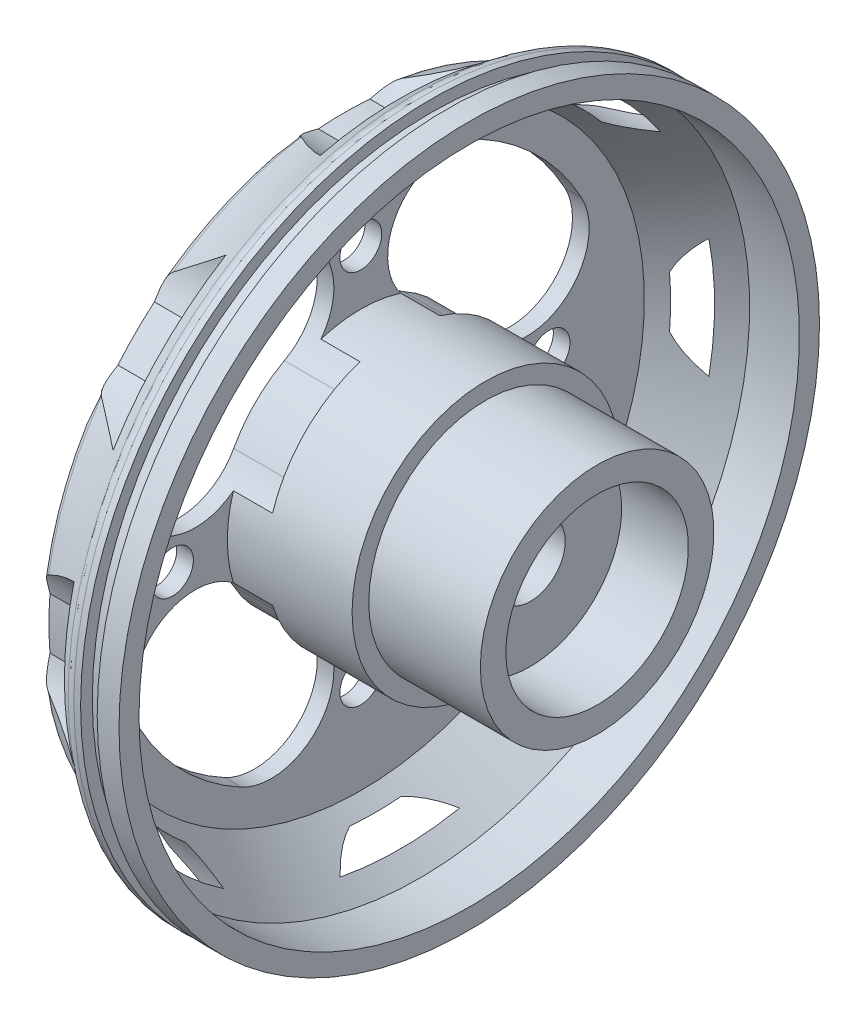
ISO-10303-21;
HEADER;
FILE_DESCRIPTION(('STEP AP214'),'2;1');
FILE_NAME('part.step','',(''),(''),'','','');
FILE_SCHEMA(('AUTOMOTIVE_DESIGN { 1 0 10303 214 1 1 1 1 }'));
ENDSEC;
DATA;
#1=APPLICATION_CONTEXT('core data for automotive mechanical design processes');
#2=APPLICATION_PROTOCOL_DEFINITION('international standard','automotive_design',2000,#1);
#3=PRODUCT_CONTEXT('',#1,'mechanical');
#4=PRODUCT('Part','Part','',(#3));
#5=PRODUCT_RELATED_PRODUCT_CATEGORY('part','',(#4));
#6=PRODUCT_DEFINITION_FORMATION('','',#4);
#7=PRODUCT_DEFINITION_CONTEXT('part definition',#1,'design');
#8=PRODUCT_DEFINITION('design','',#6,#7);
#9=PRODUCT_DEFINITION_SHAPE('','',#8);
#10=(LENGTH_UNIT() NAMED_UNIT(*) SI_UNIT(.MILLI.,.METRE.));
#11=(NAMED_UNIT(*) PLANE_ANGLE_UNIT() SI_UNIT($,.RADIAN.));
#12=(NAMED_UNIT(*) SI_UNIT($,.STERADIAN.) SOLID_ANGLE_UNIT());
#13=UNCERTAINTY_MEASURE_WITH_UNIT(LENGTH_MEASURE(1.E-05),#10,'distance_accuracy_value','');
#14=(GEOMETRIC_REPRESENTATION_CONTEXT(3) GLOBAL_UNCERTAINTY_ASSIGNED_CONTEXT((#13)) GLOBAL_UNIT_ASSIGNED_CONTEXT((#10,
#11,#12)) REPRESENTATION_CONTEXT('',''));
#15=CARTESIAN_POINT('',(0.,0.,0.));
#16=DIRECTION('',(0.,0.,1.));
#17=DIRECTION('',(1.,0.,0.));
#18=AXIS2_PLACEMENT_3D('',#15,#16,#17);
#19=CARTESIAN_POINT('',(1.,0.,0.));
#20=DIRECTION('',(1.,0.,0.));
#21=DIRECTION('',(0.,0.,-1.));
#22=AXIS2_PLACEMENT_3D('',#19,#20,#21);
#23=TOROIDAL_SURFACE('',#22,21.1656662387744,1.);
#24=CARTESIAN_POINT('',(2.18992108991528E-09,1.84954914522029,-21.0846340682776));
#25=CARTESIAN_POINT('',(7.65641810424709E-07,1.89520062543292,-21.0957928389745));
#26=CARTESIAN_POINT('',(0.000339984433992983,1.94075006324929,-21.1073645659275));
#27=CARTESIAN_POINT('',(0.00185818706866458,2.03162970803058,-21.1313294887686));
#28=CARTESIAN_POINT('',(0.00303737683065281,2.07695985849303,-21.1437228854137));
#29=CARTESIAN_POINT('',(0.00809545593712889,2.2130046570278,-21.1822448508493));
#30=CARTESIAN_POINT('',(0.0134980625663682,2.30332910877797,-21.2096065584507));
#31=CARTESIAN_POINT('',(0.0300905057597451,2.48435499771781,-21.2680430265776));
#32=CARTESIAN_POINT('',(0.0413989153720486,2.5750248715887,-21.2991834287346));
#33=CARTESIAN_POINT('',(0.0719206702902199,2.75386019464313,-21.3642888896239));
#34=CARTESIAN_POINT('',(0.0911156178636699,2.84203096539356,-21.3982472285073));
#35=CARTESIAN_POINT('',(0.125695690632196,2.96397211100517,-21.4477154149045));
#36=CARTESIAN_POINT('',(0.136718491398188,2.99933469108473,-21.462371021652));
#37=CARTESIAN_POINT('',(0.160798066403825,3.06925204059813,-21.4919420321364));
#38=CARTESIAN_POINT('',(0.173855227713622,3.10380665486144,-21.5068574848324));
#39=CARTESIAN_POINT('',(0.216365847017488,3.20579702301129,-21.5517500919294));
#40=CARTESIAN_POINT('',(0.249223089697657,3.27180094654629,-21.5819719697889));
#41=CARTESIAN_POINT('',(0.317751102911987,3.38387388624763,-21.6350574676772));
#42=CARTESIAN_POINT('',(0.351272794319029,3.43116512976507,-21.6580976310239));
#43=CARTESIAN_POINT('',(0.426113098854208,3.51998251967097,-21.7023848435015));
#44=CARTESIAN_POINT('',(0.46739866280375,3.5615318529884,-21.7236389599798));
#45=CARTESIAN_POINT('',(0.534368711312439,3.61670304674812,-21.7523753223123));
#46=CARTESIAN_POINT('',(0.556868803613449,3.63353727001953,-21.7612309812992));
#47=CARTESIAN_POINT('',(0.580315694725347,3.64928641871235,-21.7695862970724));
#48=B_SPLINE_CURVE_WITH_KNOTS('',3,(#24,#25,#26,#27,#28,#29,#30,#31,#32,#33,#34,#35,#36,#37,#38,
#39,#40,#41,#42,#43,#44,#45,#46,#47),.UNSPECIFIED.,.F.,.F.,(4,2,2,2,2,2,2,2,2,2,2,4),(0.,
0.140979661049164,0.281993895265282,0.565393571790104,0.854715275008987,1.14336584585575,
1.26281448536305,1.38228587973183,1.62042664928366,1.80701193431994,1.99282024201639,
2.08110848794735),.UNSPECIFIED.);
#49=CARTESIAN_POINT('',(0.,1.84974914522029,-21.0846829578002));
#50=VERTEX_POINT('',#49);
#51=CARTESIAN_POINT('',(0.580115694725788,3.64915202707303,-21.769515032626));
#52=VERTEX_POINT('',#51);
#53=EDGE_CURVE('E1045',#50,#52,#48,.T.);
#54=ORIENTED_EDGE('',*,*,#53,.F.);
#55=CARTESIAN_POINT('',(0.,0.,0.));
#56=DIRECTION('',(-1.,0.,0.));
#57=DIRECTION('',(0.,0.,1.));
#58=AXIS2_PLACEMENT_3D('',#55,#56,#57);
#59=CIRCLE('',#58,21.1656662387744);
#60=CARTESIAN_POINT('',(0.,13.6011521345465,-16.2170924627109));
#61=VERTEX_POINT('',#60);
#62=EDGE_CURVE('E1268',#61,#50,#59,.T.);
#63=ORIENTED_EDGE('',*,*,#62,.F.);
#64=CARTESIAN_POINT('',(0.580315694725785,12.8129869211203,-17.9738572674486));
#65=CARTESIAN_POINT('',(0.554467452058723,12.8187540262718,-17.9550650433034));
#66=CARTESIAN_POINT('',(0.529781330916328,12.8250158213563,-17.9349221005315));
#67=CARTESIAN_POINT('',(0.482739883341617,12.8384266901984,-17.892459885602));
#68=CARTESIAN_POINT('',(0.460378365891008,12.8455732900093,-17.8701467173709));
#69=CARTESIAN_POINT('',(0.397416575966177,12.8679453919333,-17.8014715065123));
#70=CARTESIAN_POINT('',(0.359941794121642,12.8843343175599,-17.7526063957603));
#71=CARTESIAN_POINT('',(0.301923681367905,12.9148050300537,-17.6649485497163));
#72=CARTESIAN_POINT('',(0.279560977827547,12.9282768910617,-17.6270938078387));
#73=CARTESIAN_POINT('',(0.238371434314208,12.956445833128,-17.5499272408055));
#74=CARTESIAN_POINT('',(0.219545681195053,12.9711432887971,-17.5106149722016));
#75=CARTESIAN_POINT('',(0.184736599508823,13.00190906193,-17.4303747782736));
#76=CARTESIAN_POINT('',(0.168808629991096,13.0179968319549,-17.3894306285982));
#77=CARTESIAN_POINT('',(0.139808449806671,13.0512190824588,-17.3069831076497));
#78=CARTESIAN_POINT('',(0.126735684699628,13.0683533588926,-17.265479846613));
#79=CARTESIAN_POINT('',(0.09024209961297,13.1227076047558,-17.1370434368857));
#80=CARTESIAN_POINT('',(0.0709610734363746,13.1615706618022,-17.0496226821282));
#81=CARTESIAN_POINT('',(0.0404134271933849,13.2431285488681,-16.87504444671));
#82=CARTESIAN_POINT('',(0.0291647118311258,13.2858317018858,-16.7878879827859));
#83=CARTESIAN_POINT('',(0.0129930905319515,13.3725312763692,-16.6190489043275));
#84=CARTESIAN_POINT('',(0.00778837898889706,13.4163630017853,-16.5373066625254));
#85=CARTESIAN_POINT('',(0.00132201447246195,13.5067689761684,-16.3757075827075));
#86=CARTESIAN_POINT('',(4.12257052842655E-05,13.5533287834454,-16.2958434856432));
#87=CARTESIAN_POINT('',(2.82813300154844E-09,13.601273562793,-16.216892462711));
#88=B_SPLINE_CURVE_WITH_KNOTS('',3,(#64,#65,#66,#67,#68,#69,#70,#71,#72,#73,#74,#75,#76,#77,#78,
#79,#80,#81,#82,#83,#84,#85,#86,#87),.UNSPECIFIED.,.F.,.F.,(4,2,2,2,2,2,2,2,2,2,2,4),(0.,
0.0972816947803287,0.19429728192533,0.384551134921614,0.522344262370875,0.660179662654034,
0.800421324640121,0.940635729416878,1.23281023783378,1.52563401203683,1.80417390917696,
2.08135327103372),.UNSPECIFIED.);
#89=CARTESIAN_POINT('',(0.580115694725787,12.8130315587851,-17.9737118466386));
#90=VERTEX_POINT('',#89);
#91=EDGE_CURVE('E843',#90,#61,#88,.T.);
#92=ORIENTED_EDGE('',*,*,#91,.F.);
#93=CARTESIAN_POINT('',(0.580115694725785,0.,0.));
#94=DIRECTION('',(-1.,0.,0.));
#95=DIRECTION('',(0.,0.,1.));
#96=AXIS2_PLACEMENT_3D('',#93,#94,#95);
#97=CIRCLE('',#96,22.0732438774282);
#98=EDGE_CURVE('E1578',#52,#90,#97,.F.);
#99=ORIENTED_EDGE('',*,*,#98,.F.);
#100=EDGE_LOOP('',(#54,#63,#92,#99));
#101=FACE_BOUND('',#100,.T.);
#102=ADVANCED_FACE('F138',(#101),#23,.T.);
#103=CARTESIAN_POINT('',(0.580315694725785,-3.64928641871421,-21.7695862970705));
#104=CARTESIAN_POINT('',(0.554467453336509,-3.63192035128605,-21.7603761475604));
#105=CARTESIAN_POINT('',(0.529781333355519,-3.61324938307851,-21.7505606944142));
#106=CARTESIAN_POINT('',(0.482739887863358,-3.57374114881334,-21.7300182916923));
#107=CARTESIAN_POINT('',(0.460378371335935,-3.55290994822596,-21.7192939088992));
#108=CARTESIAN_POINT('',(0.397416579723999,-3.48852977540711,-21.6865526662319));
#109=CARTESIAN_POINT('',(0.359941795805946,-3.44238820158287,-21.6635885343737));
#110=CARTESIAN_POINT('',(0.301923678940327,-3.35885869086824,-21.6231511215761));
#111=CARTESIAN_POINT('',(0.279560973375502,-3.3225652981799,-21.6059098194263));
#112=CARTESIAN_POINT('',(0.238371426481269,-3.24808183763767,-21.5712632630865));
#113=CARTESIAN_POINT('',(0.219545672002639,-3.20989119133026,-21.5538579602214));
#114=CARTESIAN_POINT('',(0.184736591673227,-3.1313981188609,-21.5188742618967));
#115=CARTESIAN_POINT('',(0.168808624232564,-3.09107046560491,-21.5012981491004));
#116=CARTESIAN_POINT('',(0.139808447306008,-3.00927959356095,-21.4664906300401));
#117=CARTESIAN_POINT('',(0.126735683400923,-2.96781659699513,-21.4492591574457));
#118=CARTESIAN_POINT('',(0.0902427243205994,-2.83856630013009,-21.3968760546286));
#119=CARTESIAN_POINT('',(0.0709620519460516,-2.74927247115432,-21.3625414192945));
#120=CARTESIAN_POINT('',(0.0404147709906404,-2.56816160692,-21.2967676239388));
#121=CARTESIAN_POINT('',(0.0291660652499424,-2.47633940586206,-21.2653350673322));
#122=CARTESIAN_POINT('',(0.0129942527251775,-2.29565091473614,-21.207254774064));
#123=CARTESIAN_POINT('',(0.00778935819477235,-2.20685891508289,-21.1804484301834));
#124=CARTESIAN_POINT('',(0.00132254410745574,-2.02866883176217,-21.1301080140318));
#125=CARTESIAN_POINT('',(4.14901980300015E-05,-1.93927582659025,-21.1065585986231));
#126=CARTESIAN_POINT('',(2.18992099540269E-09,-1.84954914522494,-21.0846340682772));
#127=B_SPLINE_CURVE_WITH_KNOTS('',3,(#103,#104,#105,#106,#107,#108,#109,#110,#111,#112,#113,
#114,#115,#116,#117,#118,#119,#120,#121,#122,#123,#124,#125,#126),.UNSPECIFIED.,.F.,.F.,(4,2,2,
2,2,2,2,2,2,2,2,4),(0.,0.0972816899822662,0.194297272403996,0.384551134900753,0.522344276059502,
0.660179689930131,0.800421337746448,0.940635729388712,1.2328028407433,1.52561916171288,
1.80415239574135,2.08132520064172),.UNSPECIFIED.);
#128=CARTESIAN_POINT('',(0.580115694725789,-3.64915202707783,-21.7695150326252));
#129=VERTEX_POINT('',#128);
#130=CARTESIAN_POINT('',(0.,-1.84974914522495,-21.0846829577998));
#131=VERTEX_POINT('',#130);
#132=EDGE_CURVE('E1036',#129,#131,#127,.T.);
#133=ORIENTED_EDGE('',*,*,#132,.F.);
#134=CARTESIAN_POINT('',(0.580115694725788,-12.8130315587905,-17.9737118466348));
#135=VERTEX_POINT('',#134);
#136=EDGE_CURVE('E1782',#135,#129,#97,.F.);
#137=ORIENTED_EDGE('',*,*,#136,.F.);
#138=CARTESIAN_POINT('',(2.82813319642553E-09,-13.6012735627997,-16.2168924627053));
#139=CARTESIAN_POINT('',(6.29912585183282E-07,-13.5768832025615,-16.2570635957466));
#140=CARTESIAN_POINT('',(0.000339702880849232,-13.5528570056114,-16.2974545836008));
#141=CARTESIAN_POINT('',(0.00185759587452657,-13.5055405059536,-16.3786624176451));
#142=CARTESIAN_POINT('',(0.00303662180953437,-13.482250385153,-16.4194793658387));
#143=CARTESIAN_POINT('',(0.00809418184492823,-13.4132903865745,-16.5429174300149));
#144=CARTESIAN_POINT('',(0.0134964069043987,-13.3687683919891,-16.626134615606));
#145=CARTESIAN_POINT('',(0.0300880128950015,-13.2820833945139,-16.7954611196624));
#146=CARTESIAN_POINT('',(0.0413959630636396,-13.2399891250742,-16.8815945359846));
#147=CARTESIAN_POINT('',(0.0719167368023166,-13.1595688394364,-17.0540878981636));
#148=CARTESIAN_POINT('',(0.0911111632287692,-13.1212343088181,-17.1404468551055));
#149=CARTESIAN_POINT('',(0.125690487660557,-13.0699873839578,-17.2616526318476));
#150=CARTESIAN_POINT('',(0.136713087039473,-13.0553450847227,-17.2970212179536));
#151=CARTESIAN_POINT('',(0.160792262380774,-13.0268154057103,-17.3673709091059));
#152=CARTESIAN_POINT('',(0.173849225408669,-13.0129281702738,-17.402351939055));
#153=CARTESIAN_POINT('',(0.216359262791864,-12.9725532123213,-17.5062151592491));
#154=CARTESIAN_POINT('',(0.249216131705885,-12.9472510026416,-17.5742579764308));
#155=CARTESIAN_POINT('',(0.317743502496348,-12.9055397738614,-17.6910442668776));
#156=CARTESIAN_POINT('',(0.351264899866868,-12.8883913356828,-17.7407768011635));
#157=CARTESIAN_POINT('',(0.426104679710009,-12.8569030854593,-17.834897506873));
#158=CARTESIAN_POINT('',(0.467390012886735,-12.8425518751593,-17.8793070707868));
#159=CARTESIAN_POINT('',(0.534362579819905,-12.8238583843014,-17.9386423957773));
#160=CARTESIAN_POINT('',(0.556865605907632,-12.8182158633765,-17.9568105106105));
#161=CARTESIAN_POINT('',(0.580315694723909,-12.8129869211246,-17.9738572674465));
#162=B_SPLINE_CURVE_WITH_KNOTS('',3,(#138,#139,#140,#141,#142,#143,#144,#145,#146,#147,#148,
#149,#150,#151,#152,#153,#154,#155,#156,#157,#158,#159,#160,#161),.UNSPECIFIED.,.F.,.F.,(4,2,2,
2,2,2,2,2,2,2,2,4),(0.,0.140980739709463,0.281996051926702,0.565397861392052,0.854721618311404,
1.14337425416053,1.26282404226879,1.38229658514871,1.62043966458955,1.80702647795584,
1.99283631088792,2.08113656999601),.UNSPECIFIED.);
#163=CARTESIAN_POINT('',(0.,-13.6011521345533,-16.2170924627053));
#164=VERTEX_POINT('',#163);
#165=EDGE_CURVE('E1758',#164,#135,#162,.T.);
#166=ORIENTED_EDGE('',*,*,#165,.F.);
#167=EDGE_CURVE('E1264',#131,#164,#59,.T.);
#168=ORIENTED_EDGE('',*,*,#167,.F.);
#169=EDGE_LOOP('',(#133,#137,#166,#168));
#170=FACE_BOUND('',#169,.T.);
#171=ADVANCED_FACE('F1531',(#170),#23,.T.);
#172=CARTESIAN_POINT('',(0.580315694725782,-17.9738572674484,-12.8129869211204));
#173=CARTESIAN_POINT('',(0.554467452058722,-17.9550650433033,-12.818754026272));
#174=CARTESIAN_POINT('',(0.529781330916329,-17.9349221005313,-12.8250158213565));
#175=CARTESIAN_POINT('',(0.482739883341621,-17.8924598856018,-12.8384266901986));
#176=CARTESIAN_POINT('',(0.460378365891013,-17.8701467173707,-12.8455732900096));
#177=CARTESIAN_POINT('',(0.397416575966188,-17.8014715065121,-12.8679453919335));
#178=CARTESIAN_POINT('',(0.359941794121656,-17.7526063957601,-12.8843343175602));
#179=CARTESIAN_POINT('',(0.30192368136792,-17.664948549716,-12.9148050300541));
#180=CARTESIAN_POINT('',(0.279560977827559,-17.6270938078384,-12.9282768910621));
#181=CARTESIAN_POINT('',(0.238371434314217,-17.5499272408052,-12.9564458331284));
#182=CARTESIAN_POINT('',(0.219545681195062,-17.5106149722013,-12.9711432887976));
#183=CARTESIAN_POINT('',(0.184736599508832,-17.4303747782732,-13.0019090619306));
#184=CARTESIAN_POINT('',(0.168808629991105,-17.3894306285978,-13.0179968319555));
#185=CARTESIAN_POINT('',(0.139808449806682,-17.3069831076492,-13.0512190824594));
#186=CARTESIAN_POINT('',(0.12673568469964,-17.2654798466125,-13.0683533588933));
#187=CARTESIAN_POINT('',(0.0902420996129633,-17.1370434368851,-13.1227076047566));
#188=CARTESIAN_POINT('',(0.0709610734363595,-17.0496226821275,-13.1615706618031));
#189=CARTESIAN_POINT('',(0.0404134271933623,-16.875044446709,-13.2431285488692));
#190=CARTESIAN_POINT('',(0.0291647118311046,-16.7878879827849,-13.285831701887));
#191=CARTESIAN_POINT('',(0.012993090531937,-16.6190489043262,-13.3725312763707));
#192=CARTESIAN_POINT('',(0.00778837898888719,-16.537306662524,-13.4163630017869));
#193=CARTESIAN_POINT('',(0.00132201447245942,-16.3757075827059,-13.5067689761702));
#194=CARTESIAN_POINT('',(4.12257052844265E-05,-16.2958434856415,-13.5533287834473));
#195=CARTESIAN_POINT('',(2.8281328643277E-09,-16.2168924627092,-13.601273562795));
#196=B_SPLINE_CURVE_WITH_KNOTS('',3,(#172,#173,#174,#175,#176,#177,#178,#179,#180,#181,#182,
#183,#184,#185,#186,#187,#188,#189,#190,#191,#192,#193,#194,#195),.UNSPECIFIED.,.F.,.F.,(4,2,2,
2,2,2,2,2,2,2,2,4),(0.,0.0972816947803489,0.194297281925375,0.384551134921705,0.522344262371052,
0.660179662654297,0.800421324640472,0.940635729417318,1.23281023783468,1.5256340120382,
1.80417390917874,2.08135327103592),.UNSPECIFIED.);
#197=CARTESIAN_POINT('',(0.580115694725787,-17.9737118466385,-12.8130315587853));
#198=VERTEX_POINT('',#197);
#199=CARTESIAN_POINT('',(0.,-16.2170924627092,-13.6011521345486));
#200=VERTEX_POINT('',#199);
#201=EDGE_CURVE('E1750',#198,#200,#196,.T.);
#202=ORIENTED_EDGE('',*,*,#201,.F.);
#203=CARTESIAN_POINT('',(0.58011569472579,-21.7695150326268,-3.64915202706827));
#204=VERTEX_POINT('',#203);
#205=EDGE_CURVE('E1729',#204,#198,#97,.F.);
#206=ORIENTED_EDGE('',*,*,#205,.F.);
#207=CARTESIAN_POINT('',(2.18992098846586E-09,-21.0846340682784,-1.84954914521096));
#208=CARTESIAN_POINT('',(7.65641810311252E-07,-21.0957928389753,-1.89520062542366));
#209=CARTESIAN_POINT('',(0.000339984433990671,-21.1073645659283,-1.94075006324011));
#210=CARTESIAN_POINT('',(0.00185818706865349,-21.1313294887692,-2.03162970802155));
#211=CARTESIAN_POINT('',(0.00303737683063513,-21.1437228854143,-2.07695985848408));
#212=CARTESIAN_POINT('',(0.00809545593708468,-21.1822448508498,-2.21300465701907));
#213=CARTESIAN_POINT('',(0.0134980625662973,-21.2096065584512,-2.30332910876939));
#214=CARTESIAN_POINT('',(0.0300905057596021,-21.268043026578,-2.48435499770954));
#215=CARTESIAN_POINT('',(0.0413989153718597,-21.299183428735,-2.57502487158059));
#216=CARTESIAN_POINT('',(0.0719206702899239,-21.3642888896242,-2.75386019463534));
#217=CARTESIAN_POINT('',(0.0911156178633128,-21.3982472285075,-2.84203096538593));
#218=CARTESIAN_POINT('',(0.125695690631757,-21.4477154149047,-2.96397211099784));
#219=CARTESIAN_POINT('',(0.136718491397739,-21.4623710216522,-2.99933469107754));
#220=CARTESIAN_POINT('',(0.160798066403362,-21.4919420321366,-3.0692520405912));
#221=CARTESIAN_POINT('',(0.173855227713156,-21.5068574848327,-3.10380665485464));
#222=CARTESIAN_POINT('',(0.216365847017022,-21.5517500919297,-3.20579702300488));
#223=CARTESIAN_POINT('',(0.249223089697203,-21.5819719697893,-3.27180094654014));
#224=CARTESIAN_POINT('',(0.317751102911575,-21.6350574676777,-3.38387388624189));
#225=CARTESIAN_POINT('',(0.351272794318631,-21.6580976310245,-3.43116512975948));
#226=CARTESIAN_POINT('',(0.426113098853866,-21.7023848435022,-3.51998251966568));
#227=CARTESIAN_POINT('',(0.467398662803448,-21.7236389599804,-3.56153185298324));
#228=CARTESIAN_POINT('',(0.53436871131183,-21.7523753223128,-3.61670304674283));
#229=CARTESIAN_POINT('',(0.556868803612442,-21.7612309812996,-3.633537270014));
#230=CARTESIAN_POINT('',(0.580315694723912,-21.7695862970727,-3.64928641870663));
#231=B_SPLINE_CURVE_WITH_KNOTS('',3,(#207,#208,#209,#210,#211,#212,#213,#214,#215,#216,#217,
#218,#219,#220,#221,#222,#223,#224,#225,#226,#227,#228,#229,#230),.UNSPECIFIED.,.F.,.F.,(4,2,2,
2,2,2,2,2,2,2,2,4),(0.,0.140979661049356,0.281993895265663,0.565393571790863,0.854715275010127,
1.14336584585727,1.26281448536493,1.38228587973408,1.62042664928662,1.80701193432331,
1.99282024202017,2.08110848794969),.UNSPECIFIED.);
#232=CARTESIAN_POINT('',(0.,-21.084682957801,-1.84974914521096));
#233=VERTEX_POINT('',#232);
#234=EDGE_CURVE('E1813',#233,#204,#231,.T.);
#235=ORIENTED_EDGE('',*,*,#234,.F.);
#236=EDGE_CURVE('E1260',#200,#233,#59,.T.);
#237=ORIENTED_EDGE('',*,*,#236,.F.);
#238=EDGE_LOOP('',(#202,#206,#235,#237));
#239=FACE_BOUND('',#238,.T.);
#240=ADVANCED_FACE('F1536',(#239),#23,.T.);
#241=CARTESIAN_POINT('',(0.580315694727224,-21.7695862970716,3.64928641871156));
#242=CARTESIAN_POINT('',(0.554467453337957,-21.7603761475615,3.63192035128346));
#243=CARTESIAN_POINT('',(0.529781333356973,-21.7505606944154,3.61324938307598));
#244=CARTESIAN_POINT('',(0.482739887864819,-21.7300182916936,3.57374114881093));
#245=CARTESIAN_POINT('',(0.460378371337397,-21.7192939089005,3.55290994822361));
#246=CARTESIAN_POINT('',(0.397416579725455,-21.6865526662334,3.48852977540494));
#247=CARTESIAN_POINT('',(0.359941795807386,-21.6635885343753,3.44238820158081));
#248=CARTESIAN_POINT('',(0.301923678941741,-21.6231511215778,3.3588586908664));
#249=CARTESIAN_POINT('',(0.279560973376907,-21.605909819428,3.32256529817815));
#250=CARTESIAN_POINT('',(0.238371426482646,-21.5712632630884,3.24808183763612));
#251=CARTESIAN_POINT('',(0.219545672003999,-21.5538579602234,3.2098911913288));
#252=CARTESIAN_POINT('',(0.184736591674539,-21.5188742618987,3.13139811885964));
#253=CARTESIAN_POINT('',(0.168808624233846,-21.5012981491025,3.09107046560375));
#254=CARTESIAN_POINT('',(0.139808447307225,-21.4664906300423,3.00927959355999));
#255=CARTESIAN_POINT('',(0.126735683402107,-21.4492591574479,2.96781659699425));
#256=CARTESIAN_POINT('',(0.0902427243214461,-21.3968760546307,2.83856630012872));
#257=CARTESIAN_POINT('',(0.0709620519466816,-21.3625414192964,2.74927247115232));
#258=CARTESIAN_POINT('',(0.0404147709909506,-21.2967676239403,2.56816160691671));
#259=CARTESIAN_POINT('',(0.0291660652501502,-21.2653350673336,2.4763394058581));
#260=CARTESIAN_POINT('',(0.0129942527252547,-21.2072547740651,2.29565091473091));
#261=CARTESIAN_POINT('',(0.00778935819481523,-21.1804484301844,2.20685891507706));
#262=CARTESIAN_POINT('',(0.00132254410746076,-21.1301080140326,2.02866883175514));
#263=CARTESIAN_POINT('',(4.1490198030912E-05,-21.1065585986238,1.93927582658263));
#264=CARTESIAN_POINT('',(2.18992085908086E-09,-21.0846340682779,1.84954914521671));
#265=B_SPLINE_CURVE_WITH_KNOTS('',3,(#241,#242,#243,#244,#245,#246,#247,#248,#249,#250,#251,
#252,#253,#254,#255,#256,#257,#258,#259,#260,#261,#262,#263,#264),.UNSPECIFIED.,.F.,.F.,(4,2,2,
2,2,2,2,2,2,2,2,4),(0.,0.0972816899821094,0.194297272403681,0.38455113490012,0.522344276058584,
0.660179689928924,0.800421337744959,0.94063572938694,1.23280284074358,1.52561916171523,
1.80415239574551,2.08132520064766),.UNSPECIFIED.);
#266=CARTESIAN_POINT('',(0.580115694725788,-21.7695150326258,3.64915202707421));
#267=VERTEX_POINT('',#266);
#268=CARTESIAN_POINT('',(0.,-21.0846829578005,1.8497491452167));
#269=VERTEX_POINT('',#268);
#270=EDGE_CURVE('E1815',#267,#269,#265,.T.);
#271=ORIENTED_EDGE('',*,*,#270,.F.);
#272=CARTESIAN_POINT('',(0.58011569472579,-17.9737118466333,12.8130315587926));
#273=VERTEX_POINT('',#272);
#274=EDGE_CURVE('E1235',#273,#267,#97,.F.);
#275=ORIENTED_EDGE('',*,*,#274,.F.);
#276=CARTESIAN_POINT('',(2.82813320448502E-09,-16.216892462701,13.6012735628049));
#277=CARTESIAN_POINT('',(6.29912585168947E-07,-16.2570635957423,13.5768832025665));
#278=CARTESIAN_POINT('',(0.000339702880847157,-16.2974545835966,13.5528570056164));
#279=CARTESIAN_POINT('',(0.00185759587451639,-16.3786624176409,13.5055405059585));
#280=CARTESIAN_POINT('',(0.00303662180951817,-16.4194793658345,13.4822503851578));
#281=CARTESIAN_POINT('',(0.00809418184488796,-16.5429174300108,13.4132903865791));
#282=CARTESIAN_POINT('',(0.0134964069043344,-16.626134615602,13.3687683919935));
#283=CARTESIAN_POINT('',(0.0300880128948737,-16.7954611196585,13.282083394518));
#284=CARTESIAN_POINT('',(0.0413959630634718,-16.8815945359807,13.2399891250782));
#285=CARTESIAN_POINT('',(0.0719167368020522,-17.0540878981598,13.1595688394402));
#286=CARTESIAN_POINT('',(0.0911111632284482,-17.1404468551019,13.1212343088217));
#287=CARTESIAN_POINT('',(0.125690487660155,-17.2616526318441,13.0699873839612));
#288=CARTESIAN_POINT('',(0.136713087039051,-17.2970212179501,13.0553450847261));
#289=CARTESIAN_POINT('',(0.160792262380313,-17.3673709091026,13.0268154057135));
#290=CARTESIAN_POINT('',(0.173849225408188,-17.4023519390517,13.012928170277));
#291=CARTESIAN_POINT('',(0.216359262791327,-17.506215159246,12.9725532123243));
#292=CARTESIAN_POINT('',(0.249216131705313,-17.5742579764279,12.9472510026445));
#293=CARTESIAN_POINT('',(0.317743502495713,-17.6910442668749,12.9055397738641));
#294=CARTESIAN_POINT('',(0.351264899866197,-17.7407768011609,12.8883913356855));
#295=CARTESIAN_POINT('',(0.426104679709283,-17.8348975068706,12.8569030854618));
#296=CARTESIAN_POINT('',(0.467390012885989,-17.8793070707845,12.8425518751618));
#297=CARTESIAN_POINT('',(0.534362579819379,-17.9386423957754,12.8238583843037));
#298=CARTESIAN_POINT('',(0.556865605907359,-17.9568105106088,12.8182158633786));
#299=CARTESIAN_POINT('',(0.580315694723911,-17.973857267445,12.8129869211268));
#300=B_SPLINE_CURVE_WITH_KNOTS('',3,(#276,#277,#278,#279,#280,#281,#282,#283,#284,#285,#286,
#287,#288,#289,#290,#291,#292,#293,#294,#295,#296,#297,#298,#299),.UNSPECIFIED.,.F.,.F.,(4,2,2,
2,2,2,2,2,2,2,2,4),(0.,0.140980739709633,0.281996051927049,0.56539786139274,0.854721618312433,
1.1433742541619,1.26282404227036,1.38229658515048,1.62043966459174,1.80702647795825,
1.99283631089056,2.08113656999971),.UNSPECIFIED.);
#301=CARTESIAN_POINT('',(0.,-16.217092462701,13.6011521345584));
#302=VERTEX_POINT('',#301);
#303=EDGE_CURVE('E1820',#302,#273,#300,.T.);
#304=ORIENTED_EDGE('',*,*,#303,.F.);
#305=EDGE_CURVE('E1256',#269,#302,#59,.T.);
#306=ORIENTED_EDGE('',*,*,#305,.F.);
#307=EDGE_LOOP('',(#271,#275,#304,#306));
#308=FACE_BOUND('',#307,.T.);
#309=ADVANCED_FACE('F2056',(#308),#23,.T.);
#310=CARTESIAN_POINT('',(0.580315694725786,-12.8129869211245,17.9738572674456));
#311=CARTESIAN_POINT('',(0.554467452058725,-12.818754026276,17.9550650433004));
#312=CARTESIAN_POINT('',(0.529781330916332,-12.8250158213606,17.9349221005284));
#313=CARTESIAN_POINT('',(0.482739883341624,-12.8384266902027,17.8924598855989));
#314=CARTESIAN_POINT('',(0.460378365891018,-12.8455732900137,17.8701467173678));
#315=CARTESIAN_POINT('',(0.397416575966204,-12.8679453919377,17.8014715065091));
#316=CARTESIAN_POINT('',(0.359941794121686,-12.8843343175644,17.7526063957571));
#317=CARTESIAN_POINT('',(0.301923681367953,-12.9148050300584,17.6649485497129));
#318=CARTESIAN_POINT('',(0.279560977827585,-12.9282768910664,17.6270938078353));
#319=CARTESIAN_POINT('',(0.238371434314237,-12.9564458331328,17.549927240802));
#320=CARTESIAN_POINT('',(0.219545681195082,-12.9711432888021,17.510614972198));
#321=CARTESIAN_POINT('',(0.184736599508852,-13.0019090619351,17.4303747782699));
#322=CARTESIAN_POINT('',(0.168808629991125,-13.01799683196,17.3894306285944));
#323=CARTESIAN_POINT('',(0.139808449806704,-13.0512190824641,17.3069831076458));
#324=CARTESIAN_POINT('',(0.126735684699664,-13.068353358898,17.265479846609));
#325=CARTESIAN_POINT('',(0.0902420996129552,-13.1227076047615,17.1370434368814));
#326=CARTESIAN_POINT('',(0.0709610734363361,-13.1615706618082,17.0496226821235));
#327=CARTESIAN_POINT('',(0.0404134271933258,-13.2431285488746,16.8750444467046));
#328=CARTESIAN_POINT('',(0.02916471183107,-13.2858317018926,16.7878879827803));
#329=CARTESIAN_POINT('',(0.0129930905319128,-13.3725312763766,16.6190489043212));
#330=CARTESIAN_POINT('',(0.00778837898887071,-13.416363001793,16.5373066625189));
#331=CARTESIAN_POINT('',(0.00132201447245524,-13.5067689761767,16.3757075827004));
#332=CARTESIAN_POINT('',(4.12257052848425E-05,-13.553328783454,16.2958434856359));
#333=CARTESIAN_POINT('',(2.82813286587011E-09,-13.6012735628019,16.2168924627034));
#334=B_SPLINE_CURVE_WITH_KNOTS('',3,(#310,#311,#312,#313,#314,#315,#316,#317,#318,#319,#320,
#321,#322,#323,#324,#325,#326,#327,#328,#329,#330,#331,#332,#333),.UNSPECIFIED.,.F.,.F.,(4,2,2,
2,2,2,2,2,2,2,2,4),(0.,0.0972816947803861,0.194297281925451,0.38455113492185,0.522344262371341,
0.660179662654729,0.800421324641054,0.940635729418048,1.2328102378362,1.52563401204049,
1.80417390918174,2.08135327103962),.UNSPECIFIED.);
#335=CARTESIAN_POINT('',(0.580115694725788,-12.8130315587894,17.9737118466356));
#336=VERTEX_POINT('',#335);
#337=CARTESIAN_POINT('',(0.,-13.6011521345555,16.2170924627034));
#338=VERTEX_POINT('',#337);
#339=EDGE_CURVE('E1597',#336,#338,#334,.T.);
#340=ORIENTED_EDGE('',*,*,#339,.F.);
#341=CARTESIAN_POINT('',(0.580115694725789,-3.64915202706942,21.7695150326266));
#342=VERTEX_POINT('',#341);
#343=EDGE_CURVE('E1230',#342,#336,#97,.F.);
#344=ORIENTED_EDGE('',*,*,#343,.F.);
#345=CARTESIAN_POINT('',(2.18992116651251E-09,-1.84954914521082,21.0846340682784));
#346=CARTESIAN_POINT('',(7.65641810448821E-07,-1.89520062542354,21.0957928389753));
#347=CARTESIAN_POINT('',(0.000339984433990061,-1.94075006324,21.1073645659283));
#348=CARTESIAN_POINT('',(0.00185818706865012,-2.03162970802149,21.1313294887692));
#349=CARTESIAN_POINT('',(0.00303737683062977,-2.07695985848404,21.1437228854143));
#350=CARTESIAN_POINT('',(0.00809545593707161,-2.21300465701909,21.1822448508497));
#351=CARTESIAN_POINT('',(0.0134980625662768,-2.30332910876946,21.209606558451));
#352=CARTESIAN_POINT('',(0.0300905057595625,-2.48435499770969,21.2680430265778));
#353=CARTESIAN_POINT('',(0.0413989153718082,-2.57502487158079,21.2991834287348));
#354=CARTESIAN_POINT('',(0.0719206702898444,-2.75386019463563,21.364288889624));
#355=CARTESIAN_POINT('',(0.0911156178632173,-2.84203096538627,21.3982472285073));
#356=CARTESIAN_POINT('',(0.125695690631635,-2.96397211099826,21.4477154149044));
#357=CARTESIAN_POINT('',(0.136718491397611,-2.99933469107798,21.462371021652));
#358=CARTESIAN_POINT('',(0.160798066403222,-3.06925204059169,21.4919420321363));
#359=CARTESIAN_POINT('',(0.173855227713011,-3.10380665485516,21.5068574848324));
#360=CARTESIAN_POINT('',(0.216365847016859,-3.20579702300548,21.5517500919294));
#361=CARTESIAN_POINT('',(0.249223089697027,-3.27180094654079,21.581971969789));
#362=CARTESIAN_POINT('',(0.317751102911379,-3.38387388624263,21.6350574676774));
#363=CARTESIAN_POINT('',(0.351272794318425,-3.43116512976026,21.6580976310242));
#364=CARTESIAN_POINT('',(0.426113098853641,-3.51998251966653,21.7023848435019));
#365=CARTESIAN_POINT('',(0.467398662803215,-3.56153185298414,21.7236389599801));
#366=CARTESIAN_POINT('',(0.534368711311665,-3.61670304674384,21.7523753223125));
#367=CARTESIAN_POINT('',(0.556868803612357,-3.63353727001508,21.7612309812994));
#368=CARTESIAN_POINT('',(0.580315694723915,-3.64928641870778,21.7695862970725));
#369=B_SPLINE_CURVE_WITH_KNOTS('',3,(#345,#346,#347,#348,#349,#350,#351,#352,#353,#354,#355,
#356,#357,#358,#359,#360,#361,#362,#363,#364,#365,#366,#367,#368),.UNSPECIFIED.,.F.,.F.,(4,2,2,
2,2,2,2,2,2,2,2,4),(0.,0.140979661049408,0.281993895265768,0.565393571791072,0.854715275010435,
1.14336584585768,1.2628144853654,1.3822858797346,1.62042664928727,1.80701193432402,
1.99282024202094,2.0811084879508),.UNSPECIFIED.);
#370=CARTESIAN_POINT('',(0.,-1.84974914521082,21.0846829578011));
#371=VERTEX_POINT('',#370);
#372=EDGE_CURVE('E1593',#371,#342,#369,.T.);
#373=ORIENTED_EDGE('',*,*,#372,.F.);
#374=EDGE_CURVE('E1242',#338,#371,#59,.T.);
#375=ORIENTED_EDGE('',*,*,#374,.F.);
#376=EDGE_LOOP('',(#340,#344,#373,#375));
#377=FACE_BOUND('',#376,.T.);
#378=ADVANCED_FACE('F1559',(#377),#23,.T.);
#379=CARTESIAN_POINT('',(0.580315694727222,3.64928641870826,21.7695862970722));
#380=CARTESIAN_POINT('',(0.554467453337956,3.63192035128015,21.7603761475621));
#381=CARTESIAN_POINT('',(0.529781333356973,3.61324938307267,21.7505606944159));
#382=CARTESIAN_POINT('',(0.482739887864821,3.5737411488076,21.7300182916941));
#383=CARTESIAN_POINT('',(0.460378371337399,3.55290994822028,21.7192939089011));
#384=CARTESIAN_POINT('',(0.397416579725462,3.48852977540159,21.6865526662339));
#385=CARTESIAN_POINT('',(0.359941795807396,3.44238820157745,21.6635885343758));
#386=CARTESIAN_POINT('',(0.301923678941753,3.35885869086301,21.6231511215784));
#387=CARTESIAN_POINT('',(0.279560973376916,3.32256529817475,21.6059098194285));
#388=CARTESIAN_POINT('',(0.238371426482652,3.24808183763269,21.5712632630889));
#389=CARTESIAN_POINT('',(0.219545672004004,3.20989119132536,21.5538579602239));
#390=CARTESIAN_POINT('',(0.184736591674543,3.13139811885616,21.5188742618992));
#391=CARTESIAN_POINT('',(0.16880862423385,3.09107046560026,21.501298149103));
#392=CARTESIAN_POINT('',(0.139808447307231,3.00927959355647,21.4664906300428));
#393=CARTESIAN_POINT('',(0.126735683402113,2.96781659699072,21.4492591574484));
#394=CARTESIAN_POINT('',(0.0902427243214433,2.8385663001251,21.3968760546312));
#395=CARTESIAN_POINT('',(0.0709620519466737,2.74927247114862,21.3625414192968));
#396=CARTESIAN_POINT('',(0.0404147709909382,2.56816160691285,21.2967676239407));
#397=CARTESIAN_POINT('',(0.0291660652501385,2.47633940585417,21.265335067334));
#398=CARTESIAN_POINT('',(0.0129942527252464,2.29565091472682,21.2072547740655));
#399=CARTESIAN_POINT('',(0.00778935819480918,2.2068589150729,21.1804484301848));
#400=CARTESIAN_POINT('',(0.00132254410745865,2.02866883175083,21.130108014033));
#401=CARTESIAN_POINT('',(4.14901980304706E-05,1.93927582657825,21.1065585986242));
#402=CARTESIAN_POINT('',(2.18992102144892E-09,1.84954914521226,21.0846340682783));
#403=B_SPLINE_CURVE_WITH_KNOTS('',3,(#379,#380,#381,#382,#383,#384,#385,#386,#387,#388,#389,
#390,#391,#392,#393,#394,#395,#396,#397,#398,#399,#400,#401,#402),.UNSPECIFIED.,.F.,.F.,(4,2,2,
2,2,2,2,2,2,2,2,4),(0.,0.0972816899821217,0.194297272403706,0.384551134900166,0.522344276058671,
0.660179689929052,0.800421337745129,0.940635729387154,1.23280284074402,1.52561916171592,
1.80415239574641,2.08132520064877),.UNSPECIFIED.);
#404=CARTESIAN_POINT('',(0.580115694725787,3.64915202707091,21.7695150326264));
#405=VERTEX_POINT('',#404);
#406=CARTESIAN_POINT('',(0.,1.84974914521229,21.0846829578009));
#407=VERTEX_POINT('',#406);
#408=EDGE_CURVE('E1589',#405,#407,#403,.T.);
#409=ORIENTED_EDGE('',*,*,#408,.F.);
#410=CARTESIAN_POINT('',(0.580115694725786,12.8130315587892,17.9737118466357));
#411=VERTEX_POINT('',#410);
#412=EDGE_CURVE('E1229',#411,#405,#97,.F.);
#413=ORIENTED_EDGE('',*,*,#412,.F.);
#414=CARTESIAN_POINT('',(2.82813305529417E-09,13.6012735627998,16.2168924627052));
#415=CARTESIAN_POINT('',(6.29912585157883E-07,13.5768832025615,16.2570635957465));
#416=CARTESIAN_POINT('',(0.000339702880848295,13.5528570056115,16.2974545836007));
#417=CARTESIAN_POINT('',(0.00185759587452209,13.5055405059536,16.378662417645));
#418=CARTESIAN_POINT('',(0.00303662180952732,13.4822503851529,16.4194793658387));
#419=CARTESIAN_POINT('',(0.00809418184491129,13.4132903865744,16.5429174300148));
#420=CARTESIAN_POINT('',(0.0134964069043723,13.3687683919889,16.626134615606));
#421=CARTESIAN_POINT('',(0.030088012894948,13.2820833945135,16.7954611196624));
#422=CARTESIAN_POINT('',(0.041395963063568,13.2399891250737,16.8815945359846));
#423=CARTESIAN_POINT('',(0.071916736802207,13.1595688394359,17.0540878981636));
#424=CARTESIAN_POINT('',(0.0911111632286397,13.1212343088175,17.1404468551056));
#425=CARTESIAN_POINT('',(0.125690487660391,13.0699873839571,17.2616526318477));
#426=CARTESIAN_POINT('',(0.136713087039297,13.055345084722,17.2970212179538));
#427=CARTESIAN_POINT('',(0.160792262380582,13.0268154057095,17.3673709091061));
#428=CARTESIAN_POINT('',(0.173849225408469,13.012928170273,17.4023519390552));
#429=CARTESIAN_POINT('',(0.216359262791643,12.9725532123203,17.5062151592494));
#430=CARTESIAN_POINT('',(0.24921613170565,12.9472510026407,17.5742579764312));
#431=CARTESIAN_POINT('',(0.317743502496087,12.9055397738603,17.691044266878));
#432=CARTESIAN_POINT('',(0.351264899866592,12.8883913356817,17.740776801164));
#433=CARTESIAN_POINT('',(0.42610467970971,12.8569030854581,17.8348975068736));
#434=CARTESIAN_POINT('',(0.467390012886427,12.8425518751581,17.8793070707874));
#435=CARTESIAN_POINT('',(0.534362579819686,12.8238583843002,17.9386423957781));
#436=CARTESIAN_POINT('',(0.556865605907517,12.8182158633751,17.9568105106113));
#437=CARTESIAN_POINT('',(0.580315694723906,12.8129869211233,17.9738572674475));
#438=B_SPLINE_CURVE_WITH_KNOTS('',3,(#414,#415,#416,#417,#418,#419,#420,#421,#422,#423,#424,
#425,#426,#427,#428,#429,#430,#431,#432,#433,#434,#435,#436,#437),.UNSPECIFIED.,.F.,.F.,(4,2,2,
2,2,2,2,2,2,2,2,4),(0.,0.14098073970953,0.281996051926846,0.565397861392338,0.854721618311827,
1.1433742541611,1.26282404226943,1.38229658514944,1.62043966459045,1.80702647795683,
1.99283631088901,2.08113656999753),.UNSPECIFIED.);
#439=CARTESIAN_POINT('',(0.,13.6011521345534,16.2170924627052));
#440=VERTEX_POINT('',#439);
#441=EDGE_CURVE('E1571',#440,#411,#438,.T.);
#442=ORIENTED_EDGE('',*,*,#441,.F.);
#443=EDGE_CURVE('E1243',#407,#440,#59,.T.);
#444=ORIENTED_EDGE('',*,*,#443,.F.);
#445=EDGE_LOOP('',(#409,#413,#442,#444));
#446=FACE_BOUND('',#445,.T.);
#447=ADVANCED_FACE('F1550',(#446),#23,.T.);
#448=CARTESIAN_POINT('',(0.580315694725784,17.9738572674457,12.8129869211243));
#449=CARTESIAN_POINT('',(0.554467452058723,17.9550650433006,12.8187540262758));
#450=CARTESIAN_POINT('',(0.529781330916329,17.9349221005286,12.8250158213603));
#451=CARTESIAN_POINT('',(0.48273988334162,17.892459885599,12.8384266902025));
#452=CARTESIAN_POINT('',(0.460378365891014,17.8701467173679,12.8455732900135));
#453=CARTESIAN_POINT('',(0.397416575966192,17.8014715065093,12.8679453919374));
#454=CARTESIAN_POINT('',(0.359941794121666,17.7526063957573,12.8843343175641));
#455=CARTESIAN_POINT('',(0.301923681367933,17.6649485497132,12.914805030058));
#456=CARTESIAN_POINT('',(0.279560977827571,17.6270938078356,12.928276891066));
#457=CARTESIAN_POINT('',(0.238371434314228,17.5499272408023,12.9564458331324));
#458=CARTESIAN_POINT('',(0.219545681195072,17.5106149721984,12.9711432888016));
#459=CARTESIAN_POINT('',(0.184736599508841,17.4303747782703,13.0019090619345));
#460=CARTESIAN_POINT('',(0.168808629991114,17.3894306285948,13.0179968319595));
#461=CARTESIAN_POINT('',(0.139808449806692,17.3069831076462,13.0512190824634));
#462=CARTESIAN_POINT('',(0.126735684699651,17.2654798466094,13.0683533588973));
#463=CARTESIAN_POINT('',(0.0902420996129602,17.137043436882,13.1227076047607));
#464=CARTESIAN_POINT('',(0.0709610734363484,17.0496226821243,13.1615706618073));
#465=CARTESIAN_POINT('',(0.0404134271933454,16.8750444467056,13.2431285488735));
#466=CARTESIAN_POINT('',(0.0291647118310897,16.7878879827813,13.2858317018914));
#467=CARTESIAN_POINT('',(0.0129930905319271,16.6190489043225,13.3725312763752));
#468=CARTESIAN_POINT('',(0.00778837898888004,16.5373066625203,13.4163630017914));
#469=CARTESIAN_POINT('',(0.00132201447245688,16.375707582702,13.5067689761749));
#470=CARTESIAN_POINT('',(4.12257052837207E-05,16.2958434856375,13.5533287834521));
#471=CARTESIAN_POINT('',(2.82813305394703E-09,16.2168924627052,13.6012735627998));
#472=B_SPLINE_CURVE_WITH_KNOTS('',3,(#448,#449,#450,#451,#452,#453,#454,#455,#456,#457,#458,
#459,#460,#461,#462,#463,#464,#465,#466,#467,#468,#469,#470,#471),.UNSPECIFIED.,.F.,.F.,(4,2,2,
2,2,2,2,2,2,2,2,4),(0.,0.0972816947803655,0.194297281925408,0.384551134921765,0.522344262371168,
0.660179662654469,0.80042132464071,0.940635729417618,1.23281023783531,1.52563401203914,
1.80417390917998,2.08135327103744),.UNSPECIFIED.);
#473=CARTESIAN_POINT('',(0.580115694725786,17.9737118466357,12.8130315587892));
#474=VERTEX_POINT('',#473);
#475=CARTESIAN_POINT('',(0.,16.2170924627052,13.6011521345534));
#476=VERTEX_POINT('',#475);
#477=EDGE_CURVE('E1294',#474,#476,#472,.T.);
#478=ORIENTED_EDGE('',*,*,#477,.F.);
#479=CARTESIAN_POINT('',(0.580115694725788,21.7695150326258,3.64915202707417));
#480=VERTEX_POINT('',#479);
#481=EDGE_CURVE('E1567',#480,#474,#97,.F.);
#482=ORIENTED_EDGE('',*,*,#481,.F.);
#483=CARTESIAN_POINT('',(2.18992098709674E-09,21.0846340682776,1.84954914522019));
#484=CARTESIAN_POINT('',(7.65641810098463E-07,21.0957928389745,1.89520062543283));
#485=CARTESIAN_POINT('',(0.000339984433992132,21.1073645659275,1.94075006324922));
#486=CARTESIAN_POINT('',(0.00185818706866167,21.1313294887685,2.03162970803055));
#487=CARTESIAN_POINT('',(0.00303737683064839,21.1437228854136,2.07695985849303));
#488=CARTESIAN_POINT('',(0.00809545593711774,21.1822448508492,2.21300465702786));
#489=CARTESIAN_POINT('',(0.0134980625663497,21.2096065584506,2.30332910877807));
#490=CARTESIAN_POINT('',(0.0300905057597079,21.2680430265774,2.48435499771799));
#491=CARTESIAN_POINT('',(0.0413989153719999,21.2991834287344,2.57502487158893));
#492=CARTESIAN_POINT('',(0.0719206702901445,21.3642888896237,2.75386019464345));
#493=CARTESIAN_POINT('',(0.0911156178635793,21.3982472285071,2.84203096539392));
#494=CARTESIAN_POINT('',(0.12569569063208,21.4477154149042,2.9639721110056));
#495=CARTESIAN_POINT('',(0.136718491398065,21.4623710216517,2.99933469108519));
#496=CARTESIAN_POINT('',(0.160798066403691,21.4919420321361,3.06925204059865));
#497=CARTESIAN_POINT('',(0.173855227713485,21.5068574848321,3.10380665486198));
#498=CARTESIAN_POINT('',(0.216365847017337,21.5517500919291,3.20579702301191));
#499=CARTESIAN_POINT('',(0.249223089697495,21.5819719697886,3.27180094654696));
#500=CARTESIAN_POINT('',(0.317751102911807,21.6350574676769,3.38387388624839));
#501=CARTESIAN_POINT('',(0.351272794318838,21.6580976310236,3.43116512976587));
#502=CARTESIAN_POINT('',(0.426113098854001,21.7023848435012,3.51998251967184));
#503=CARTESIAN_POINT('',(0.467398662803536,21.7236389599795,3.5615318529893));
#504=CARTESIAN_POINT('',(0.534368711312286,21.752375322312,3.61670304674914));
#505=CARTESIAN_POINT('',(0.556868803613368,21.761230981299,3.63353727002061));
#506=CARTESIAN_POINT('',(0.580315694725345,21.7695862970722,3.6492864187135));
#507=B_SPLINE_CURVE_WITH_KNOTS('',3,(#483,#484,#485,#486,#487,#488,#489,#490,#491,#492,#493,
#494,#495,#496,#497,#498,#499,#500,#501,#502,#503,#504,#505,#506),.UNSPECIFIED.,.F.,.F.,(4,2,2,
2,2,2,2,2,2,2,2,4),(0.,0.140979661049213,0.28199389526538,0.565393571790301,0.854715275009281,
1.14336584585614,1.2628144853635,1.38228587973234,1.62042664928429,1.80701193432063,
1.99282024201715,2.08110848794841),.UNSPECIFIED.);
#508=CARTESIAN_POINT('',(0.,21.0846829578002,1.84974914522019));
#509=VERTEX_POINT('',#508);
#510=EDGE_CURVE('E1290',#509,#480,#507,.T.);
#511=ORIENTED_EDGE('',*,*,#510,.F.);
#512=EDGE_CURVE('E1246',#476,#509,#59,.T.);
#513=ORIENTED_EDGE('',*,*,#512,.F.);
#514=EDGE_LOOP('',(#478,#482,#511,#513));
#515=FACE_BOUND('',#514,.T.);
#516=ADVANCED_FACE('F1541',(#515),#23,.T.);
#517=CARTESIAN_POINT('',(0.,0.,0.));
#518=DIRECTION('',(-1.,0.,0.));
#519=DIRECTION('',(0.,0.,1.));
#520=AXIS2_PLACEMENT_3D('',#517,#518,#519);
#521=CYLINDRICAL_SURFACE('',#520,25.11);
#522=CARTESIAN_POINT('',(5.73934293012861,0.,0.));
#523=DIRECTION('',(1.,0.,0.));
#524=DIRECTION('',(0.,0.,-1.));
#525=AXIS2_PLACEMENT_3D('',#522,#523,#524);
#526=CIRCLE('',#525,25.11);
#527=CARTESIAN_POINT('',(5.73934293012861,0.,-25.11));
#528=VERTEX_POINT('',#527);
#529=EDGE_CURVE('E1239',#528,#528,#526,.T.);
#530=ORIENTED_EDGE('',*,*,#529,.T.);
#531=EDGE_LOOP('',(#530));
#532=FACE_BOUND('',#531,.T.);
#533=CARTESIAN_POINT('',(6.2192,0.,0.));
#534=DIRECTION('',(-1.,0.,0.));
#535=DIRECTION('',(0.,0.,1.));
#536=AXIS2_PLACEMENT_3D('',#533,#534,#535);
#537=CIRCLE('',#536,25.11);
#538=CARTESIAN_POINT('',(6.2192,0.,25.11));
#539=VERTEX_POINT('',#538);
#540=EDGE_CURVE('E1225',#539,#539,#537,.T.);
#541=ORIENTED_EDGE('',*,*,#540,.T.);
#542=EDGE_LOOP('',(#541));
#543=FACE_BOUND('',#542,.T.);
#544=ADVANCED_FACE('F1549',(#532,#543),#521,.T.);
#545=CARTESIAN_POINT('',(6.2192,25.11,0.));
#546=DIRECTION('',(1.,0.,0.));
#547=DIRECTION('',(0.,0.,-1.));
#548=AXIS2_PLACEMENT_3D('',#545,#546,#547);
#549=PLANE('',#548);
#550=CARTESIAN_POINT('',(6.2192,0.,0.));
#551=DIRECTION('',(-1.,0.,0.));
#552=DIRECTION('',(0.,0.,1.));
#553=AXIS2_PLACEMENT_3D('',#550,#551,#552);
#554=CIRCLE('',#553,24.2728);
#555=CARTESIAN_POINT('',(6.2192,0.,24.2728));
#556=VERTEX_POINT('',#555);
#557=EDGE_CURVE('E1221',#556,#556,#554,.T.);
#558=ORIENTED_EDGE('',*,*,#557,.T.);
#559=EDGE_LOOP('',(#558));
#560=FACE_BOUND('',#559,.T.);
#561=ORIENTED_EDGE('',*,*,#540,.F.);
#562=EDGE_LOOP('',(#561));
#563=FACE_BOUND('',#562,.T.);
#564=ADVANCED_FACE('F1556',(#560,#563),#549,.T.);
#565=CARTESIAN_POINT('',(0.,0.,0.));
#566=DIRECTION('',(-1.,0.,0.));
#567=DIRECTION('',(0.,0.,1.));
#568=AXIS2_PLACEMENT_3D('',#565,#566,#567);
#569=CYLINDRICAL_SURFACE('',#568,24.2728);
#570=CARTESIAN_POINT('',(7.4092,0.,0.));
#571=DIRECTION('',(-1.,0.,0.));
#572=DIRECTION('',(0.,0.,1.));
#573=AXIS2_PLACEMENT_3D('',#570,#571,#572);
#574=CIRCLE('',#573,24.2728);
#575=CARTESIAN_POINT('',(7.4092,0.,24.2728));
#576=VERTEX_POINT('',#575);
#577=EDGE_CURVE('E1217',#576,#576,#574,.T.);
#578=ORIENTED_EDGE('',*,*,#577,.T.);
#579=EDGE_LOOP('',(#578));
#580=FACE_BOUND('',#579,.T.);
#581=ORIENTED_EDGE('',*,*,#557,.F.);
#582=EDGE_LOOP('',(#581));
#583=FACE_BOUND('',#582,.T.);
#584=ADVANCED_FACE('F2218',(#580,#583),#569,.T.);
#585=CARTESIAN_POINT('',(7.4092,25.11,0.));
#586=DIRECTION('',(1.,0.,0.));
#587=DIRECTION('',(0.,0.,-1.));
#588=AXIS2_PLACEMENT_3D('',#585,#586,#587);
#589=PLANE('',#588);
#590=ORIENTED_EDGE('',*,*,#577,.F.);
#591=EDGE_LOOP('',(#590));
#592=FACE_BOUND('',#591,.T.);
#593=CARTESIAN_POINT('',(7.4092,0.,0.));
#594=DIRECTION('',(-1.,0.,0.));
#595=DIRECTION('',(0.,0.,1.));
#596=AXIS2_PLACEMENT_3D('',#593,#594,#595);
#597=CIRCLE('',#596,25.11);
#598=CARTESIAN_POINT('',(7.4092,0.,25.11));
#599=VERTEX_POINT('',#598);
#600=EDGE_CURVE('E1213',#599,#599,#597,.T.);
#601=ORIENTED_EDGE('',*,*,#600,.T.);
#602=EDGE_LOOP('',(#601));
#603=FACE_BOUND('',#602,.T.);
#604=ADVANCED_FACE('F2207',(#592,#603),#589,.F.);
#605=CARTESIAN_POINT('',(0.,0.,0.));
#606=DIRECTION('',(-1.,0.,0.));
#607=DIRECTION('',(0.,0.,1.));
#608=AXIS2_PLACEMENT_3D('',#605,#606,#607);
#609=CYLINDRICAL_SURFACE('',#608,25.11);
#610=CARTESIAN_POINT('',(8.97,0.,0.));
#611=DIRECTION('',(-1.,0.,0.));
#612=DIRECTION('',(0.,0.,1.));
#613=AXIS2_PLACEMENT_3D('',#610,#611,#612);
#614=CIRCLE('',#613,25.11);
#615=CARTESIAN_POINT('',(8.97,0.,25.11));
#616=VERTEX_POINT('',#615);
#617=EDGE_CURVE('E1209',#616,#616,#614,.T.);
#618=ORIENTED_EDGE('',*,*,#617,.T.);
#619=EDGE_LOOP('',(#618));
#620=FACE_BOUND('',#619,.T.);
#621=ORIENTED_EDGE('',*,*,#600,.F.);
#622=EDGE_LOOP('',(#621));
#623=FACE_BOUND('',#622,.T.);
#624=ADVANCED_FACE('F2197',(#620,#623),#609,.T.);
#625=CARTESIAN_POINT('',(8.97,25.11,0.));
#626=DIRECTION('',(1.,0.,0.));
#627=DIRECTION('',(0.,0.,-1.));
#628=AXIS2_PLACEMENT_3D('',#625,#626,#627);
#629=PLANE('',#628);
#630=CARTESIAN_POINT('',(8.97,0.,0.));
#631=DIRECTION('',(-1.,0.,0.));
#632=DIRECTION('',(0.,0.,1.));
#633=AXIS2_PLACEMENT_3D('',#630,#631,#632);
#634=CIRCLE('',#633,23.6748);
#635=CARTESIAN_POINT('',(8.97,0.,23.6748));
#636=VERTEX_POINT('',#635);
#637=EDGE_CURVE('E1205',#636,#636,#634,.T.);
#638=ORIENTED_EDGE('',*,*,#637,.T.);
#639=EDGE_LOOP('',(#638));
#640=FACE_BOUND('',#639,.T.);
#641=ORIENTED_EDGE('',*,*,#617,.F.);
#642=EDGE_LOOP('',(#641));
#643=FACE_BOUND('',#642,.T.);
#644=ADVANCED_FACE('F2187',(#640,#643),#629,.T.);
#645=CARTESIAN_POINT('',(0.,0.,0.));
#646=DIRECTION('',(-1.,0.,0.));
#647=DIRECTION('',(0.,0.,1.));
#648=AXIS2_PLACEMENT_3D('',#645,#646,#647);
#649=CYLINDRICAL_SURFACE('',#648,23.6748);
#650=CARTESIAN_POINT('',(5.4,0.,0.));
#651=DIRECTION('',(-1.,0.,0.));
#652=DIRECTION('',(0.,0.,1.));
#653=AXIS2_PLACEMENT_3D('',#650,#651,#652);
#654=CIRCLE('',#653,23.6748);
#655=CARTESIAN_POINT('',(5.4,0.,23.6748));
#656=VERTEX_POINT('',#655);
#657=EDGE_CURVE('E1201',#656,#656,#654,.T.);
#658=ORIENTED_EDGE('',*,*,#657,.T.);
#659=EDGE_LOOP('',(#658));
#660=FACE_BOUND('',#659,.T.);
#661=ORIENTED_EDGE('',*,*,#637,.F.);
#662=EDGE_LOOP('',(#661));
#663=FACE_BOUND('',#662,.T.);
#664=ADVANCED_FACE('F890',(#660,#663),#649,.F.);
#665=CARTESIAN_POINT('',(1.196,0.,0.));
#666=DIRECTION('',(1.,0.,0.));
#667=DIRECTION('',(0.,0.,-1.));
#668=AXIS2_PLACEMENT_3D('',#665,#666,#667);
#669=CONICAL_SURFACE('',#668,20.332,0.671775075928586);
#670=CARTESIAN_POINT('',(2.24444228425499,0.,0.));
#671=DIRECTION('',(1.,0.,0.));
#672=DIRECTION('',(0.,0.,-1.));
#673=AXIS2_PLACEMENT_3D('',#670,#671,#672);
#674=CIRCLE('',#673,21.1656662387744);
#675=CARTESIAN_POINT('',(2.24444228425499,1.84974914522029,-21.0846829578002));
#676=VERTEX_POINT('',#675);
#677=CARTESIAN_POINT('',(2.24444228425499,-1.84974914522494,-21.0846829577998));
#678=VERTEX_POINT('',#677);
#679=EDGE_CURVE('E1014',#676,#678,#674,.F.);
#680=ORIENTED_EDGE('',*,*,#679,.F.);
#681=CARTESIAN_POINT('',(2.24435905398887,1.84954914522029,-21.0846340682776));
#682=CARTESIAN_POINT('',(2.32150971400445,2.03483914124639,-21.1299457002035));
#683=CARTESIAN_POINT('',(2.40810961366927,2.21436057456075,-21.1810166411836));
#684=CARTESIAN_POINT('',(2.59656905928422,2.56142365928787,-21.2927953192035));
#685=CARTESIAN_POINT('',(2.69838676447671,2.7289963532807,-21.3534766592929));
#686=CARTESIAN_POINT('',(2.91243441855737,3.05022568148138,-21.481861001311));
#687=CARTESIAN_POINT('',(3.02447975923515,3.20405695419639,-21.5494414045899));
#688=CARTESIAN_POINT('',(3.25791579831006,3.50130663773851,-21.6911818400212));
#689=CARTESIAN_POINT('',(3.37931010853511,3.64472098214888,-21.765344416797));
#690=CARTESIAN_POINT('',(3.58406420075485,3.87143330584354,-21.8913098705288));
#691=CARTESIAN_POINT('',(3.66523865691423,3.95765960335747,-21.9414595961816));
#692=CARTESIAN_POINT('',(3.83062226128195,4.12672887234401,-22.044092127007));
#693=CARTESIAN_POINT('',(3.91484474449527,4.20955240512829,-22.096585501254));
#694=CARTESIAN_POINT('',(4.0002,4.29054622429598,-22.1500314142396));
#695=B_SPLINE_CURVE_WITH_KNOTS('',3,(#681,#682,#683,#684,#685,#686,#687,#688,#689,#690,#691,
#692,#693,#694),.UNSPECIFIED.,.F.,.F.,(4,2,2,2,2,2,4),(0.,0.616356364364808,1.23104823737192,
1.8362687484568,2.44172426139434,2.82744955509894,3.21513670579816),.UNSPECIFIED.);
#696=CARTESIAN_POINT('',(4.,4.29035646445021,-22.1499061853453));
#697=VERTEX_POINT('',#696);
#698=EDGE_CURVE('E1059',#676,#697,#695,.T.);
#699=ORIENTED_EDGE('',*,*,#698,.T.);
#700=CARTESIAN_POINT('',(4.,0.,0.));
#701=DIRECTION('',(-1.,0.,0.));
#702=DIRECTION('',(0.,0.,1.));
#703=AXIS2_PLACEMENT_3D('',#700,#701,#702);
#704=CIRCLE('',#703,22.5615935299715);
#705=CARTESIAN_POINT('',(4.,-4.2903564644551,-22.1499061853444));
#706=VERTEX_POINT('',#705);
#707=EDGE_CURVE('E1088',#706,#697,#704,.F.);
#708=ORIENTED_EDGE('',*,*,#707,.F.);
#709=CARTESIAN_POINT('',(4.0002,-4.29054622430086,-22.1500314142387));
#710=CARTESIAN_POINT('',(3.86467209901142,-4.16188543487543,-22.0651620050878));
#711=CARTESIAN_POINT('',(3.73188068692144,-4.02858303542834,-21.982632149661));
#712=CARTESIAN_POINT('',(3.47315174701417,-3.75154381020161,-21.8229039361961));
#713=CARTESIAN_POINT('',(3.34723786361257,-3.60777452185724,-21.7457237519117));
#714=CARTESIAN_POINT('',(3.10709835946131,-3.31261079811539,-21.5994633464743));
#715=CARTESIAN_POINT('',(2.99268270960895,-3.16144011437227,-21.5302469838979));
#716=CARTESIAN_POINT('',(2.7750881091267,-2.84840269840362,-21.3993619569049));
#717=CARTESIAN_POINT('',(2.67189223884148,-2.68655268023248,-21.3376819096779));
#718=CARTESIAN_POINT('',(2.51434885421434,-2.41241056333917,-21.243988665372));
#719=CARTESIAN_POINT('',(2.45584894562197,-2.30340759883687,-21.2093232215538));
#720=CARTESIAN_POINT('',(2.34506212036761,-2.08021485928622,-21.1438647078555));
#721=CARTESIAN_POINT('',(2.29281875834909,-1.96599559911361,-21.1130987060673));
#722=CARTESIAN_POINT('',(2.24435905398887,-1.84954914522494,-21.0846340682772));
#723=B_SPLINE_CURVE_WITH_KNOTS('',3,(#709,#710,#711,#712,#713,#714,#715,#716,#717,#718,#719,
#720,#721,#722),.UNSPECIFIED.,.F.,.F.,(4,2,2,2,2,2,4),(0.,0.615847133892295,1.23369311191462,
1.83855431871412,2.44249034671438,2.82762636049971,3.21530430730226),.UNSPECIFIED.);
#724=EDGE_CURVE('E1005',#706,#678,#723,.T.);
#725=ORIENTED_EDGE('',*,*,#724,.T.);
#726=EDGE_LOOP('',(#680,#699,#708,#725));
#727=FACE_BOUND('',#726,.T.);
#728=CARTESIAN_POINT('',(2.24444228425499,0.,0.));
#729=DIRECTION('',(1.,0.,0.));
#730=DIRECTION('',(0.,0.,-1.));
#731=AXIS2_PLACEMENT_3D('',#728,#729,#730);
#732=CIRCLE('',#731,21.1656662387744);
#733=CARTESIAN_POINT('',(2.24444228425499,-13.6011521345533,-16.2170924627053));
#734=VERTEX_POINT('',#733);
#735=CARTESIAN_POINT('',(2.24444228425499,-16.2170924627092,-13.6011521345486));
#736=VERTEX_POINT('',#735);
#737=EDGE_CURVE('E1733',#734,#736,#732,.F.);
#738=ORIENTED_EDGE('',*,*,#737,.F.);
#739=CARTESIAN_POINT('',(2.24434770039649,-13.6012735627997,-16.2168924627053));
#740=CARTESIAN_POINT('',(2.32149710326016,-13.5022935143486,-16.3799517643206));
#741=CARTESIAN_POINT('',(2.40809577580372,-13.4114648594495,-16.543004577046));
#742=CARTESIAN_POINT('',(2.59655283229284,-13.2450927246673,-16.8674535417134));
#743=CARTESIAN_POINT('',(2.69836937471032,-13.1695086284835,-17.0288529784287));
#744=CARTESIAN_POINT('',(2.91241476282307,-13.0331456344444,-17.3467768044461));
#745=CARTESIAN_POINT('',(3.0244589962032,-12.9721565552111,-17.5033379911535));
#746=CARTESIAN_POINT('',(3.25789287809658,-12.8621938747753,-17.813749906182));
#747=CARTESIAN_POINT('',(3.37928613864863,-12.8132249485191,-17.9675995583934));
#748=CARTESIAN_POINT('',(3.58404303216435,-12.741983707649,-18.2169851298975));
#749=CARTESIAN_POINT('',(3.66522149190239,-12.7164720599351,-18.3134226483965));
#750=CARTESIAN_POINT('',(3.83061344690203,-12.6694913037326,-18.5055549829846));
#751=CARTESIAN_POINT('',(3.91484027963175,-12.6480434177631,-18.6012435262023));
#752=CARTESIAN_POINT('',(4.0002,-12.6285630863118,-18.6963117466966));
#753=B_SPLINE_CURVE_WITH_KNOTS('',3,(#739,#740,#741,#742,#743,#744,#745,#746,#747,#748,#749,
#750,#751,#752),.UNSPECIFIED.,.F.,.F.,(4,2,2,2,2,2,4),(0.,0.61635392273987,1.23104333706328,
1.83626127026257,2.44171421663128,2.82745955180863,3.21516698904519),.UNSPECIFIED.);
#754=CARTESIAN_POINT('',(4.,-12.6286087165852,-18.6960890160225));
#755=VERTEX_POINT('',#754);
#756=EDGE_CURVE('E997',#734,#755,#753,.T.);
#757=ORIENTED_EDGE('',*,*,#756,.T.);
#758=CARTESIAN_POINT('',(4.,0.,0.));
#759=DIRECTION('',(-1.,0.,0.));
#760=DIRECTION('',(0.,0.,1.));
#761=AXIS2_PLACEMENT_3D('',#758,#759,#760);
#762=CIRCLE('',#761,22.5615935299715);
#763=CARTESIAN_POINT('',(4.,-18.6960890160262,-12.6286087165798));
#764=VERTEX_POINT('',#763);
#765=EDGE_CURVE('E1085',#764,#755,#762,.F.);
#766=ORIENTED_EDGE('',*,*,#765,.F.);
#767=CARTESIAN_POINT('',(4.0002,-18.6963117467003,-12.6285630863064));
#768=CARTESIAN_POINT('',(3.8646726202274,-18.5453236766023,-12.6595281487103));
#769=CARTESIAN_POINT('',(3.73188170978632,-18.3927078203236,-12.6954296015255));
#770=CARTESIAN_POINT('',(3.47315372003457,-18.0838678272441,-12.7783806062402));
#771=CARTESIAN_POINT('',(3.34724028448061,-17.9276335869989,-12.8254659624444));
#772=CARTESIAN_POINT('',(3.10710160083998,-17.6155008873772,-12.9307558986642));
#773=CARTESIAN_POINT('',(2.99268632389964,-17.4596643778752,-12.9887059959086));
#774=CARTESIAN_POINT('',(2.77509234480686,-17.1457651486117,-13.1175063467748));
#775=CARTESIAN_POINT('',(2.67189672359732,-16.9877061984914,-13.1883367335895));
#776=CARTESIAN_POINT('',(2.51435019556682,-16.7276027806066,-13.3159352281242));
#777=CARTESIAN_POINT('',(2.45584726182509,-16.626008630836,-13.3685025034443));
#778=CARTESIAN_POINT('',(2.34505504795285,-16.4218907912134,-13.480043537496));
#779=CARTESIAN_POINT('',(2.29280932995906,-16.319365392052,-13.5390572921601));
#780=CARTESIAN_POINT('',(2.24434770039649,-16.2168924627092,-13.601273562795));
#781=B_SPLINE_CURVE_WITH_KNOTS('',3,(#767,#768,#769,#770,#771,#772,#773,#774,#775,#776,#777,
#778,#779,#780),.UNSPECIFIED.,.F.,.F.,(4,2,2,2,2,2,4),(0.,0.615844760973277,1.23368831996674,
1.83854704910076,2.44248062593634,2.82763649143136,3.2153345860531),.UNSPECIFIED.);
#782=EDGE_CURVE('E989',#764,#736,#781,.T.);
#783=ORIENTED_EDGE('',*,*,#782,.T.);
#784=EDGE_LOOP('',(#738,#757,#766,#783));
#785=FACE_BOUND('',#784,.T.);
#786=CARTESIAN_POINT('',(2.24444228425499,0.,0.));
#787=DIRECTION('',(1.,0.,0.));
#788=DIRECTION('',(0.,0.,-1.));
#789=AXIS2_PLACEMENT_3D('',#786,#787,#788);
#790=CIRCLE('',#789,21.1656662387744);
#791=CARTESIAN_POINT('',(2.24444228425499,-21.084682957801,-1.84974914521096));
#792=VERTEX_POINT('',#791);
#793=CARTESIAN_POINT('',(2.24444228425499,-21.0846829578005,1.84974914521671));
#794=VERTEX_POINT('',#793);
#795=EDGE_CURVE('E1854',#792,#794,#790,.F.);
#796=ORIENTED_EDGE('',*,*,#795,.F.);
#797=CARTESIAN_POINT('',(2.24435905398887,-21.0846340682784,-1.84954914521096));
#798=CARTESIAN_POINT('',(2.32150971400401,-21.1299457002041,-2.0348391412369));
#799=CARTESIAN_POINT('',(2.40810961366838,-21.1810166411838,-2.21436057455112));
#800=CARTESIAN_POINT('',(2.59656905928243,-21.2927953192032,-2.561423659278));
#801=CARTESIAN_POINT('',(2.69838676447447,-21.3534766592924,-2.72899635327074));
#802=CARTESIAN_POINT('',(2.91243441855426,-21.4818610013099,-3.05022568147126));
#803=CARTESIAN_POINT('',(3.02447975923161,-21.5494414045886,-3.20405695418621));
#804=CARTESIAN_POINT('',(3.25791579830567,-21.6911818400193,-3.50130663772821));
#805=CARTESIAN_POINT('',(3.37931010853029,-21.7653444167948,-3.64472098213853));
#806=CARTESIAN_POINT('',(3.5840642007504,-21.8913098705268,-3.87143330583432));
#807=CARTESIAN_POINT('',(3.66523865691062,-21.9414595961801,-3.95765960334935));
#808=CARTESIAN_POINT('',(3.8306222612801,-22.0440921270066,-4.12672887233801));
#809=CARTESIAN_POINT('',(3.91484474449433,-22.0965855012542,-4.20955240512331));
#810=CARTESIAN_POINT('',(4.0002,-22.1500314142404,-4.29054622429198));
#811=B_SPLINE_CURVE_WITH_KNOTS('',3,(#797,#798,#799,#800,#801,#802,#803,#804,#805,#806,#807,
#808,#809,#810),.UNSPECIFIED.,.F.,.F.,(4,2,2,2,2,2,4),(0.,0.616356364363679,1.23104823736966,
1.83626874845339,2.44172426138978,2.82744955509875,3.21513670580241),.UNSPECIFIED.);
#812=CARTESIAN_POINT('',(4.,-22.1499061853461,-4.29035646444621));
#813=VERTEX_POINT('',#812);
#814=EDGE_CURVE('E980',#792,#813,#811,.T.);
#815=ORIENTED_EDGE('',*,*,#814,.T.);
#816=CARTESIAN_POINT('',(4.,0.,0.));
#817=DIRECTION('',(-1.,0.,0.));
#818=DIRECTION('',(0.,0.,1.));
#819=AXIS2_PLACEMENT_3D('',#816,#817,#818);
#820=CIRCLE('',#819,22.5615935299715);
#821=CARTESIAN_POINT('',(4.,-22.149906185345,4.29035646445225));
#822=VERTEX_POINT('',#821);
#823=EDGE_CURVE('E1082',#822,#813,#820,.F.);
#824=ORIENTED_EDGE('',*,*,#823,.F.);
#825=CARTESIAN_POINT('',(4.0002,-22.1500314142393,4.29054622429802));
#826=CARTESIAN_POINT('',(3.86467209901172,-22.0651620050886,4.16188543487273));
#827=CARTESIAN_POINT('',(3.73188068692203,-21.9826321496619,4.0285830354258));
#828=CARTESIAN_POINT('',(3.47315174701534,-21.8229039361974,3.75154381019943));
#829=CARTESIAN_POINT('',(3.34723786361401,-21.7457237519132,3.60777452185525));
#830=CARTESIAN_POINT('',(3.1070983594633,-21.5994633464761,3.31261079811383));
#831=CARTESIAN_POINT('',(2.9926827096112,-21.5302469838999,3.16144011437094));
#832=CARTESIAN_POINT('',(2.77508810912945,-21.3993619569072,2.84840269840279));
#833=CARTESIAN_POINT('',(2.67189223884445,-21.3376819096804,2.68655268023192));
#834=CARTESIAN_POINT('',(2.51434885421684,-21.2439886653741,2.41241056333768));
#835=CARTESIAN_POINT('',(2.45584894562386,-21.2093232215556,2.30340759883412));
#836=CARTESIAN_POINT('',(2.34506212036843,-21.1438647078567,2.08021485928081));
#837=CARTESIAN_POINT('',(2.29281875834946,-21.1130987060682,1.96599559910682));
#838=CARTESIAN_POINT('',(2.24435905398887,-21.0846340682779,1.84954914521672));
#839=B_SPLINE_CURVE_WITH_KNOTS('',3,(#825,#826,#827,#828,#829,#830,#831,#832,#833,#834,#835,
#836,#837,#838),.UNSPECIFIED.,.F.,.F.,(4,2,2,2,2,2,4),(0.,0.615847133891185,1.23369311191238,
1.83855431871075,2.44249034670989,2.82762636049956,3.21530430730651),.UNSPECIFIED.);
#840=EDGE_CURVE('E971',#822,#794,#839,.T.);
#841=ORIENTED_EDGE('',*,*,#840,.T.);
#842=EDGE_LOOP('',(#796,#815,#824,#841));
#843=FACE_BOUND('',#842,.T.);
#844=CARTESIAN_POINT('',(2.24444228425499,0.,0.));
#845=DIRECTION('',(1.,0.,0.));
#846=DIRECTION('',(0.,0.,-1.));
#847=AXIS2_PLACEMENT_3D('',#844,#845,#846);
#848=CIRCLE('',#847,21.1656662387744);
#849=CARTESIAN_POINT('',(2.24444228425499,-16.217092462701,13.6011521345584));
#850=VERTEX_POINT('',#849);
#851=CARTESIAN_POINT('',(2.244442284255,-13.6011521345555,16.2170924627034));
#852=VERTEX_POINT('',#851);
#853=EDGE_CURVE('E1876',#850,#852,#848,.F.);
#854=ORIENTED_EDGE('',*,*,#853,.F.);
#855=CARTESIAN_POINT('',(2.24434770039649,-16.216892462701,13.6012735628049));
#856=CARTESIAN_POINT('',(2.32149710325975,-16.379951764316,13.5022935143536));
#857=CARTESIAN_POINT('',(2.40809577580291,-16.5430045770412,13.4114648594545));
#858=CARTESIAN_POINT('',(2.59655283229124,-16.8674535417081,13.2450927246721));
#859=CARTESIAN_POINT('',(2.69836937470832,-17.0288529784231,13.1695086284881));
#860=CARTESIAN_POINT('',(2.91241476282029,-17.34677680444,13.0331456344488));
#861=CARTESIAN_POINT('',(3.02445899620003,-17.5033379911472,12.9721565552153));
#862=CARTESIAN_POINT('',(3.25789287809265,-17.8137499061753,12.8621938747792));
#863=CARTESIAN_POINT('',(3.37928613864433,-17.9675995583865,12.8132249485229));
#864=CARTESIAN_POINT('',(3.58404303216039,-18.2169851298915,12.7419837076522));
#865=CARTESIAN_POINT('',(3.66522149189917,-18.3134226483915,12.7164720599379));
#866=CARTESIAN_POINT('',(3.83061344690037,-18.5055549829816,12.6694913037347));
#867=CARTESIAN_POINT('',(3.9148402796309,-18.6012435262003,12.6480434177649));
#868=CARTESIAN_POINT('',(4.0002,-18.6963117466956,12.6285630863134));
#869=B_SPLINE_CURVE_WITH_KNOTS('',3,(#855,#856,#857,#858,#859,#860,#861,#862,#863,#864,#865,
#866,#867,#868),.UNSPECIFIED.,.F.,.F.,(4,2,2,2,2,2,4),(0.,0.61635392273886,1.23104333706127,
1.83626127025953,2.44171421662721,2.82745955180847,3.21516698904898),.UNSPECIFIED.);
#870=CARTESIAN_POINT('',(4.,-18.6960890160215,12.6286087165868));
#871=VERTEX_POINT('',#870);
#872=EDGE_CURVE('E962',#850,#871,#869,.T.);
#873=ORIENTED_EDGE('',*,*,#872,.T.);
#874=CARTESIAN_POINT('',(4.,0.,0.));
#875=DIRECTION('',(-1.,0.,0.));
#876=DIRECTION('',(0.,0.,1.));
#877=AXIS2_PLACEMENT_3D('',#874,#875,#876);
#878=CIRCLE('',#877,22.5615935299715);
#879=CARTESIAN_POINT('',(4.,-12.6286087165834,18.6960890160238));
#880=VERTEX_POINT('',#879);
#881=EDGE_CURVE('E1079',#880,#871,#878,.F.);
#882=ORIENTED_EDGE('',*,*,#881,.F.);
#883=CARTESIAN_POINT('',(4.0002,-12.62856308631,18.6963117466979));
#884=CARTESIAN_POINT('',(3.86467262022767,-12.6595281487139,18.5453236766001));
#885=CARTESIAN_POINT('',(3.73188170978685,-12.6954296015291,18.3927078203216));
#886=CARTESIAN_POINT('',(3.47315372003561,-12.7783806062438,18.0838678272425));
#887=CARTESIAN_POINT('',(3.3472402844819,-12.825465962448,17.9276335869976));
#888=CARTESIAN_POINT('',(3.10710160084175,-12.9307558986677,17.6155008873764));
#889=CARTESIAN_POINT('',(2.99268632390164,-12.9887059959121,17.4596643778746));
#890=CARTESIAN_POINT('',(2.7750923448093,-13.1175063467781,17.1457651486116));
#891=CARTESIAN_POINT('',(2.67189672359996,-13.1883367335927,16.9877061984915));
#892=CARTESIAN_POINT('',(2.51435019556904,-13.3159352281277,16.727602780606));
#893=CARTESIAN_POINT('',(2.45584726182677,-13.3685025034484,16.6260086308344));
#894=CARTESIAN_POINT('',(2.34505504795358,-13.4800435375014,16.4218907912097));
#895=CARTESIAN_POINT('',(2.29280932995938,-13.5390572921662,16.3193653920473));
#896=CARTESIAN_POINT('',(2.24434770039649,-13.6012735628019,16.2168924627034));
#897=B_SPLINE_CURVE_WITH_KNOTS('',3,(#883,#884,#885,#886,#887,#888,#889,#890,#891,#892,#893,
#894,#895,#896),.UNSPECIFIED.,.F.,.F.,(4,2,2,2,2,2,4),(0.,0.615844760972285,1.23368831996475,
1.83854704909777,2.44248062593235,2.82763649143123,3.2153345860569),.UNSPECIFIED.);
#898=EDGE_CURVE('E953',#880,#852,#897,.T.);
#899=ORIENTED_EDGE('',*,*,#898,.T.);
#900=EDGE_LOOP('',(#854,#873,#882,#899));
#901=FACE_BOUND('',#900,.T.);
#902=CARTESIAN_POINT('',(2.24444228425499,0.,0.));
#903=DIRECTION('',(1.,0.,0.));
#904=DIRECTION('',(0.,0.,-1.));
#905=AXIS2_PLACEMENT_3D('',#902,#903,#904);
#906=CIRCLE('',#905,21.1656662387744);
#907=CARTESIAN_POINT('',(2.24444228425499,-1.84974914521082,21.0846829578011));
#908=VERTEX_POINT('',#907);
#909=CARTESIAN_POINT('',(2.24444228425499,1.84974914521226,21.0846829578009));
#910=VERTEX_POINT('',#909);
#911=EDGE_CURVE('E1641',#908,#910,#906,.F.);
#912=ORIENTED_EDGE('',*,*,#911,.F.);
#913=CARTESIAN_POINT('',(2.24435905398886,-1.84954914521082,21.0846340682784));
#914=CARTESIAN_POINT('',(2.32150971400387,-2.03483914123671,21.129945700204));
#915=CARTESIAN_POINT('',(2.40810961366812,-2.2143605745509,21.1810166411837));
#916=CARTESIAN_POINT('',(2.59656905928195,-2.56142365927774,21.2927953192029));
#917=CARTESIAN_POINT('',(2.69838676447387,-2.72899635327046,21.3534766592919));
#918=CARTESIAN_POINT('',(2.91243441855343,-3.05022568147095,21.4818610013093));
#919=CARTESIAN_POINT('',(3.02447975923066,-3.20405695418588,21.5494414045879));
#920=CARTESIAN_POINT('',(3.2579157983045,-3.50130663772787,21.6911818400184));
#921=CARTESIAN_POINT('',(3.37931010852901,-3.6447209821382,21.7653444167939));
#922=CARTESIAN_POINT('',(3.58406420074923,-3.87143330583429,21.8913098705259));
#923=CARTESIAN_POINT('',(3.66523865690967,-3.95765960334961,21.9414595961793));
#924=CARTESIAN_POINT('',(3.8306222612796,-4.12672887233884,22.0440921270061));
#925=CARTESIAN_POINT('',(3.91484474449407,-4.20955240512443,22.0965855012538));
#926=CARTESIAN_POINT('',(4.0002,-4.29054622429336,22.1500314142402));
#927=B_SPLINE_CURVE_WITH_KNOTS('',3,(#913,#914,#915,#916,#917,#918,#919,#920,#921,#922,#923,
#924,#925,#926),.UNSPECIFIED.,.F.,.F.,(4,2,2,2,2,2,4),(0.,0.616356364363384,1.23104823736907,
1.8362687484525,2.44172426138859,2.82744955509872,3.21513670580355),.UNSPECIFIED.);
#928=CARTESIAN_POINT('',(4.,-4.29035646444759,22.1499061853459));
#929=VERTEX_POINT('',#928);
#930=EDGE_CURVE('E944',#908,#929,#927,.T.);
#931=ORIENTED_EDGE('',*,*,#930,.T.);
#932=CARTESIAN_POINT('',(4.,0.,0.));
#933=DIRECTION('',(-1.,0.,0.));
#934=DIRECTION('',(0.,0.,1.));
#935=AXIS2_PLACEMENT_3D('',#932,#933,#934);
#936=CIRCLE('',#935,22.5615935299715);
#937=CARTESIAN_POINT('',(4.,4.29035646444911,22.1499061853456));
#938=VERTEX_POINT('',#937);
#939=EDGE_CURVE('E1076',#938,#929,#936,.F.);
#940=ORIENTED_EDGE('',*,*,#939,.F.);
#941=CARTESIAN_POINT('',(4.0002,4.29054622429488,22.1500314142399));
#942=CARTESIAN_POINT('',(3.86467209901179,4.16188543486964,22.0651620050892));
#943=CARTESIAN_POINT('',(3.73188068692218,4.02858303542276,21.9826321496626));
#944=CARTESIAN_POINT('',(3.47315174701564,3.7515438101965,21.8229039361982));
#945=CARTESIAN_POINT('',(3.3472378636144,3.60777452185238,21.7457237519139));
#946=CARTESIAN_POINT('',(3.10709835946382,3.31261079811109,21.5994633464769));
#947=CARTESIAN_POINT('',(2.99268270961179,3.16144011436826,21.5302469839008));
#948=CARTESIAN_POINT('',(2.77508810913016,2.84840269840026,21.3993619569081));
#949=CARTESIAN_POINT('',(2.67189223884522,2.68655268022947,21.3376819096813));
#950=CARTESIAN_POINT('',(2.51434885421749,2.41241056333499,21.243988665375));
#951=CARTESIAN_POINT('',(2.45584894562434,2.3034075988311,21.2093232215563));
#952=CARTESIAN_POINT('',(2.34506212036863,2.0802148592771,21.1438647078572));
#953=CARTESIAN_POINT('',(2.29281875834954,1.96599559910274,21.1130987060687));
#954=CARTESIAN_POINT('',(2.24435905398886,1.84954914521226,21.0846340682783));
#955=B_SPLINE_CURVE_WITH_KNOTS('',3,(#941,#942,#943,#944,#945,#946,#947,#948,#949,#950,#951,
#952,#953,#954),.UNSPECIFIED.,.F.,.F.,(4,2,2,2,2,2,4),(0.,0.615847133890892,1.2336931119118,
1.83855431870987,2.44249034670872,2.82762636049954,3.21530430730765),.UNSPECIFIED.);
#956=EDGE_CURVE('E935',#938,#910,#955,.T.);
#957=ORIENTED_EDGE('',*,*,#956,.T.);
#958=EDGE_LOOP('',(#912,#931,#940,#957));
#959=FACE_BOUND('',#958,.T.);
#960=CARTESIAN_POINT('',(2.24444228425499,0.,0.));
#961=DIRECTION('',(1.,0.,0.));
#962=DIRECTION('',(0.,0.,-1.));
#963=AXIS2_PLACEMENT_3D('',#960,#961,#962);
#964=CIRCLE('',#963,21.1656662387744);
#965=CARTESIAN_POINT('',(2.24444228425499,13.6011521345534,16.2170924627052));
#966=VERTEX_POINT('',#965);
#967=CARTESIAN_POINT('',(2.24444228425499,16.2170924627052,13.6011521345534));
#968=VERTEX_POINT('',#967);
#969=EDGE_CURVE('E1658',#966,#968,#964,.F.);
#970=ORIENTED_EDGE('',*,*,#969,.F.);
#971=CARTESIAN_POINT('',(2.24434770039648,13.6012735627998,16.2168924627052));
#972=CARTESIAN_POINT('',(2.32149710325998,13.5022935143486,16.3799517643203));
#973=CARTESIAN_POINT('',(2.40809577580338,13.4114648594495,16.5430045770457));
#974=CARTESIAN_POINT('',(2.59655283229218,13.2450927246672,16.8674535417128));
#975=CARTESIAN_POINT('',(2.6983693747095,13.1695086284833,17.028852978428));
#976=CARTESIAN_POINT('',(2.91241476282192,13.0331456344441,17.3467768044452));
#977=CARTESIAN_POINT('',(3.02445899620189,12.9721565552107,17.5033379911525));
#978=CARTESIAN_POINT('',(3.25789287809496,12.8621938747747,17.8137499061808));
#979=CARTESIAN_POINT('',(3.37928613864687,12.8132249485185,17.9675995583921));
#980=CARTESIAN_POINT('',(3.58404303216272,12.7419837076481,18.2169851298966));
#981=CARTESIAN_POINT('',(3.66522149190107,12.716472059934,18.313422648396));
#982=CARTESIAN_POINT('',(3.83061344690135,12.6694913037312,18.5055549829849));
#983=CARTESIAN_POINT('',(3.9148402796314,12.6480434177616,18.601243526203));
#984=CARTESIAN_POINT('',(4.0002,12.6285630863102,18.6963117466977));
#985=B_SPLINE_CURVE_WITH_KNOTS('',3,(#971,#972,#973,#974,#975,#976,#977,#978,#979,#980,#981,
#982,#983,#984),.UNSPECIFIED.,.F.,.F.,(4,2,2,2,2,2,4),(0.,0.616353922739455,1.23104333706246,
1.83626127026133,2.44171421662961,2.82745955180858,3.21516698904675),.UNSPECIFIED.);
#986=CARTESIAN_POINT('',(4.,12.6286087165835,18.6960890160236));
#987=VERTEX_POINT('',#986);
#988=EDGE_CURVE('E926',#966,#987,#985,.T.);
#989=ORIENTED_EDGE('',*,*,#988,.T.);
#990=CARTESIAN_POINT('',(4.,0.,0.));
#991=DIRECTION('',(-1.,0.,0.));
#992=DIRECTION('',(0.,0.,1.));
#993=AXIS2_PLACEMENT_3D('',#990,#991,#992);
#994=CIRCLE('',#993,22.5615935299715);
#995=CARTESIAN_POINT('',(4.,18.6960890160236,12.6286087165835));
#996=VERTEX_POINT('',#995);
#997=EDGE_CURVE('E1073',#996,#987,#994,.F.);
#998=ORIENTED_EDGE('',*,*,#997,.F.);
#999=CARTESIAN_POINT('',(4.0002,18.6963117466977,12.6285630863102));
#1000=CARTESIAN_POINT('',(3.86467262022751,18.5453236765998,12.6595281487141));
#1001=CARTESIAN_POINT('',(3.73188170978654,18.3927078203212,12.6954296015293));
#1002=CARTESIAN_POINT('',(3.47315372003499,18.0838678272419,12.7783806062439));
#1003=CARTESIAN_POINT('',(3.34724028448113,17.9276335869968,12.8254659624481));
#1004=CARTESIAN_POINT('',(3.1071016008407,17.6155008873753,12.9307558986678));
#1005=CARTESIAN_POINT('',(2.99268632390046,17.4596643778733,12.9887059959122));
#1006=CARTESIAN_POINT('',(2.77509234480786,17.14576514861,13.1175063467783));
#1007=CARTESIAN_POINT('',(2.6718967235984,16.9877061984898,13.1883367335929));
#1008=CARTESIAN_POINT('',(2.51435019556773,16.7276027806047,13.3159352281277));
#1009=CARTESIAN_POINT('',(2.45584726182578,16.6260086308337,13.368502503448));
#1010=CARTESIAN_POINT('',(2.34505504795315,16.4218907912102,13.4800435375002));
#1011=CARTESIAN_POINT('',(2.29280932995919,16.3193653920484,13.5390572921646));
#1012=CARTESIAN_POINT('',(2.24434770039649,16.2168924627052,13.6012735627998));
#1013=B_SPLINE_CURVE_WITH_KNOTS('',3,(#999,#1000,#1001,#1002,#1003,#1004,#1005,#1006,#1007,
#1008,#1009,#1010,#1011,#1012),.UNSPECIFIED.,.F.,.F.,(4,2,2,2,2,2,4),(0.,0.61584476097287,
1.23368831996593,1.83854704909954,2.4424806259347,2.82763649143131,3.21533458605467),.UNSPECIFIED.);
#1014=EDGE_CURVE('E917',#996,#968,#1013,.T.);
#1015=ORIENTED_EDGE('',*,*,#1014,.T.);
#1016=EDGE_LOOP('',(#970,#989,#998,#1015));
#1017=FACE_BOUND('',#1016,.T.);
#1018=CARTESIAN_POINT('',(2.24444228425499,0.,0.));
#1019=DIRECTION('',(1.,0.,0.));
#1020=DIRECTION('',(0.,0.,-1.));
#1021=AXIS2_PLACEMENT_3D('',#1018,#1019,#1020);
#1022=CIRCLE('',#1021,21.1656662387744);
#1023=CARTESIAN_POINT('',(2.24444228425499,21.0846829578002,1.84974914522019));
#1024=VERTEX_POINT('',#1023);
#1025=CARTESIAN_POINT('',(2.244442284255,21.0846829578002,-1.84974914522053));
#1026=VERTEX_POINT('',#1025);
#1027=EDGE_CURVE('E1329',#1024,#1026,#1022,.F.);
#1028=ORIENTED_EDGE('',*,*,#1027,.F.);
#1029=CARTESIAN_POINT('',(2.24435905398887,21.0846340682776,1.84954914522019));
#1030=CARTESIAN_POINT('',(2.32150971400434,21.1299457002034,2.03483914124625));
#1031=CARTESIAN_POINT('',(2.40810961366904,21.1810166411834,2.21436057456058));
#1032=CARTESIAN_POINT('',(2.59656905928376,21.2927953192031,2.56142365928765));
#1033=CARTESIAN_POINT('',(2.69838676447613,21.3534766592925,2.72899635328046));
#1034=CARTESIAN_POINT('',(2.91243441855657,21.4818610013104,3.05022568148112));
#1035=CARTESIAN_POINT('',(3.02447975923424,21.5494414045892,3.20405695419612));
#1036=CARTESIAN_POINT('',(3.25791579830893,21.6911818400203,3.50130663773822));
#1037=CARTESIAN_POINT('',(3.37931010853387,21.765344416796,3.64472098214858));
#1038=CARTESIAN_POINT('',(3.58406420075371,21.8913098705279,3.87143330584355));
#1039=CARTESIAN_POINT('',(3.66523865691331,21.9414595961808,3.95765960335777));
#1040=CARTESIAN_POINT('',(3.83062226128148,22.0440921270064,4.12672887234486));
#1041=CARTESIAN_POINT('',(3.91484474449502,22.0965855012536,4.20955240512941));
#1042=CARTESIAN_POINT('',(4.0002,22.1500314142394,4.29054622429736));
#1043=B_SPLINE_CURVE_WITH_KNOTS('',3,(#1029,#1030,#1031,#1032,#1033,#1034,#1035,#1036,#1037,
#1038,#1039,#1040,#1041,#1042),.UNSPECIFIED.,.F.,.F.,(4,2,2,2,2,2,4),(0.,0.616356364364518,
1.23104823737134,1.83626874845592,2.44172426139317,2.82744955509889,3.21513670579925),.UNSPECIFIED.);
#1044=CARTESIAN_POINT('',(4.,22.1499061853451,4.29035646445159));
#1045=VERTEX_POINT('',#1044);
#1046=EDGE_CURVE('E908',#1024,#1045,#1043,.T.);
#1047=ORIENTED_EDGE('',*,*,#1046,.T.);
#1048=CARTESIAN_POINT('',(4.,0.,0.));
#1049=DIRECTION('',(-1.,0.,0.));
#1050=DIRECTION('',(0.,0.,1.));
#1051=AXIS2_PLACEMENT_3D('',#1048,#1049,#1050);
#1052=CIRCLE('',#1051,22.5615935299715);
#1053=CARTESIAN_POINT('',(4.,22.149906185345,-4.29035646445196));
#1054=VERTEX_POINT('',#1053);
#1055=EDGE_CURVE('E1070',#1054,#1045,#1052,.F.);
#1056=ORIENTED_EDGE('',*,*,#1055,.F.);
#1057=CARTESIAN_POINT('',(4.0002,22.1500314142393,-4.29054622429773));
#1058=CARTESIAN_POINT('',(3.86467209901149,22.0651620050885,-4.16188543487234));
#1059=CARTESIAN_POINT('',(3.73188068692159,21.9826321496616,-4.0285830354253));
#1060=CARTESIAN_POINT('',(3.47315174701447,21.8229039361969,-3.75154381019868));
#1061=CARTESIAN_POINT('',(3.34723786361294,21.7457237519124,-3.60777452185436));
#1062=CARTESIAN_POINT('',(3.10709835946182,21.5994633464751,-3.31261079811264));
#1063=CARTESIAN_POINT('',(2.99268270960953,21.5302469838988,-3.16144011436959));
#1064=CARTESIAN_POINT('',(2.77508810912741,21.3993619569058,-2.84840269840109));
#1065=CARTESIAN_POINT('',(2.67189223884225,21.3376819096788,-2.68655268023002));
#1066=CARTESIAN_POINT('',(2.51434885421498,21.2439886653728,-2.41241056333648));
#1067=CARTESIAN_POINT('',(2.45584894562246,21.2093232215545,-2.30340759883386));
#1068=CARTESIAN_POINT('',(2.34506212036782,21.143864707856,-2.08021485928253));
#1069=CARTESIAN_POINT('',(2.29281875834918,21.1130987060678,-1.96599559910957));
#1070=CARTESIAN_POINT('',(2.24435905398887,21.0846340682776,-1.84954914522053));
#1071=B_SPLINE_CURVE_WITH_KNOTS('',3,(#1057,#1058,#1059,#1060,#1061,#1062,#1063,#1064,#1065,
#1066,#1067,#1068,#1069,#1070),.UNSPECIFIED.,.F.,.F.,(4,2,2,2,2,2,4),(0.,0.615847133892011,
1.23369311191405,1.83855431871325,2.44249034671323,2.82762636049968,3.21530430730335),.UNSPECIFIED.);
#1072=EDGE_CURVE('E900',#1054,#1026,#1071,.T.);
#1073=ORIENTED_EDGE('',*,*,#1072,.T.);
#1074=EDGE_LOOP('',(#1028,#1047,#1056,#1073));
#1075=FACE_BOUND('',#1074,.T.);
#1076=CARTESIAN_POINT('',(2.24444228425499,0.,0.));
#1077=DIRECTION('',(1.,0.,0.));
#1078=DIRECTION('',(0.,0.,-1.));
#1079=AXIS2_PLACEMENT_3D('',#1076,#1077,#1078);
#1080=CIRCLE('',#1079,21.1656662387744);
#1081=CARTESIAN_POINT('',(2.24444228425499,16.2170924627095,-13.6011521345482));
#1082=VERTEX_POINT('',#1081);
#1083=CARTESIAN_POINT('',(2.244442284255,13.6011521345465,-16.217092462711));
#1084=VERTEX_POINT('',#1083);
#1085=EDGE_CURVE('E869',#1082,#1084,#1080,.F.);
#1086=ORIENTED_EDGE('',*,*,#1085,.F.);
#1087=CARTESIAN_POINT('',(2.24434770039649,16.2168924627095,-13.6012735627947));
#1088=CARTESIAN_POINT('',(2.32149710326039,16.3799517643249,-13.5022935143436));
#1089=CARTESIAN_POINT('',(2.40809577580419,16.5430045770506,-13.4114648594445));
#1090=CARTESIAN_POINT('',(2.59655283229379,16.8674535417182,-13.2450927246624));
#1091=CARTESIAN_POINT('',(2.69836937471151,17.0288529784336,-13.1695086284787));
#1092=CARTESIAN_POINT('',(2.91241476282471,17.3467768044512,-13.0331456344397));
#1093=CARTESIAN_POINT('',(3.02445899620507,17.5033379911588,-12.9721565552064));
#1094=CARTESIAN_POINT('',(3.2578928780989,17.8137499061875,-12.8621938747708));
#1095=CARTESIAN_POINT('',(3.37928613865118,17.967599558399,-12.8132249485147));
#1096=CARTESIAN_POINT('',(3.5840430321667,18.2169851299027,-12.7419837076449));
#1097=CARTESIAN_POINT('',(3.66522149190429,18.3134226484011,-12.7164720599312));
#1098=CARTESIAN_POINT('',(3.83061344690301,18.5055549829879,-12.6694913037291));
#1099=CARTESIAN_POINT('',(3.91484027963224,18.6012435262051,-12.6480434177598));
#1100=CARTESIAN_POINT('',(4.0002,18.6963117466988,-12.6285630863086));
#1101=B_SPLINE_CURVE_WITH_KNOTS('',3,(#1087,#1088,#1089,#1090,#1091,#1092,#1093,#1094,#1095,
#1096,#1097,#1098,#1099,#1100),.UNSPECIFIED.,.F.,.F.,(4,2,2,2,2,2,4),(0.,0.616353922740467,
1.23104333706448,1.83626127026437,2.44171421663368,2.82745955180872,3.21516698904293),.UNSPECIFIED.);
#1102=CARTESIAN_POINT('',(4.,18.6960890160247,-12.628608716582));
#1103=VERTEX_POINT('',#1102);
#1104=EDGE_CURVE('E868',#1082,#1103,#1101,.T.);
#1105=ORIENTED_EDGE('',*,*,#1104,.T.);
#1106=CARTESIAN_POINT('',(4.,0.,0.));
#1107=DIRECTION('',(-1.,0.,0.));
#1108=DIRECTION('',(0.,0.,1.));
#1109=AXIS2_PLACEMENT_3D('',#1106,#1107,#1108);
#1110=CIRCLE('',#1109,22.5615935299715);
#1111=CARTESIAN_POINT('',(4.,12.62860871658,-18.6960890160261));
#1112=VERTEX_POINT('',#1111);
#1113=EDGE_CURVE('E1067',#1112,#1103,#1110,.F.);
#1114=ORIENTED_EDGE('',*,*,#1113,.F.);
#1115=CARTESIAN_POINT('',(4.0002,12.6285630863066,-18.6963117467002));
#1116=CARTESIAN_POINT('',(3.86467262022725,12.6595281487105,-18.545323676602));
#1117=CARTESIAN_POINT('',(3.73188170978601,12.6954296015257,-18.3927078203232));
#1118=CARTESIAN_POINT('',(3.47315372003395,12.7783806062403,-18.0838678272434));
#1119=CARTESIAN_POINT('',(3.34724028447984,12.8254659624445,-17.9276335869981));
#1120=CARTESIAN_POINT('',(3.10710160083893,12.9307558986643,-17.6155008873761));
#1121=CARTESIAN_POINT('',(2.99268632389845,12.9887059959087,-17.4596643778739));
#1122=CARTESIAN_POINT('',(2.77509234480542,13.117506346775,-17.1457651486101));
#1123=CARTESIAN_POINT('',(2.67189672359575,13.1883367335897,-16.9877061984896));
#1124=CARTESIAN_POINT('',(2.5143501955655,13.3159352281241,-16.7276027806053));
#1125=CARTESIAN_POINT('',(2.4558472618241,13.3685025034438,-16.6260086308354));
#1126=CARTESIAN_POINT('',(2.34505504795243,13.4800435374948,-16.4218907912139));
#1127=CARTESIAN_POINT('',(2.29280932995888,13.5390572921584,-16.3193653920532));
#1128=CARTESIAN_POINT('',(2.2443477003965,13.601273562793,-16.216892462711));
#1129=B_SPLINE_CURVE_WITH_KNOTS('',3,(#1115,#1116,#1117,#1118,#1119,#1120,#1121,#1122,#1123,
#1124,#1125,#1126,#1127,#1128),.UNSPECIFIED.,.F.,.F.,(4,2,2,2,2,2,4),(0.,0.615844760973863,
1.23368831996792,1.83854704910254,2.44248062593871,2.82763649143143,3.21533458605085),.UNSPECIFIED.);
#1130=EDGE_CURVE('E821',#1112,#1084,#1129,.T.);
#1131=ORIENTED_EDGE('',*,*,#1130,.T.);
#1132=EDGE_LOOP('',(#1086,#1105,#1114,#1131));
#1133=FACE_BOUND('',#1132,.T.);
#1134=ORIENTED_EDGE('',*,*,#657,.F.);
#1135=EDGE_LOOP('',(#1134));
#1136=FACE_BOUND('',#1135,.T.);
#1137=CARTESIAN_POINT('',(1.196,0.,0.));
#1138=DIRECTION('',(-1.,0.,0.));
#1139=DIRECTION('',(0.,0.,1.));
#1140=AXIS2_PLACEMENT_3D('',#1137,#1138,#1139);
#1141=CIRCLE('',#1140,20.332);
#1142=CARTESIAN_POINT('',(1.196,0.,20.332));
#1143=VERTEX_POINT('',#1142);
#1144=EDGE_CURVE('E1197',#1143,#1143,#1141,.T.);
#1145=ORIENTED_EDGE('',*,*,#1144,.T.);
#1146=EDGE_LOOP('',(#1145));
#1147=FACE_BOUND('',#1146,.T.);
#1148=ADVANCED_FACE('F884',(#727,#785,#843,#901,#959,#1017,#1075,#1133,#1136,#1147),#669,.F.);
#1149=CARTESIAN_POINT('',(1.196,20.332,0.));
#1150=DIRECTION('',(1.,0.,0.));
#1151=DIRECTION('',(0.,0.,-1.));
#1152=AXIS2_PLACEMENT_3D('',#1149,#1150,#1151);
#1153=PLANE('',#1152);
#1154=CARTESIAN_POINT('',(1.196,13.5,0.));
#1155=DIRECTION('',(1.,0.,0.));
#1156=DIRECTION('',(0.,0.,-1.));
#1157=AXIS2_PLACEMENT_3D('',#1154,#1155,#1156);
#1158=CIRCLE('',#1157,1.5);
#1159=CARTESIAN_POINT('',(1.196,13.5,-1.5));
#1160=VERTEX_POINT('',#1159);
#1161=EDGE_CURVE('E633',#1160,#1160,#1158,.T.);
#1162=ORIENTED_EDGE('',*,*,#1161,.F.);
#1163=EDGE_LOOP('',(#1162));
#1164=FACE_BOUND('',#1163,.T.);
#1165=CARTESIAN_POINT('',(1.196,3.81213167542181E-13,13.5000000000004));
#1166=DIRECTION('',(1.,0.,0.));
#1167=DIRECTION('',(0.,0.,-1.));
#1168=AXIS2_PLACEMENT_3D('',#1165,#1166,#1167);
#1169=CIRCLE('',#1168,1.5);
#1170=CARTESIAN_POINT('',(1.196,3.81213167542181E-13,12.0000000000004));
#1171=VERTEX_POINT('',#1170);
#1172=EDGE_CURVE('E1373',#1171,#1171,#1169,.T.);
#1173=ORIENTED_EDGE('',*,*,#1172,.F.);
#1174=EDGE_LOOP('',(#1173));
#1175=FACE_BOUND('',#1174,.T.);
#1176=CARTESIAN_POINT('',(1.196,-13.5,7.62426335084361E-13));
#1177=DIRECTION('',(1.,0.,0.));
#1178=DIRECTION('',(0.,0.,-1.));
#1179=AXIS2_PLACEMENT_3D('',#1176,#1177,#1178);
#1180=CIRCLE('',#1179,1.5);
#1181=CARTESIAN_POINT('',(1.196,-13.5,-1.49999999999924));
#1182=VERTEX_POINT('',#1181);
#1183=EDGE_CURVE('E1377',#1182,#1182,#1180,.T.);
#1184=ORIENTED_EDGE('',*,*,#1183,.F.);
#1185=EDGE_LOOP('',(#1184));
#1186=FACE_BOUND('',#1185,.T.);
#1187=CARTESIAN_POINT('',(1.196,-3.8286644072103E-13,-13.4999999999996));
#1188=DIRECTION('',(1.,0.,0.));
#1189=DIRECTION('',(0.,0.,-1.));
#1190=AXIS2_PLACEMENT_3D('',#1187,#1188,#1189);
#1191=CIRCLE('',#1190,1.5);
#1192=CARTESIAN_POINT('',(1.196,-3.8286644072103E-13,-14.9999999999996));
#1193=VERTEX_POINT('',#1192);
#1194=EDGE_CURVE('E1381',#1193,#1193,#1191,.T.);
#1195=ORIENTED_EDGE('',*,*,#1194,.F.);
#1196=EDGE_LOOP('',(#1195));
#1197=FACE_BOUND('',#1196,.T.);
#1198=CARTESIAN_POINT('',(1.196,11.8718829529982,-6.42716073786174));
#1199=DIRECTION('',(1.,0.,0.));
#1200=DIRECTION('',(0.,0.,-1.));
#1201=AXIS2_PLACEMENT_3D('',#1198,#1199,#1200);
#1202=CIRCLE('',#1201,4.5);
#1203=CARTESIAN_POINT('',(1.196,15.8291772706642,-8.56954765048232));
#1204=VERTEX_POINT('',#1203);
#1205=CARTESIAN_POINT('',(1.196,9.13116001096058,-2.85806592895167));
#1206=VERTEX_POINT('',#1205);
#1207=EDGE_CURVE('E1149',#1204,#1206,#1202,.T.);
#1208=ORIENTED_EDGE('',*,*,#1207,.F.);
#1209=CARTESIAN_POINT('',(1.196,0.,0.));
#1210=DIRECTION('',(1.,0.,0.));
#1211=DIRECTION('',(0.,0.,-1.));
#1212=AXIS2_PLACEMENT_3D('',#1209,#1210,#1211);
#1213=CIRCLE('',#1212,18.);
#1214=CARTESIAN_POINT('',(1.196,8.56954765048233,-15.8291772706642));
#1215=VERTEX_POINT('',#1214);
#1216=EDGE_CURVE('E1152',#1215,#1204,#1213,.T.);
#1217=ORIENTED_EDGE('',*,*,#1216,.F.);
#1218=CARTESIAN_POINT('',(1.196,6.42716073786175,-11.8718829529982));
#1219=DIRECTION('',(1.,0.,0.));
#1220=DIRECTION('',(0.,0.,-1.));
#1221=AXIS2_PLACEMENT_3D('',#1218,#1219,#1220);
#1222=CIRCLE('',#1221,4.5);
#1223=CARTESIAN_POINT('',(1.196,2.85806592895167,-9.13116001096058));
#1224=VERTEX_POINT('',#1223);
#1225=EDGE_CURVE('E1142',#1224,#1215,#1222,.T.);
#1226=ORIENTED_EDGE('',*,*,#1225,.F.);
#1227=CARTESIAN_POINT('',(1.196,0.,0.));
#1228=DIRECTION('',(-1.,0.,0.));
#1229=DIRECTION('',(0.,0.,1.));
#1230=AXIS2_PLACEMENT_3D('',#1227,#1228,#1229);
#1231=CIRCLE('',#1230,9.568);
#1232=CARTESIAN_POINT('',(1.196,-2.85806592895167,-9.13116001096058));
#1233=VERTEX_POINT('',#1232);
#1234=EDGE_CURVE('E1453',#1224,#1233,#1231,.T.);
#1235=ORIENTED_EDGE('',*,*,#1234,.T.);
#1236=CARTESIAN_POINT('',(1.196,-6.42716073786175,-11.8718829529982));
#1237=DIRECTION('',(1.,0.,0.));
#1238=DIRECTION('',(0.,0.,-1.));
#1239=AXIS2_PLACEMENT_3D('',#1236,#1237,#1238);
#1240=CIRCLE('',#1239,4.5);
#1241=CARTESIAN_POINT('',(1.196,-8.56954765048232,-15.8291772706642));
#1242=VERTEX_POINT('',#1241);
#1243=EDGE_CURVE('E1101',#1242,#1233,#1240,.T.);
#1244=ORIENTED_EDGE('',*,*,#1243,.F.);
#1245=CARTESIAN_POINT('',(1.196,0.,0.));
#1246=DIRECTION('',(1.,0.,0.));
#1247=DIRECTION('',(0.,0.,-1.));
#1248=AXIS2_PLACEMENT_3D('',#1245,#1246,#1247);
#1249=CIRCLE('',#1248,18.);
#1250=CARTESIAN_POINT('',(1.196,-15.8291772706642,-8.56954765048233));
#1251=VERTEX_POINT('',#1250);
#1252=EDGE_CURVE('E1104',#1251,#1242,#1249,.T.);
#1253=ORIENTED_EDGE('',*,*,#1252,.F.);
#1254=CARTESIAN_POINT('',(1.196,-11.8718829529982,-6.42716073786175));
#1255=DIRECTION('',(1.,0.,0.));
#1256=DIRECTION('',(0.,0.,-1.));
#1257=AXIS2_PLACEMENT_3D('',#1254,#1255,#1256);
#1258=CIRCLE('',#1257,4.5);
#1259=CARTESIAN_POINT('',(1.196,-9.13116001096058,-2.85806592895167));
#1260=VERTEX_POINT('',#1259);
#1261=EDGE_CURVE('E1094',#1260,#1251,#1258,.T.);
#1262=ORIENTED_EDGE('',*,*,#1261,.F.);
#1263=CARTESIAN_POINT('',(1.196,-9.13116001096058,2.85806592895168));
#1264=VERTEX_POINT('',#1263);
#1265=EDGE_CURVE('E1195',#1260,#1264,#1231,.T.);
#1266=ORIENTED_EDGE('',*,*,#1265,.T.);
#1267=CARTESIAN_POINT('',(1.196,-11.8718829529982,6.42716073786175));
#1268=DIRECTION('',(1.,0.,0.));
#1269=DIRECTION('',(0.,0.,-1.));
#1270=AXIS2_PLACEMENT_3D('',#1267,#1268,#1269);
#1271=CIRCLE('',#1270,4.5);
#1272=CARTESIAN_POINT('',(1.196,-15.8291772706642,8.56954765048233));
#1273=VERTEX_POINT('',#1272);
#1274=EDGE_CURVE('E1117',#1273,#1264,#1271,.T.);
#1275=ORIENTED_EDGE('',*,*,#1274,.F.);
#1276=CARTESIAN_POINT('',(1.196,0.,0.));
#1277=DIRECTION('',(1.,0.,0.));
#1278=DIRECTION('',(0.,0.,-1.));
#1279=AXIS2_PLACEMENT_3D('',#1276,#1277,#1278);
#1280=CIRCLE('',#1279,18.);
#1281=CARTESIAN_POINT('',(1.196,-8.56954765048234,15.8291772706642));
#1282=VERTEX_POINT('',#1281);
#1283=EDGE_CURVE('E1120',#1282,#1273,#1280,.T.);
#1284=ORIENTED_EDGE('',*,*,#1283,.F.);
#1285=CARTESIAN_POINT('',(1.196,-6.42716073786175,11.8718829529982));
#1286=DIRECTION('',(1.,0.,0.));
#1287=DIRECTION('',(0.,0.,-1.));
#1288=AXIS2_PLACEMENT_3D('',#1285,#1286,#1287);
#1289=CIRCLE('',#1288,4.5);
#1290=CARTESIAN_POINT('',(1.196,-2.85806592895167,9.13116001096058));
#1291=VERTEX_POINT('',#1290);
#1292=EDGE_CURVE('E1110',#1291,#1282,#1289,.T.);
#1293=ORIENTED_EDGE('',*,*,#1292,.F.);
#1294=CARTESIAN_POINT('',(1.196,2.85806592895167,9.13116001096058));
#1295=VERTEX_POINT('',#1294);
#1296=EDGE_CURVE('E1191',#1291,#1295,#1231,.T.);
#1297=ORIENTED_EDGE('',*,*,#1296,.T.);
#1298=CARTESIAN_POINT('',(1.196,6.42716073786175,11.8718829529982));
#1299=DIRECTION('',(1.,0.,0.));
#1300=DIRECTION('',(0.,0.,-1.));
#1301=AXIS2_PLACEMENT_3D('',#1298,#1299,#1300);
#1302=CIRCLE('',#1301,4.5);
#1303=CARTESIAN_POINT('',(1.196,8.56954765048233,15.8291772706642));
#1304=VERTEX_POINT('',#1303);
#1305=EDGE_CURVE('E1133',#1304,#1295,#1302,.T.);
#1306=ORIENTED_EDGE('',*,*,#1305,.F.);
#1307=CARTESIAN_POINT('',(1.196,0.,0.));
#1308=DIRECTION('',(1.,0.,0.));
#1309=DIRECTION('',(0.,0.,-1.));
#1310=AXIS2_PLACEMENT_3D('',#1307,#1308,#1309);
#1311=CIRCLE('',#1310,18.);
#1312=CARTESIAN_POINT('',(1.196,15.8291772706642,8.56954765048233));
#1313=VERTEX_POINT('',#1312);
#1314=EDGE_CURVE('E1136',#1313,#1304,#1311,.T.);
#1315=ORIENTED_EDGE('',*,*,#1314,.F.);
#1316=CARTESIAN_POINT('',(1.196,11.8718829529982,6.42716073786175));
#1317=DIRECTION('',(1.,0.,0.));
#1318=DIRECTION('',(0.,0.,-1.));
#1319=AXIS2_PLACEMENT_3D('',#1316,#1317,#1318);
#1320=CIRCLE('',#1319,4.5);
#1321=CARTESIAN_POINT('',(1.196,9.13116001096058,2.85806592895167));
#1322=VERTEX_POINT('',#1321);
#1323=EDGE_CURVE('E1126',#1322,#1313,#1320,.T.);
#1324=ORIENTED_EDGE('',*,*,#1323,.F.);
#1325=EDGE_CURVE('E1196',#1322,#1206,#1231,.T.);
#1326=ORIENTED_EDGE('',*,*,#1325,.T.);
#1327=EDGE_LOOP('',(#1208,#1217,#1226,#1235,#1244,#1253,#1262,#1266,#1275,#1284,#1293,#1297,
#1306,#1315,#1324,#1326));
#1328=FACE_BOUND('',#1327,.T.);
#1329=ORIENTED_EDGE('',*,*,#1144,.F.);
#1330=EDGE_LOOP('',(#1329));
#1331=FACE_BOUND('',#1330,.T.);
#1332=ADVANCED_FACE('F889',(#1164,#1175,#1186,#1197,#1328,#1331),#1153,.T.);
#1333=CARTESIAN_POINT('',(0.,0.,0.));
#1334=DIRECTION('',(-1.,0.,0.));
#1335=DIRECTION('',(0.,0.,1.));
#1336=AXIS2_PLACEMENT_3D('',#1333,#1334,#1335);
#1337=CYLINDRICAL_SURFACE('',#1336,9.568);
#1338=DIRECTION('',(-1.,0.,0.));
#1339=VECTOR('',#1338,1.);
#1340=CARTESIAN_POINT('',(2.,9.13116001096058,-2.85806592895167));
#1341=LINE('',#1340,#1339);
#1342=CARTESIAN_POINT('',(4.,9.13116001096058,-2.85806592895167));
#1343=VERTEX_POINT('',#1342);
#1344=EDGE_CURVE('E1145',#1206,#1343,#1341,.F.);
#1345=ORIENTED_EDGE('',*,*,#1344,.F.);
#1346=ORIENTED_EDGE('',*,*,#1325,.F.);
#1347=DIRECTION('',(-1.,0.,0.));
#1348=VECTOR('',#1347,1.);
#1349=CARTESIAN_POINT('',(2.,9.13116001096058,2.85806592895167));
#1350=LINE('',#1349,#1348);
#1351=CARTESIAN_POINT('',(4.,9.13116001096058,2.85806592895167));
#1352=VERTEX_POINT('',#1351);
#1353=EDGE_CURVE('E1123',#1352,#1322,#1350,.T.);
#1354=ORIENTED_EDGE('',*,*,#1353,.F.);
#1355=CARTESIAN_POINT('',(4.,0.,0.));
#1356=DIRECTION('',(-1.,0.,0.));
#1357=DIRECTION('',(0.,0.,1.));
#1358=AXIS2_PLACEMENT_3D('',#1355,#1356,#1357);
#1359=CIRCLE('',#1358,9.568);
#1360=CARTESIAN_POINT('',(4.,2.85806592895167,9.13116001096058));
#1361=VERTEX_POINT('',#1360);
#1362=EDGE_CURVE('E148',#1352,#1361,#1359,.F.);
#1363=ORIENTED_EDGE('',*,*,#1362,.T.);
#1364=DIRECTION('',(-1.,0.,0.));
#1365=VECTOR('',#1364,1.);
#1366=CARTESIAN_POINT('',(2.,2.85806592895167,9.13116001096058));
#1367=LINE('',#1366,#1365);
#1368=EDGE_CURVE('E1129',#1295,#1361,#1367,.F.);
#1369=ORIENTED_EDGE('',*,*,#1368,.F.);
#1370=ORIENTED_EDGE('',*,*,#1296,.F.);
#1371=DIRECTION('',(-1.,0.,0.));
#1372=VECTOR('',#1371,1.);
#1373=CARTESIAN_POINT('',(2.598,-2.85806592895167,9.13116001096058));
#1374=LINE('',#1373,#1372);
#1375=CARTESIAN_POINT('',(4.,-2.85806592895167,9.13116001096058));
#1376=VERTEX_POINT('',#1375);
#1377=EDGE_CURVE('E1107',#1376,#1291,#1374,.T.);
#1378=ORIENTED_EDGE('',*,*,#1377,.F.);
#1379=CARTESIAN_POINT('',(4.,0.,0.));
#1380=DIRECTION('',(-1.,0.,0.));
#1381=DIRECTION('',(0.,0.,1.));
#1382=AXIS2_PLACEMENT_3D('',#1379,#1380,#1381);
#1383=CIRCLE('',#1382,9.568);
#1384=CARTESIAN_POINT('',(4.,-9.13116001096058,2.85806592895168));
#1385=VERTEX_POINT('',#1384);
#1386=EDGE_CURVE('E1485',#1376,#1385,#1383,.F.);
#1387=ORIENTED_EDGE('',*,*,#1386,.T.);
#1388=DIRECTION('',(-1.,0.,0.));
#1389=VECTOR('',#1388,1.);
#1390=CARTESIAN_POINT('',(2.,-9.13116001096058,2.85806592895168));
#1391=LINE('',#1390,#1389);
#1392=EDGE_CURVE('E1113',#1264,#1385,#1391,.F.);
#1393=ORIENTED_EDGE('',*,*,#1392,.F.);
#1394=ORIENTED_EDGE('',*,*,#1265,.F.);
#1395=DIRECTION('',(-1.,0.,0.));
#1396=VECTOR('',#1395,1.);
#1397=CARTESIAN_POINT('',(2.598,-9.13116001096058,-2.85806592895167));
#1398=LINE('',#1397,#1396);
#1399=CARTESIAN_POINT('',(4.,-9.13116001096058,-2.85806592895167));
#1400=VERTEX_POINT('',#1399);
#1401=EDGE_CURVE('E1091',#1400,#1260,#1398,.T.);
#1402=ORIENTED_EDGE('',*,*,#1401,.F.);
#1403=CARTESIAN_POINT('',(4.,0.,0.));
#1404=DIRECTION('',(-1.,0.,0.));
#1405=DIRECTION('',(0.,0.,1.));
#1406=AXIS2_PLACEMENT_3D('',#1403,#1404,#1405);
#1407=CIRCLE('',#1406,9.568);
#1408=CARTESIAN_POINT('',(4.,-2.85806592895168,-9.13116001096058));
#1409=VERTEX_POINT('',#1408);
#1410=EDGE_CURVE('E1474',#1400,#1409,#1407,.F.);
#1411=ORIENTED_EDGE('',*,*,#1410,.T.);
#1412=DIRECTION('',(-1.,0.,0.));
#1413=VECTOR('',#1412,1.);
#1414=CARTESIAN_POINT('',(2.,-2.85806592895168,-9.13116001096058));
#1415=LINE('',#1414,#1413);
#1416=EDGE_CURVE('E1097',#1233,#1409,#1415,.F.);
#1417=ORIENTED_EDGE('',*,*,#1416,.F.);
#1418=ORIENTED_EDGE('',*,*,#1234,.F.);
#1419=DIRECTION('',(-1.,0.,0.));
#1420=VECTOR('',#1419,1.);
#1421=CARTESIAN_POINT('',(2.,2.85806592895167,-9.13116001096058));
#1422=LINE('',#1421,#1420);
#1423=CARTESIAN_POINT('',(4.,2.85806592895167,-9.13116001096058));
#1424=VERTEX_POINT('',#1423);
#1425=EDGE_CURVE('E1139',#1424,#1224,#1422,.T.);
#1426=ORIENTED_EDGE('',*,*,#1425,.F.);
#1427=CARTESIAN_POINT('',(4.,0.,0.));
#1428=DIRECTION('',(-1.,0.,0.));
#1429=DIRECTION('',(0.,0.,1.));
#1430=AXIS2_PLACEMENT_3D('',#1427,#1428,#1429);
#1431=CIRCLE('',#1430,9.568);
#1432=EDGE_CURVE('E12',#1424,#1343,#1431,.F.);
#1433=ORIENTED_EDGE('',*,*,#1432,.T.);
#1434=EDGE_LOOP('',(#1345,#1346,#1354,#1363,#1369,#1370,#1378,#1387,#1393,#1394,#1402,#1411,
#1417,#1418,#1426,#1433));
#1435=FACE_BOUND('',#1434,.T.);
#1436=CARTESIAN_POINT('',(10.139,0.,0.));
#1437=DIRECTION('',(-1.,0.,0.));
#1438=DIRECTION('',(0.,0.,1.));
#1439=AXIS2_PLACEMENT_3D('',#1436,#1437,#1438);
#1440=CIRCLE('',#1439,9.568);
#1441=CARTESIAN_POINT('',(10.139,0.,9.568));
#1442=VERTEX_POINT('',#1441);
#1443=EDGE_CURVE('E1187',#1442,#1442,#1440,.T.);
#1444=ORIENTED_EDGE('',*,*,#1443,.T.);
#1445=EDGE_LOOP('',(#1444));
#1446=FACE_BOUND('',#1445,.T.);
#1447=ADVANCED_FACE('F1448',(#1435,#1446),#1337,.T.);
#1448=CARTESIAN_POINT('',(10.139,9.568,0.));
#1449=DIRECTION('',(1.,0.,0.));
#1450=DIRECTION('',(0.,0.,-1.));
#1451=AXIS2_PLACEMENT_3D('',#1448,#1449,#1450);
#1452=PLANE('',#1451);
#1453=CARTESIAN_POINT('',(10.139,0.,0.));
#1454=DIRECTION('',(-1.,0.,0.));
#1455=DIRECTION('',(0.,0.,1.));
#1456=AXIS2_PLACEMENT_3D('',#1453,#1454,#1455);
#1457=CIRCLE('',#1456,8.372);
#1458=CARTESIAN_POINT('',(10.139,0.,8.372));
#1459=VERTEX_POINT('',#1458);
#1460=EDGE_CURVE('E1183',#1459,#1459,#1457,.T.);
#1461=ORIENTED_EDGE('',*,*,#1460,.T.);
#1462=EDGE_LOOP('',(#1461));
#1463=FACE_BOUND('',#1462,.T.);
#1464=ORIENTED_EDGE('',*,*,#1443,.F.);
#1465=EDGE_LOOP('',(#1464));
#1466=FACE_BOUND('',#1465,.T.);
#1467=ADVANCED_FACE('F2023',(#1463,#1466),#1452,.T.);
#1468=CARTESIAN_POINT('',(0.,0.,0.));
#1469=DIRECTION('',(-1.,0.,0.));
#1470=DIRECTION('',(0.,0.,1.));
#1471=AXIS2_PLACEMENT_3D('',#1468,#1469,#1470);
#1472=CYLINDRICAL_SURFACE('',#1471,8.372);
#1473=CARTESIAN_POINT('',(18.139,0.,0.));
#1474=DIRECTION('',(-1.,0.,0.));
#1475=DIRECTION('',(0.,0.,1.));
#1476=AXIS2_PLACEMENT_3D('',#1473,#1474,#1475);
#1477=CIRCLE('',#1476,8.372);
#1478=CARTESIAN_POINT('',(18.139,0.,8.372));
#1479=VERTEX_POINT('',#1478);
#1480=EDGE_CURVE('E1179',#1479,#1479,#1477,.T.);
#1481=ORIENTED_EDGE('',*,*,#1480,.T.);
#1482=EDGE_LOOP('',(#1481));
#1483=FACE_BOUND('',#1482,.T.);
#1484=ORIENTED_EDGE('',*,*,#1460,.F.);
#1485=EDGE_LOOP('',(#1484));
#1486=FACE_BOUND('',#1485,.T.);
#1487=ADVANCED_FACE('F2160',(#1483,#1486),#1472,.T.);
#1488=CARTESIAN_POINT('',(18.139,8.372,0.));
#1489=DIRECTION('',(1.,0.,0.));
#1490=DIRECTION('',(0.,0.,-1.));
#1491=AXIS2_PLACEMENT_3D('',#1488,#1489,#1490);
#1492=PLANE('',#1491);
#1493=CARTESIAN_POINT('',(18.139,0.,0.));
#1494=DIRECTION('',(-1.,0.,0.));
#1495=DIRECTION('',(0.,0.,1.));
#1496=AXIS2_PLACEMENT_3D('',#1493,#1494,#1495);
#1497=CIRCLE('',#1496,6.545);
#1498=CARTESIAN_POINT('',(18.139,0.,6.545));
#1499=VERTEX_POINT('',#1498);
#1500=EDGE_CURVE('E1175',#1499,#1499,#1497,.T.);
#1501=ORIENTED_EDGE('',*,*,#1500,.T.);
#1502=EDGE_LOOP('',(#1501));
#1503=FACE_BOUND('',#1502,.T.);
#1504=ORIENTED_EDGE('',*,*,#1480,.F.);
#1505=EDGE_LOOP('',(#1504));
#1506=FACE_BOUND('',#1505,.T.);
#1507=ADVANCED_FACE('F2149',(#1503,#1506),#1492,.T.);
#1508=CARTESIAN_POINT('',(0.,0.,0.));
#1509=DIRECTION('',(-1.,0.,0.));
#1510=DIRECTION('',(0.,0.,1.));
#1511=AXIS2_PLACEMENT_3D('',#1508,#1509,#1510);
#1512=CYLINDRICAL_SURFACE('',#1511,6.545);
#1513=CARTESIAN_POINT('',(13.355,0.,0.));
#1514=DIRECTION('',(-1.,0.,0.));
#1515=DIRECTION('',(0.,0.,1.));
#1516=AXIS2_PLACEMENT_3D('',#1513,#1514,#1515);
#1517=CIRCLE('',#1516,6.545);
#1518=CARTESIAN_POINT('',(13.355,0.,6.545));
#1519=VERTEX_POINT('',#1518);
#1520=EDGE_CURVE('E1171',#1519,#1519,#1517,.T.);
#1521=ORIENTED_EDGE('',*,*,#1520,.T.);
#1522=EDGE_LOOP('',(#1521));
#1523=FACE_BOUND('',#1522,.T.);
#1524=ORIENTED_EDGE('',*,*,#1500,.F.);
#1525=EDGE_LOOP('',(#1524));
#1526=FACE_BOUND('',#1525,.T.);
#1527=ADVANCED_FACE('F2138',(#1523,#1526),#1512,.F.);
#1528=CARTESIAN_POINT('',(13.355,6.545,0.));
#1529=DIRECTION('',(1.,0.,0.));
#1530=DIRECTION('',(0.,0.,-1.));
#1531=AXIS2_PLACEMENT_3D('',#1528,#1529,#1530);
#1532=PLANE('',#1531);
#1533=CARTESIAN_POINT('',(13.355,0.,0.));
#1534=DIRECTION('',(-1.,0.,0.));
#1535=DIRECTION('',(0.,0.,1.));
#1536=AXIS2_PLACEMENT_3D('',#1533,#1534,#1535);
#1537=CIRCLE('',#1536,2.5);
#1538=CARTESIAN_POINT('',(13.355,0.,2.5));
#1539=VERTEX_POINT('',#1538);
#1540=EDGE_CURVE('E1167',#1539,#1539,#1537,.T.);
#1541=ORIENTED_EDGE('',*,*,#1540,.T.);
#1542=EDGE_LOOP('',(#1541));
#1543=FACE_BOUND('',#1542,.T.);
#1544=ORIENTED_EDGE('',*,*,#1520,.F.);
#1545=EDGE_LOOP('',(#1544));
#1546=FACE_BOUND('',#1545,.T.);
#1547=ADVANCED_FACE('F2127',(#1543,#1546),#1532,.T.);
#1548=CARTESIAN_POINT('',(0.,0.,0.));
#1549=DIRECTION('',(-1.,0.,0.));
#1550=DIRECTION('',(0.,0.,1.));
#1551=AXIS2_PLACEMENT_3D('',#1548,#1549,#1550);
#1552=CYLINDRICAL_SURFACE('',#1551,2.5);
#1553=CARTESIAN_POINT('',(4.784,0.,0.));
#1554=DIRECTION('',(-1.,0.,0.));
#1555=DIRECTION('',(0.,0.,1.));
#1556=AXIS2_PLACEMENT_3D('',#1553,#1554,#1555);
#1557=CIRCLE('',#1556,2.5);
#1558=CARTESIAN_POINT('',(4.784,0.,2.5));
#1559=VERTEX_POINT('',#1558);
#1560=EDGE_CURVE('E1163',#1559,#1559,#1557,.T.);
#1561=ORIENTED_EDGE('',*,*,#1560,.T.);
#1562=EDGE_LOOP('',(#1561));
#1563=FACE_BOUND('',#1562,.T.);
#1564=ORIENTED_EDGE('',*,*,#1540,.F.);
#1565=EDGE_LOOP('',(#1564));
#1566=FACE_BOUND('',#1565,.T.);
#1567=ADVANCED_FACE('F2116',(#1563,#1566),#1552,.F.);
#1568=CARTESIAN_POINT('',(4.784,2.5,0.));
#1569=DIRECTION('',(-1.,0.,0.));
#1570=DIRECTION('',(0.,0.,1.));
#1571=AXIS2_PLACEMENT_3D('',#1568,#1569,#1570);
#1572=PLANE('',#1571);
#1573=CARTESIAN_POINT('',(4.784,0.,0.));
#1574=DIRECTION('',(-1.,0.,0.));
#1575=DIRECTION('',(0.,0.,1.));
#1576=AXIS2_PLACEMENT_3D('',#1573,#1574,#1575);
#1577=CIRCLE('',#1576,6.545);
#1578=CARTESIAN_POINT('',(4.784,0.,6.545));
#1579=VERTEX_POINT('',#1578);
#1580=EDGE_CURVE('E1159',#1579,#1579,#1577,.T.);
#1581=ORIENTED_EDGE('',*,*,#1580,.T.);
#1582=EDGE_LOOP('',(#1581));
#1583=FACE_BOUND('',#1582,.T.);
#1584=ORIENTED_EDGE('',*,*,#1560,.F.);
#1585=EDGE_LOOP('',(#1584));
#1586=FACE_BOUND('',#1585,.T.);
#1587=ADVANCED_FACE('F2105',(#1583,#1586),#1572,.T.);
#1588=CARTESIAN_POINT('',(0.,0.,0.));
#1589=DIRECTION('',(-1.,0.,0.));
#1590=DIRECTION('',(0.,0.,1.));
#1591=AXIS2_PLACEMENT_3D('',#1588,#1589,#1590);
#1592=CYLINDRICAL_SURFACE('',#1591,6.545);
#1593=CARTESIAN_POINT('',(0.,0.,0.));
#1594=DIRECTION('',(-1.,0.,0.));
#1595=DIRECTION('',(0.,0.,1.));
#1596=AXIS2_PLACEMENT_3D('',#1593,#1594,#1595);
#1597=CIRCLE('',#1596,6.545);
#1598=CARTESIAN_POINT('',(0.,0.,6.545));
#1599=VERTEX_POINT('',#1598);
#1600=EDGE_CURVE('E1155',#1599,#1599,#1597,.T.);
#1601=ORIENTED_EDGE('',*,*,#1600,.T.);
#1602=EDGE_LOOP('',(#1601));
#1603=FACE_BOUND('',#1602,.T.);
#1604=ORIENTED_EDGE('',*,*,#1580,.F.);
#1605=EDGE_LOOP('',(#1604));
#1606=FACE_BOUND('',#1605,.T.);
#1607=ADVANCED_FACE('F1406',(#1603,#1606),#1592,.F.);
#1608=CARTESIAN_POINT('',(0.,6.545,0.));
#1609=DIRECTION('',(-1.,0.,0.));
#1610=DIRECTION('',(0.,0.,1.));
#1611=AXIS2_PLACEMENT_3D('',#1608,#1609,#1610);
#1612=PLANE('',#1611);
#1613=CARTESIAN_POINT('',(0.,13.5,0.));
#1614=DIRECTION('',(-1.,0.,0.));
#1615=DIRECTION('',(0.,0.,1.));
#1616=AXIS2_PLACEMENT_3D('',#1613,#1614,#1615);
#1617=CIRCLE('',#1616,1.5);
#1618=CARTESIAN_POINT('',(0.,13.5,1.5));
#1619=VERTEX_POINT('',#1618);
#1620=EDGE_CURVE('E1385',#1619,#1619,#1617,.T.);
#1621=ORIENTED_EDGE('',*,*,#1620,.F.);
#1622=EDGE_LOOP('',(#1621));
#1623=FACE_BOUND('',#1622,.T.);
#1624=CARTESIAN_POINT('',(0.,3.81213167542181E-13,13.5000000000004));
#1625=DIRECTION('',(-1.,0.,0.));
#1626=DIRECTION('',(0.,0.,1.));
#1627=AXIS2_PLACEMENT_3D('',#1624,#1625,#1626);
#1628=CIRCLE('',#1627,1.5);
#1629=CARTESIAN_POINT('',(0.,3.81213167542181E-13,15.0000000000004));
#1630=VERTEX_POINT('',#1629);
#1631=EDGE_CURVE('E1394',#1630,#1630,#1628,.T.);
#1632=ORIENTED_EDGE('',*,*,#1631,.F.);
#1633=EDGE_LOOP('',(#1632));
#1634=FACE_BOUND('',#1633,.T.);
#1635=CARTESIAN_POINT('',(0.,-13.5,7.62426335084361E-13));
#1636=DIRECTION('',(-1.,0.,0.));
#1637=DIRECTION('',(0.,0.,1.));
#1638=AXIS2_PLACEMENT_3D('',#1635,#1636,#1637);
#1639=CIRCLE('',#1638,1.5);
#1640=CARTESIAN_POINT('',(0.,-13.5,1.50000000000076));
#1641=VERTEX_POINT('',#1640);
#1642=EDGE_CURVE('E1390',#1641,#1641,#1639,.T.);
#1643=ORIENTED_EDGE('',*,*,#1642,.F.);
#1644=EDGE_LOOP('',(#1643));
#1645=FACE_BOUND('',#1644,.T.);
#1646=CARTESIAN_POINT('',(0.,-3.8286644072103E-13,-13.4999999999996));
#1647=DIRECTION('',(-1.,0.,0.));
#1648=DIRECTION('',(0.,0.,1.));
#1649=AXIS2_PLACEMENT_3D('',#1646,#1647,#1648);
#1650=CIRCLE('',#1649,1.5);
#1651=CARTESIAN_POINT('',(0.,-3.8286644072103E-13,-11.9999999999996));
#1652=VERTEX_POINT('',#1651);
#1653=EDGE_CURVE('E1386',#1652,#1652,#1650,.T.);
#1654=ORIENTED_EDGE('',*,*,#1653,.F.);
#1655=EDGE_LOOP('',(#1654));
#1656=FACE_BOUND('',#1655,.T.);
#1657=CARTESIAN_POINT('',(0.,0.,0.));
#1658=DIRECTION('',(-1.,0.,0.));
#1659=DIRECTION('',(0.,0.,1.));
#1660=AXIS2_PLACEMENT_3D('',#1657,#1658,#1659);
#1661=CIRCLE('',#1660,18.);
#1662=CARTESIAN_POINT('',(0.,15.8291772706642,-8.56954765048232));
#1663=VERTEX_POINT('',#1662);
#1664=CARTESIAN_POINT('',(0.,8.56954765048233,-15.8291772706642));
#1665=VERTEX_POINT('',#1664);
#1666=EDGE_CURVE('E712',#1663,#1665,#1661,.T.);
#1667=ORIENTED_EDGE('',*,*,#1666,.F.);
#1668=CARTESIAN_POINT('',(0.,11.8718829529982,-6.42716073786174));
#1669=DIRECTION('',(-1.,0.,0.));
#1670=DIRECTION('',(0.,0.,1.));
#1671=AXIS2_PLACEMENT_3D('',#1668,#1669,#1670);
#1672=CIRCLE('',#1671,4.5);
#1673=CARTESIAN_POINT('',(0.,7.91458863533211,-4.28477382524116));
#1674=VERTEX_POINT('',#1673);
#1675=EDGE_CURVE('E704',#1674,#1663,#1672,.T.);
#1676=ORIENTED_EDGE('',*,*,#1675,.F.);
#1677=CARTESIAN_POINT('',(0.,0.,0.));
#1678=DIRECTION('',(-1.,0.,0.));
#1679=DIRECTION('',(0.,0.,1.));
#1680=AXIS2_PLACEMENT_3D('',#1677,#1678,#1679);
#1681=CIRCLE('',#1680,9.);
#1682=CARTESIAN_POINT('',(0.,4.28477382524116,-7.91458863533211));
#1683=VERTEX_POINT('',#1682);
#1684=EDGE_CURVE('E719',#1674,#1683,#1681,.T.);
#1685=ORIENTED_EDGE('',*,*,#1684,.T.);
#1686=CARTESIAN_POINT('',(0.,6.42716073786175,-11.8718829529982));
#1687=DIRECTION('',(-1.,0.,0.));
#1688=DIRECTION('',(0.,0.,1.));
#1689=AXIS2_PLACEMENT_3D('',#1686,#1687,#1688);
#1690=CIRCLE('',#1689,4.5);
#1691=EDGE_CURVE('E715',#1665,#1683,#1690,.T.);
#1692=ORIENTED_EDGE('',*,*,#1691,.F.);
#1693=EDGE_LOOP('',(#1667,#1676,#1685,#1692));
#1694=FACE_BOUND('',#1693,.T.);
#1695=CARTESIAN_POINT('',(0.,0.,0.));
#1696=DIRECTION('',(-1.,0.,0.));
#1697=DIRECTION('',(0.,0.,1.));
#1698=AXIS2_PLACEMENT_3D('',#1695,#1696,#1697);
#1699=CIRCLE('',#1698,18.);
#1700=CARTESIAN_POINT('',(0.,8.56954765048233,15.8291772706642));
#1701=VERTEX_POINT('',#1700);
#1702=CARTESIAN_POINT('',(0.,15.8291772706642,8.56954765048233));
#1703=VERTEX_POINT('',#1702);
#1704=EDGE_CURVE('E607',#1701,#1703,#1699,.T.);
#1705=ORIENTED_EDGE('',*,*,#1704,.F.);
#1706=CARTESIAN_POINT('',(0.,6.42716073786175,11.8718829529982));
#1707=DIRECTION('',(-1.,0.,0.));
#1708=DIRECTION('',(0.,0.,1.));
#1709=AXIS2_PLACEMENT_3D('',#1706,#1707,#1708);
#1710=CIRCLE('',#1709,4.5);
#1711=CARTESIAN_POINT('',(0.,4.28477382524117,7.91458863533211));
#1712=VERTEX_POINT('',#1711);
#1713=EDGE_CURVE('E551',#1712,#1701,#1710,.T.);
#1714=ORIENTED_EDGE('',*,*,#1713,.F.);
#1715=CARTESIAN_POINT('',(0.,0.,0.));
#1716=DIRECTION('',(-1.,0.,0.));
#1717=DIRECTION('',(0.,0.,1.));
#1718=AXIS2_PLACEMENT_3D('',#1715,#1716,#1717);
#1719=CIRCLE('',#1718,9.);
#1720=CARTESIAN_POINT('',(0.,7.91458863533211,4.28477382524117));
#1721=VERTEX_POINT('',#1720);
#1722=EDGE_CURVE('E1361',#1712,#1721,#1719,.T.);
#1723=ORIENTED_EDGE('',*,*,#1722,.T.);
#1724=CARTESIAN_POINT('',(0.,11.8718829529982,6.42716073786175));
#1725=DIRECTION('',(-1.,0.,0.));
#1726=DIRECTION('',(0.,0.,1.));
#1727=AXIS2_PLACEMENT_3D('',#1724,#1725,#1726);
#1728=CIRCLE('',#1727,4.5);
#1729=EDGE_CURVE('E565',#1703,#1721,#1728,.T.);
#1730=ORIENTED_EDGE('',*,*,#1729,.F.);
#1731=EDGE_LOOP('',(#1705,#1714,#1723,#1730));
#1732=FACE_BOUND('',#1731,.T.);
#1733=CARTESIAN_POINT('',(0.,0.,0.));
#1734=DIRECTION('',(-1.,0.,0.));
#1735=DIRECTION('',(0.,0.,1.));
#1736=AXIS2_PLACEMENT_3D('',#1733,#1734,#1735);
#1737=CIRCLE('',#1736,18.);
#1738=CARTESIAN_POINT('',(0.,-15.8291772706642,8.56954765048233));
#1739=VERTEX_POINT('',#1738);
#1740=CARTESIAN_POINT('',(0.,-8.56954765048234,15.8291772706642));
#1741=VERTEX_POINT('',#1740);
#1742=EDGE_CURVE('E589',#1739,#1741,#1737,.T.);
#1743=ORIENTED_EDGE('',*,*,#1742,.F.);
#1744=CARTESIAN_POINT('',(0.,-11.8718829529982,6.42716073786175));
#1745=DIRECTION('',(-1.,0.,0.));
#1746=DIRECTION('',(0.,0.,1.));
#1747=AXIS2_PLACEMENT_3D('',#1744,#1745,#1746);
#1748=CIRCLE('',#1747,4.5);
#1749=CARTESIAN_POINT('',(0.,-7.91458863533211,4.28477382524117));
#1750=VERTEX_POINT('',#1749);
#1751=EDGE_CURVE('E581',#1750,#1739,#1748,.T.);
#1752=ORIENTED_EDGE('',*,*,#1751,.F.);
#1753=CARTESIAN_POINT('',(0.,0.,0.));
#1754=DIRECTION('',(-1.,0.,0.));
#1755=DIRECTION('',(0.,0.,1.));
#1756=AXIS2_PLACEMENT_3D('',#1753,#1754,#1755);
#1757=CIRCLE('',#1756,9.);
#1758=CARTESIAN_POINT('',(0.,-4.28477382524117,7.91458863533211));
#1759=VERTEX_POINT('',#1758);
#1760=EDGE_CURVE('E597',#1750,#1759,#1757,.T.);
#1761=ORIENTED_EDGE('',*,*,#1760,.T.);
#1762=CARTESIAN_POINT('',(0.,-6.42716073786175,11.8718829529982));
#1763=DIRECTION('',(-1.,0.,0.));
#1764=DIRECTION('',(0.,0.,1.));
#1765=AXIS2_PLACEMENT_3D('',#1762,#1763,#1764);
#1766=CIRCLE('',#1765,4.5);
#1767=EDGE_CURVE('E592',#1741,#1759,#1766,.T.);
#1768=ORIENTED_EDGE('',*,*,#1767,.F.);
#1769=EDGE_LOOP('',(#1743,#1752,#1761,#1768));
#1770=FACE_BOUND('',#1769,.T.);
#1771=CARTESIAN_POINT('',(0.,0.,0.));
#1772=DIRECTION('',(-1.,0.,0.));
#1773=DIRECTION('',(0.,0.,1.));
#1774=AXIS2_PLACEMENT_3D('',#1771,#1772,#1773);
#1775=CIRCLE('',#1774,18.);
#1776=CARTESIAN_POINT('',(0.,-8.56954765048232,-15.8291772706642));
#1777=VERTEX_POINT('',#1776);
#1778=CARTESIAN_POINT('',(0.,-15.8291772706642,-8.56954765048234));
#1779=VERTEX_POINT('',#1778);
#1780=EDGE_CURVE('E629',#1777,#1779,#1775,.T.);
#1781=ORIENTED_EDGE('',*,*,#1780,.F.);
#1782=CARTESIAN_POINT('',(0.,-6.42716073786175,-11.8718829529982));
#1783=DIRECTION('',(-1.,0.,0.));
#1784=DIRECTION('',(0.,0.,1.));
#1785=AXIS2_PLACEMENT_3D('',#1782,#1783,#1784);
#1786=CIRCLE('',#1785,4.5);
#1787=CARTESIAN_POINT('',(0.,-4.28477382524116,-7.91458863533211));
#1788=VERTEX_POINT('',#1787);
#1789=EDGE_CURVE('E621',#1788,#1777,#1786,.T.);
#1790=ORIENTED_EDGE('',*,*,#1789,.F.);
#1791=CARTESIAN_POINT('',(0.,0.,0.));
#1792=DIRECTION('',(-1.,0.,0.));
#1793=DIRECTION('',(0.,0.,1.));
#1794=AXIS2_PLACEMENT_3D('',#1791,#1792,#1793);
#1795=CIRCLE('',#1794,9.);
#1796=CARTESIAN_POINT('',(0.,-7.91458863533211,-4.28477382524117));
#1797=VERTEX_POINT('',#1796);
#1798=EDGE_CURVE('E637',#1788,#1797,#1795,.T.);
#1799=ORIENTED_EDGE('',*,*,#1798,.T.);
#1800=CARTESIAN_POINT('',(0.,-11.8718829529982,-6.42716073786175));
#1801=DIRECTION('',(-1.,0.,0.));
#1802=DIRECTION('',(0.,0.,1.));
#1803=AXIS2_PLACEMENT_3D('',#1800,#1801,#1802);
#1804=CIRCLE('',#1803,4.5);
#1805=EDGE_CURVE('E632',#1779,#1797,#1804,.T.);
#1806=ORIENTED_EDGE('',*,*,#1805,.F.);
#1807=EDGE_LOOP('',(#1781,#1790,#1799,#1806));
#1808=FACE_BOUND('',#1807,.T.);
#1809=ORIENTED_EDGE('',*,*,#443,.T.);
#1810=CARTESIAN_POINT('',(0.,0.,0.));
#1811=DIRECTION('',(-1.,0.,0.));
#1812=DIRECTION('',(0.,0.,1.));
#1813=AXIS2_PLACEMENT_3D('',#1810,#1811,#1812);
#1814=CIRCLE('',#1813,21.1656662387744);
#1815=EDGE_CURVE('E759',#440,#476,#1814,.T.);
#1816=ORIENTED_EDGE('',*,*,#1815,.T.);
#1817=ORIENTED_EDGE('',*,*,#512,.T.);
#1818=CARTESIAN_POINT('',(0.,0.,0.));
#1819=DIRECTION('',(-1.,0.,0.));
#1820=DIRECTION('',(0.,0.,1.));
#1821=AXIS2_PLACEMENT_3D('',#1818,#1819,#1820);
#1822=CIRCLE('',#1821,21.1656662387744);
#1823=CARTESIAN_POINT('',(0.,21.0846829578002,-1.84974914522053));
#1824=VERTEX_POINT('',#1823);
#1825=EDGE_CURVE('E742',#509,#1824,#1822,.T.);
#1826=ORIENTED_EDGE('',*,*,#1825,.T.);
#1827=CARTESIAN_POINT('',(0.,16.2170924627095,-13.6011521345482));
#1828=VERTEX_POINT('',#1827);
#1829=EDGE_CURVE('E1253',#1824,#1828,#59,.T.);
#1830=ORIENTED_EDGE('',*,*,#1829,.T.);
#1831=CARTESIAN_POINT('',(0.,0.,0.));
#1832=DIRECTION('',(-1.,0.,0.));
#1833=DIRECTION('',(0.,0.,1.));
#1834=AXIS2_PLACEMENT_3D('',#1831,#1832,#1833);
#1835=CIRCLE('',#1834,21.1656662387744);
#1836=EDGE_CURVE('E750',#1828,#61,#1835,.T.);
#1837=ORIENTED_EDGE('',*,*,#1836,.T.);
#1838=ORIENTED_EDGE('',*,*,#62,.T.);
#1839=CARTESIAN_POINT('',(0.,0.,0.));
#1840=DIRECTION('',(-1.,0.,0.));
#1841=DIRECTION('',(0.,0.,1.));
#1842=AXIS2_PLACEMENT_3D('',#1839,#1840,#1841);
#1843=CIRCLE('',#1842,21.1656662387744);
#1844=EDGE_CURVE('E690',#50,#131,#1843,.T.);
#1845=ORIENTED_EDGE('',*,*,#1844,.T.);
#1846=ORIENTED_EDGE('',*,*,#167,.T.);
#1847=CARTESIAN_POINT('',(0.,0.,0.));
#1848=DIRECTION('',(-1.,0.,0.));
#1849=DIRECTION('',(0.,0.,1.));
#1850=AXIS2_PLACEMENT_3D('',#1847,#1848,#1849);
#1851=CIRCLE('',#1850,21.1656662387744);
#1852=EDGE_CURVE('E676',#164,#200,#1851,.T.);
#1853=ORIENTED_EDGE('',*,*,#1852,.T.);
#1854=ORIENTED_EDGE('',*,*,#236,.T.);
#1855=CARTESIAN_POINT('',(0.,0.,0.));
#1856=DIRECTION('',(-1.,0.,0.));
#1857=DIRECTION('',(0.,0.,1.));
#1858=AXIS2_PLACEMENT_3D('',#1855,#1856,#1857);
#1859=CIRCLE('',#1858,21.1656662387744);
#1860=EDGE_CURVE('E660',#233,#269,#1859,.T.);
#1861=ORIENTED_EDGE('',*,*,#1860,.T.);
#1862=ORIENTED_EDGE('',*,*,#305,.T.);
#1863=CARTESIAN_POINT('',(0.,0.,0.));
#1864=DIRECTION('',(-1.,0.,0.));
#1865=DIRECTION('',(0.,0.,1.));
#1866=AXIS2_PLACEMENT_3D('',#1863,#1864,#1865);
#1867=CIRCLE('',#1866,21.1656662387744);
#1868=EDGE_CURVE('E668',#302,#338,#1867,.T.);
#1869=ORIENTED_EDGE('',*,*,#1868,.T.);
#1870=ORIENTED_EDGE('',*,*,#374,.T.);
#1871=CARTESIAN_POINT('',(0.,0.,0.));
#1872=DIRECTION('',(-1.,0.,0.));
#1873=DIRECTION('',(0.,0.,1.));
#1874=AXIS2_PLACEMENT_3D('',#1871,#1872,#1873);
#1875=CIRCLE('',#1874,21.1656662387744);
#1876=EDGE_CURVE('E774',#371,#407,#1875,.T.);
#1877=ORIENTED_EDGE('',*,*,#1876,.T.);
#1878=EDGE_LOOP('',(#1809,#1816,#1817,#1826,#1830,#1837,#1838,#1845,#1846,#1853,#1854,#1861,
#1862,#1869,#1870,#1877));
#1879=FACE_BOUND('',#1878,.T.);
#1880=ORIENTED_EDGE('',*,*,#1600,.F.);
#1881=EDGE_LOOP('',(#1880));
#1882=FACE_BOUND('',#1881,.T.);
#1883=ADVANCED_FACE('F1276',(#1623,#1634,#1645,#1656,#1694,#1732,#1770,#1808,#1879,#1882),#1612,.T.);
#1884=CARTESIAN_POINT('',(-8.57967722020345,0.,0.));
#1885=DIRECTION('',(-1.,0.,0.));
#1886=DIRECTION('',(0.,0.,1.));
#1887=AXIS2_PLACEMENT_3D('',#1884,#1885,#1886);
#1888=TOROIDAL_SURFACE('',#1887,41.8720863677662,21.81504);
#1889=CARTESIAN_POINT('',(5.11172973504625,0.,0.));
#1890=DIRECTION('',(-1.,0.,0.));
#1891=DIRECTION('',(0.,0.,1.));
#1892=AXIS2_PLACEMENT_3D('',#1889,#1890,#1891);
#1893=CIRCLE('',#1892,24.8885253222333);
#1894=CARTESIAN_POINT('',(5.11172973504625,0.,24.8885253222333));
#1895=VERTEX_POINT('',#1894);
#1896=EDGE_CURVE('E1234',#1895,#1895,#1893,.T.);
#1897=ORIENTED_EDGE('',*,*,#1896,.T.);
#1898=EDGE_LOOP('',(#1897));
#1899=FACE_BOUND('',#1898,.T.);
#1900=CARTESIAN_POINT('',(4.,0.,0.));
#1901=DIRECTION('',(1.,0.,0.));
#1902=DIRECTION('',(0.,0.,-1.));
#1903=AXIS2_PLACEMENT_3D('',#1900,#1901,#1902);
#1904=CIRCLE('',#1903,24.0494128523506);
#1905=CARTESIAN_POINT('',(4.,5.71653514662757,-23.360125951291));
#1906=VERTEX_POINT('',#1905);
#1907=CARTESIAN_POINT('',(4.,-5.71653514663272,-23.3601259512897));
#1908=VERTEX_POINT('',#1907);
#1909=EDGE_CURVE('E1486',#1906,#1908,#1904,.F.);
#1910=ORIENTED_EDGE('',*,*,#1909,.F.);
#1911=CARTESIAN_POINT('',(4.0002,5.71664482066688,-23.3602444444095));
#1912=CARTESIAN_POINT('',(3.86028290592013,5.63991420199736,-23.2773477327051));
#1913=CARTESIAN_POINT('',(3.7197674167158,5.56190857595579,-23.1966782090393));
#1914=CARTESIAN_POINT('',(3.43771154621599,5.40345727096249,-23.0396701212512));
#1915=CARTESIAN_POINT('',(3.29617123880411,5.32301176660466,-22.9633312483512));
#1916=CARTESIAN_POINT('',(2.87101621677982,5.07860939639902,-22.741013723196));
#1917=CARTESIAN_POINT('',(2.58610149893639,4.91116645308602,-22.601282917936));
#1918=CARTESIAN_POINT('',(2.15740096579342,4.65326546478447,-22.403571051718));
#1919=CARTESIAN_POINT('',(2.01427836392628,4.56617506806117,-22.3396474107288));
#1920=CARTESIAN_POINT('',(1.72779163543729,4.38967545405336,-22.2156442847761));
#1921=CARTESIAN_POINT('',(1.58442751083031,4.30026625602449,-22.155564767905));
#1922=CARTESIAN_POINT('',(1.2973245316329,4.11878609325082,-22.0389966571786));
#1923=CARTESIAN_POINT('',(1.15358570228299,4.02670863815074,-21.9825181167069));
#1924=CARTESIAN_POINT('',(0.866430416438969,3.83990434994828,-21.8732417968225));
#1925=CARTESIAN_POINT('',(0.723013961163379,3.74517750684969,-21.8204440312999));
#1926=CARTESIAN_POINT('',(0.579915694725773,3.64901759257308,-21.7694437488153));
#1927=B_SPLINE_CURVE_WITH_KNOTS('',3,(#1911,#1912,#1913,#1914,#1915,#1916,#1917,#1918,#1919,
#1920,#1921,#1922,#1923,#1924,#1925,#1926),.UNSPECIFIED.,.F.,.F.,(4,2,2,2,2,2,2,4),(0.,
0.539418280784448,1.07879805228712,2.15461169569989,2.69252610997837,3.2304360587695,
3.76978735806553,4.30914069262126),.UNSPECIFIED.);
#1928=EDGE_CURVE('E1052',#1906,#52,#1927,.T.);
#1929=ORIENTED_EDGE('',*,*,#1928,.T.);
#1930=ORIENTED_EDGE('',*,*,#98,.T.);
#1931=CARTESIAN_POINT('',(0.579915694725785,12.8130762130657,-17.9735663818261));
#1932=CARTESIAN_POINT('',(0.723013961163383,12.7811435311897,-18.0776243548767));
#1933=CARTESIAN_POINT('',(0.866430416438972,12.7514951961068,-18.1819400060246));
#1934=CARTESIAN_POINT('',(1.153585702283,12.6966746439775,-18.3913006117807));
#1935=CARTESIAN_POINT('',(1.2973245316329,12.6715024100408,-18.4963455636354));
#1936=CARTESIAN_POINT('',(1.58442751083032,12.6256026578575,-18.7070975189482));
#1937=CARTESIAN_POINT('',(1.7277916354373,12.6048634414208,-18.8128020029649));
#1938=CARTESIAN_POINT('',(2.01427836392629,12.5677428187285,-19.025289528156));
#1939=CARTESIAN_POINT('',(2.15740096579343,12.5513614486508,-19.1320725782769));
#1940=CARTESIAN_POINT('',(2.5861014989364,12.5088013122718,-19.4542395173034));
#1941=CARTESIAN_POINT('',(2.87101621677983,12.4892058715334,-19.6714441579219));
#1942=CARTESIAN_POINT('',(3.29617123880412,12.4735895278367,-20.0014649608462));
#1943=CARTESIAN_POINT('',(3.437711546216,12.470685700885,-20.1123282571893));
#1944=CARTESIAN_POINT('',(3.7197674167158,12.4696651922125,-20.335391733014));
#1945=CARTESIAN_POINT('',(3.86028290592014,12.4715488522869,-20.4475920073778));
#1946=CARTESIAN_POINT('',(4.0002,12.4759089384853,-20.560465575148));
#1947=B_SPLINE_CURVE_WITH_KNOTS('',3,(#1931,#1932,#1933,#1934,#1935,#1936,#1937,#1938,#1939,
#1940,#1941,#1942,#1943,#1944,#1945,#1946),.UNSPECIFIED.,.F.,.F.,(4,2,2,2,2,2,2,4),(0.,
0.539353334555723,1.07870463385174,1.61661458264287,2.15452899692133,3.23034264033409,
3.76972241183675,4.30914069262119),.UNSPECIFIED.);
#1948=CARTESIAN_POINT('',(4.,12.4759027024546,-20.5603042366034));
#1949=VERTEX_POINT('',#1948);
#1950=EDGE_CURVE('E808',#90,#1949,#1947,.T.);
#1951=ORIENTED_EDGE('',*,*,#1950,.T.);
#1952=CARTESIAN_POINT('',(4.,0.,0.));
#1953=DIRECTION('',(1.,0.,0.));
#1954=DIRECTION('',(0.,0.,-1.));
#1955=AXIS2_PLACEMENT_3D('',#1952,#1953,#1954);
#1956=CIRCLE('',#1955,24.0494128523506);
#1957=CARTESIAN_POINT('',(4.,20.5603042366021,-12.4759027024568));
#1958=VERTEX_POINT('',#1957);
#1959=EDGE_CURVE('E1705',#1958,#1949,#1956,.F.);
#1960=ORIENTED_EDGE('',*,*,#1959,.F.);
#1961=CARTESIAN_POINT('',(4.0002,20.5604655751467,-12.4759089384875));
#1962=CARTESIAN_POINT('',(3.86028290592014,20.4475920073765,-12.4715488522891));
#1963=CARTESIAN_POINT('',(3.71976741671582,20.3353917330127,-12.4696651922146));
#1964=CARTESIAN_POINT('',(3.43771154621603,20.112328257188,-12.4706857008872));
#1965=CARTESIAN_POINT('',(3.29617123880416,20.0014649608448,-12.4735895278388));
#1966=CARTESIAN_POINT('',(2.8710162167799,19.6714441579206,-12.4892058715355));
#1967=CARTESIAN_POINT('',(2.58610149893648,19.4542395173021,-12.5088013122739));
#1968=CARTESIAN_POINT('',(2.15740096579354,19.1320725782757,-12.5513614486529));
#1969=CARTESIAN_POINT('',(2.0142783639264,19.0252895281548,-12.5677428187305));
#1970=CARTESIAN_POINT('',(1.72779163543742,18.8128020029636,-12.6048634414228));
#1971=CARTESIAN_POINT('',(1.58442751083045,18.7070975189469,-12.6256026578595));
#1972=CARTESIAN_POINT('',(1.29732453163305,18.4963455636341,-12.6715024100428));
#1973=CARTESIAN_POINT('',(1.15358570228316,18.3913006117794,-12.6966746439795));
#1974=CARTESIAN_POINT('',(0.866430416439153,18.1819400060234,-12.7514951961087));
#1975=CARTESIAN_POINT('',(0.72301396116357,18.0776243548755,-12.7811435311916));
#1976=CARTESIAN_POINT('',(0.579915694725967,17.9735663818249,-12.8130762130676));
#1977=B_SPLINE_CURVE_WITH_KNOTS('',3,(#1961,#1962,#1963,#1964,#1965,#1966,#1967,#1968,#1969,
#1970,#1971,#1972,#1973,#1974,#1975,#1976),.UNSPECIFIED.,.F.,.F.,(4,2,2,2,2,2,2,4),(0.,
0.539418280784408,1.07879805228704,2.15461169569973,2.69252610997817,3.23043605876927,
3.76978735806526,4.30914069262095),.UNSPECIFIED.);
#1978=CARTESIAN_POINT('',(0.58011569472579,17.9737118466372,-12.8130315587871));
#1979=VERTEX_POINT('',#1978);
#1980=EDGE_CURVE('E861',#1958,#1979,#1977,.T.);
#1981=ORIENTED_EDGE('',*,*,#1980,.T.);
#1982=CARTESIAN_POINT('',(0.580115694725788,21.7695150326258,-3.64915202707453));
#1983=VERTEX_POINT('',#1982);
#1984=EDGE_CURVE('E1287',#1979,#1983,#97,.F.);
#1985=ORIENTED_EDGE('',*,*,#1984,.T.);
#1986=CARTESIAN_POINT('',(0.579915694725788,21.769443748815,-3.64901759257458));
#1987=CARTESIAN_POINT('',(0.723013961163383,21.8204440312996,-3.74517750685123));
#1988=CARTESIAN_POINT('',(0.866430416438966,21.8732417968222,-3.83990434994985));
#1989=CARTESIAN_POINT('',(1.15358570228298,21.9825181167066,-4.02670863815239));
#1990=CARTESIAN_POINT('',(1.29732453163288,22.0389966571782,-4.1187860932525));
#1991=CARTESIAN_POINT('',(1.58442751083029,22.1555647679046,-4.30026625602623));
#1992=CARTESIAN_POINT('',(1.72779163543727,22.2156442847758,-4.38967545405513));
#1993=CARTESIAN_POINT('',(2.01427836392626,22.3396474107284,-4.566175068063));
#1994=CARTESIAN_POINT('',(2.1574009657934,22.4035710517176,-4.65326546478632));
#1995=CARTESIAN_POINT('',(2.58610149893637,22.6012829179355,-4.91116645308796));
#1996=CARTESIAN_POINT('',(2.87101621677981,22.7410137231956,-5.07860939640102));
#1997=CARTESIAN_POINT('',(3.2961712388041,22.9633312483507,-5.32301176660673));
#1998=CARTESIAN_POINT('',(3.43771154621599,23.0396701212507,-5.40345727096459));
#1999=CARTESIAN_POINT('',(3.7197674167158,23.1966782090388,-5.56190857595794));
#2000=CARTESIAN_POINT('',(3.86028290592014,23.2773477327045,-5.63991420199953));
#2001=CARTESIAN_POINT('',(4.0002,23.360244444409,-5.71664482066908));
#2002=B_SPLINE_CURVE_WITH_KNOTS('',3,(#1986,#1987,#1988,#1989,#1990,#1991,#1992,#1993,#1994,
#1995,#1996,#1997,#1998,#1999,#2000,#2001),.UNSPECIFIED.,.F.,.F.,(4,2,2,2,2,2,2,4),(0.,
0.539353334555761,1.07870463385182,1.61661458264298,2.15452899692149,3.23034264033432,
3.76972241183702,4.30914069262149),.UNSPECIFIED.);
#2003=CARTESIAN_POINT('',(4.,23.3601259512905,-5.71653514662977));
#2004=VERTEX_POINT('',#2003);
#2005=EDGE_CURVE('E877',#1983,#2004,#2002,.T.);
#2006=ORIENTED_EDGE('',*,*,#2005,.T.);
#2007=CARTESIAN_POINT('',(4.,0.,0.));
#2008=DIRECTION('',(1.,0.,0.));
#2009=DIRECTION('',(0.,0.,-1.));
#2010=AXIS2_PLACEMENT_3D('',#2007,#2008,#2009);
#2011=CIRCLE('',#2010,24.0494128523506);
#2012=CARTESIAN_POINT('',(4.,23.3601259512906,5.71653514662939));
#2013=VERTEX_POINT('',#2012);
#2014=EDGE_CURVE('E1344',#2013,#2004,#2011,.F.);
#2015=ORIENTED_EDGE('',*,*,#2014,.F.);
#2016=CARTESIAN_POINT('',(4.0002,23.3602444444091,5.71664482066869));
#2017=CARTESIAN_POINT('',(3.86028290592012,23.2773477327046,5.63991420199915));
#2018=CARTESIAN_POINT('',(3.71976741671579,23.1966782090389,5.56190857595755));
#2019=CARTESIAN_POINT('',(3.43771154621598,23.0396701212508,5.4034572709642));
#2020=CARTESIAN_POINT('',(3.2961712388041,22.9633312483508,5.32301176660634));
#2021=CARTESIAN_POINT('',(2.8710162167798,22.7410137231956,5.07860939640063));
#2022=CARTESIAN_POINT('',(2.58610149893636,22.6012829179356,4.91116645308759));
#2023=CARTESIAN_POINT('',(2.1574009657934,22.4035710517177,4.65326546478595));
#2024=CARTESIAN_POINT('',(2.01427836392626,22.3396474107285,4.56617506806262));
#2025=CARTESIAN_POINT('',(1.72779163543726,22.2156442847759,4.38967545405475));
#2026=CARTESIAN_POINT('',(1.58442751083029,22.1555647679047,4.30026625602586));
#2027=CARTESIAN_POINT('',(1.29732453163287,22.0389966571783,4.11878609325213));
#2028=CARTESIAN_POINT('',(1.15358570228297,21.9825181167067,4.02670863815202));
#2029=CARTESIAN_POINT('',(0.866430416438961,21.8732417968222,3.83990434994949));
#2030=CARTESIAN_POINT('',(0.723013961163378,21.8204440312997,3.74517750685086));
#2031=CARTESIAN_POINT('',(0.579915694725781,21.7694437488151,3.64901759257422));
#2032=B_SPLINE_CURVE_WITH_KNOTS('',3,(#2016,#2017,#2018,#2019,#2020,#2021,#2022,#2023,#2024,
#2025,#2026,#2027,#2028,#2029,#2030,#2031),.UNSPECIFIED.,.F.,.F.,(4,2,2,2,2,2,2,4),(0.,
0.539418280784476,1.07879805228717,2.15461169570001,2.69252610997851,3.23043605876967,
3.76978735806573,4.30914069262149),.UNSPECIFIED.);
#2033=EDGE_CURVE('E1322',#2013,#480,#2032,.T.);
#2034=ORIENTED_EDGE('',*,*,#2033,.T.);
#2035=ORIENTED_EDGE('',*,*,#481,.T.);
#2036=CARTESIAN_POINT('',(0.579915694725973,17.9735663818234,12.8130762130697));
#2037=CARTESIAN_POINT('',(0.723013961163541,18.077624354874,12.7811435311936));
#2038=CARTESIAN_POINT('',(0.866430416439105,18.181940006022,12.7514951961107));
#2039=CARTESIAN_POINT('',(1.15358570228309,18.3913006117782,12.6966746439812));
#2040=CARTESIAN_POINT('',(1.29732453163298,18.4963455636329,12.6715024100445));
#2041=CARTESIAN_POINT('',(1.58442751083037,18.7070975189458,12.625602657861));
#2042=CARTESIAN_POINT('',(1.72779163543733,18.8128020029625,12.6048634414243));
#2043=CARTESIAN_POINT('',(2.01427836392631,19.0252895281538,12.5677428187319));
#2044=CARTESIAN_POINT('',(2.15740096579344,19.1320725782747,12.5513614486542));
#2045=CARTESIAN_POINT('',(2.58610149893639,19.4542395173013,12.508801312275));
#2046=CARTESIAN_POINT('',(2.87101621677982,19.6714441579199,12.4892058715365));
#2047=CARTESIAN_POINT('',(3.2961712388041,20.0014649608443,12.4735895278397));
#2048=CARTESIAN_POINT('',(3.43771154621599,20.1123282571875,12.470685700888));
#2049=CARTESIAN_POINT('',(3.7197674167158,20.3353917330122,12.4696651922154));
#2050=CARTESIAN_POINT('',(3.86028290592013,20.4475920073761,12.4715488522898));
#2051=CARTESIAN_POINT('',(4.0002,20.5604655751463,12.4759089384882));
#2052=B_SPLINE_CURVE_WITH_KNOTS('',3,(#2036,#2037,#2038,#2039,#2040,#2041,#2042,#2043,#2044,
#2045,#2046,#2047,#2048,#2049,#2050,#2051),.UNSPECIFIED.,.F.,.F.,(4,2,2,2,2,2,2,4),(0.,
0.539353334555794,1.07870463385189,1.61661458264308,2.15452899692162,3.23034264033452,
3.76972241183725,4.30914069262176),.UNSPECIFIED.);
#2053=CARTESIAN_POINT('',(4.,20.5603042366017,12.4759027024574));
#2054=VERTEX_POINT('',#2053);
#2055=EDGE_CURVE('E1574',#474,#2054,#2052,.T.);
#2056=ORIENTED_EDGE('',*,*,#2055,.T.);
#2057=CARTESIAN_POINT('',(4.,0.,0.));
#2058=DIRECTION('',(1.,0.,0.));
#2059=DIRECTION('',(0.,0.,-1.));
#2060=AXIS2_PLACEMENT_3D('',#2057,#2058,#2059);
#2061=CIRCLE('',#2060,24.0494128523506);
#2062=CARTESIAN_POINT('',(4.,12.4759027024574,20.5603042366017));
#2063=VERTEX_POINT('',#2062);
#2064=EDGE_CURVE('E1697',#2063,#2054,#2061,.F.);
#2065=ORIENTED_EDGE('',*,*,#2064,.F.);
#2066=CARTESIAN_POINT('',(4.0002,12.4759089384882,20.5604655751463));
#2067=CARTESIAN_POINT('',(3.86028290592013,12.4715488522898,20.4475920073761));
#2068=CARTESIAN_POINT('',(3.7197674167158,12.4696651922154,20.3353917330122));
#2069=CARTESIAN_POINT('',(3.43771154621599,12.470685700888,20.1123282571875));
#2070=CARTESIAN_POINT('',(3.2961712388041,12.4735895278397,20.0014649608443));
#2071=CARTESIAN_POINT('',(2.87101621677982,12.4892058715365,19.6714441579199));
#2072=CARTESIAN_POINT('',(2.58610149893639,12.508801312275,19.4542395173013));
#2073=CARTESIAN_POINT('',(2.15740096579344,12.5513614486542,19.1320725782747));
#2074=CARTESIAN_POINT('',(2.01427836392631,12.5677428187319,19.0252895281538));
#2075=CARTESIAN_POINT('',(1.72779163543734,12.6048634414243,18.8128020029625));
#2076=CARTESIAN_POINT('',(1.58442751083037,12.625602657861,18.7070975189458));
#2077=CARTESIAN_POINT('',(1.29732453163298,12.6715024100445,18.4963455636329));
#2078=CARTESIAN_POINT('',(1.15358570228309,12.6966746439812,18.3913006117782));
#2079=CARTESIAN_POINT('',(0.866430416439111,12.7514951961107,18.181940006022));
#2080=CARTESIAN_POINT('',(0.723013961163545,12.7811435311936,18.077624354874));
#2081=CARTESIAN_POINT('',(0.579915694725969,12.8130762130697,17.9735663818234));
#2082=B_SPLINE_CURVE_WITH_KNOTS('',3,(#2066,#2067,#2068,#2069,#2070,#2071,#2072,#2073,#2074,
#2075,#2076,#2077,#2078,#2079,#2080,#2081),.UNSPECIFIED.,.F.,.F.,(4,2,2,2,2,2,2,4),(0.,
0.539418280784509,1.07879805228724,2.15461169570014,2.69252610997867,3.23043605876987,
3.76978735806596,4.30914069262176),.UNSPECIFIED.);
#2083=EDGE_CURVE('E1585',#2063,#411,#2082,.T.);
#2084=ORIENTED_EDGE('',*,*,#2083,.T.);
#2085=ORIENTED_EDGE('',*,*,#412,.T.);
#2086=CARTESIAN_POINT('',(0.579915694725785,3.64901759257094,21.7694437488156));
#2087=CARTESIAN_POINT('',(0.723013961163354,3.74517750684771,21.8204440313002));
#2088=CARTESIAN_POINT('',(0.866430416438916,3.83990434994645,21.8732417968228));
#2089=CARTESIAN_POINT('',(1.1535857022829,4.0267086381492,21.9825181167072));
#2090=CARTESIAN_POINT('',(1.29732453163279,4.11878609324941,22.0389966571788));
#2091=CARTESIAN_POINT('',(1.58442751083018,4.30026625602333,22.1555647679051));
#2092=CARTESIAN_POINT('',(1.72779163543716,4.38967545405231,22.2156442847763));
#2093=CARTESIAN_POINT('',(2.01427836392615,4.56617506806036,22.3396474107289));
#2094=CARTESIAN_POINT('',(2.15740096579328,4.65326546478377,22.4035710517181));
#2095=CARTESIAN_POINT('',(2.58610149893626,4.91116645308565,22.601282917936));
#2096=CARTESIAN_POINT('',(2.87101621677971,5.07860939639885,22.741013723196));
#2097=CARTESIAN_POINT('',(3.29617123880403,5.32301176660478,22.9633312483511));
#2098=CARTESIAN_POINT('',(3.43771154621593,5.40345727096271,23.0396701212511));
#2099=CARTESIAN_POINT('',(3.71976741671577,5.5619085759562,23.1966782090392));
#2100=CARTESIAN_POINT('',(3.86028290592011,5.63991420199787,23.2773477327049));
#2101=CARTESIAN_POINT('',(4.00019999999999,5.71664482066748,23.3602444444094));
#2102=B_SPLINE_CURVE_WITH_KNOTS('',3,(#2086,#2087,#2088,#2089,#2090,#2091,#2092,#2093,#2094,
#2095,#2096,#2097,#2098,#2099,#2100,#2101),.UNSPECIFIED.,.F.,.F.,(4,2,2,2,2,2,2,4),(0.,
0.539353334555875,1.07870463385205,1.61661458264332,2.15452899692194,3.23034264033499,
3.76972241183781,4.3091406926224),.UNSPECIFIED.);
#2103=CARTESIAN_POINT('',(4.,5.71653514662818,23.3601259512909));
#2104=VERTEX_POINT('',#2103);
#2105=EDGE_CURVE('E1584',#405,#2104,#2102,.T.);
#2106=ORIENTED_EDGE('',*,*,#2105,.T.);
#2107=CARTESIAN_POINT('',(4.,0.,0.));
#2108=DIRECTION('',(1.,0.,0.));
#2109=DIRECTION('',(0.,0.,-1.));
#2110=AXIS2_PLACEMENT_3D('',#2107,#2108,#2109);
#2111=CIRCLE('',#2110,24.0494128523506);
#2112=CARTESIAN_POINT('',(4.,-5.71653514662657,23.3601259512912));
#2113=VERTEX_POINT('',#2112);
#2114=EDGE_CURVE('E1699',#2113,#2104,#2111,.F.);
#2115=ORIENTED_EDGE('',*,*,#2114,.F.);
#2116=CARTESIAN_POINT('',(4.00020000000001,-5.71664482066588,23.3602444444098));
#2117=CARTESIAN_POINT('',(3.86028290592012,-5.63991420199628,23.2773477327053));
#2118=CARTESIAN_POINT('',(3.71976741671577,-5.56190857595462,23.1966782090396));
#2119=CARTESIAN_POINT('',(3.43771154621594,-5.40345727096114,23.0396701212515));
#2120=CARTESIAN_POINT('',(3.29617123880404,-5.32301176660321,22.9633312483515));
#2121=CARTESIAN_POINT('',(2.87101621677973,-5.07860939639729,22.7410137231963));
#2122=CARTESIAN_POINT('',(2.58610149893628,-4.91116645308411,22.6012829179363));
#2123=CARTESIAN_POINT('',(2.1574009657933,-4.65326546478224,22.4035710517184));
#2124=CARTESIAN_POINT('',(2.01427836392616,-4.56617506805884,22.3396474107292));
#2125=CARTESIAN_POINT('',(1.72779163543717,-4.3896754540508,22.2156442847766));
#2126=CARTESIAN_POINT('',(1.5844275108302,-4.30026625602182,22.1555647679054));
#2127=CARTESIAN_POINT('',(1.2973245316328,-4.11878609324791,22.0389966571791));
#2128=CARTESIAN_POINT('',(1.15358570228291,-4.0267086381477,21.9825181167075));
#2129=CARTESIAN_POINT('',(0.866430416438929,-3.83990434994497,21.873241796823));
#2130=CARTESIAN_POINT('',(0.723013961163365,-3.74517750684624,21.8204440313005));
#2131=CARTESIAN_POINT('',(0.579915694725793,-3.64901759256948,21.7694437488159));
#2132=B_SPLINE_CURVE_WITH_KNOTS('',3,(#2116,#2117,#2118,#2119,#2120,#2121,#2122,#2123,#2124,
#2125,#2126,#2127,#2128,#2129,#2130,#2131),.UNSPECIFIED.,.F.,.F.,(4,2,2,2,2,2,2,4),(0.,
0.53941828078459,1.0787980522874,2.15461169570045,2.69252610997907,3.23043605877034,
3.76978735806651,4.30914069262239),.UNSPECIFIED.);
#2133=EDGE_CURVE('E1634',#2113,#342,#2132,.T.);
#2134=ORIENTED_EDGE('',*,*,#2133,.T.);
#2135=ORIENTED_EDGE('',*,*,#343,.T.);
#2136=CARTESIAN_POINT('',(0.579915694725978,-12.8130762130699,17.9735663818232));
#2137=CARTESIAN_POINT('',(0.723013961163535,-12.7811435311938,18.0776243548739));
#2138=CARTESIAN_POINT('',(0.866430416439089,-12.7514951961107,18.1819400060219));
#2139=CARTESIAN_POINT('',(1.15358570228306,-12.6966746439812,18.3913006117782));
#2140=CARTESIAN_POINT('',(1.29732453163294,-12.6715024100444,18.4963455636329));
#2141=CARTESIAN_POINT('',(1.58442751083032,-12.6256026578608,18.7070975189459));
#2142=CARTESIAN_POINT('',(1.72779163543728,-12.6048634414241,18.8128020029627));
#2143=CARTESIAN_POINT('',(2.01427836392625,-12.5677428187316,19.025289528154));
#2144=CARTESIAN_POINT('',(2.15740096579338,-12.5513614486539,19.1320725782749));
#2145=CARTESIAN_POINT('',(2.58610149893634,-12.5088013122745,19.4542395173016));
#2146=CARTESIAN_POINT('',(2.87101621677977,-12.4892058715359,19.6714441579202));
#2147=CARTESIAN_POINT('',(3.29617123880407,-12.473589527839,20.0014649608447));
#2148=CARTESIAN_POINT('',(3.43771154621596,-12.4706857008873,20.1123282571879));
#2149=CARTESIAN_POINT('',(3.71976741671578,-12.4696651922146,20.3353917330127));
#2150=CARTESIAN_POINT('',(3.86028290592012,-12.471548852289,20.4475920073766));
#2151=CARTESIAN_POINT('',(4.0002,-12.4759089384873,20.5604655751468));
#2152=B_SPLINE_CURVE_WITH_KNOTS('',3,(#2136,#2137,#2138,#2139,#2140,#2141,#2142,#2143,#2144,
#2145,#2146,#2147,#2148,#2149,#2150,#2151),.UNSPECIFIED.,.F.,.F.,(4,2,2,2,2,2,2,4),(0.,
0.539353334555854,1.078704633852,1.61661458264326,2.15452899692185,3.23034264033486,
3.76972241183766,4.30914069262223),.UNSPECIFIED.);
#2153=CARTESIAN_POINT('',(4.,-12.4759027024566,20.5603042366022));
#2154=VERTEX_POINT('',#2153);
#2155=EDGE_CURVE('E1903',#336,#2154,#2152,.T.);
#2156=ORIENTED_EDGE('',*,*,#2155,.T.);
#2157=CARTESIAN_POINT('',(4.,0.,0.));
#2158=DIRECTION('',(1.,0.,0.));
#2159=DIRECTION('',(0.,0.,-1.));
#2160=AXIS2_PLACEMENT_3D('',#2157,#2158,#2159);
#2161=CIRCLE('',#2160,24.0494128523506);
#2162=CARTESIAN_POINT('',(4.,-20.5603042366,12.4759027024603));
#2163=VERTEX_POINT('',#2162);
#2164=EDGE_CURVE('E1703',#2163,#2154,#2161,.F.);
#2165=ORIENTED_EDGE('',*,*,#2164,.F.);
#2166=CARTESIAN_POINT('',(4.0002,-20.5604655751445,12.4759089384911));
#2167=CARTESIAN_POINT('',(3.86028290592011,-20.4475920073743,12.4715488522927));
#2168=CARTESIAN_POINT('',(3.71976741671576,-20.3353917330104,12.4696651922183));
#2169=CARTESIAN_POINT('',(3.43771154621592,-20.1123282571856,12.470685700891));
#2170=CARTESIAN_POINT('',(3.29617123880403,-20.0014649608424,12.4735895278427));
#2171=CARTESIAN_POINT('',(2.8710162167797,-19.6714441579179,12.4892058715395));
#2172=CARTESIAN_POINT('',(2.58610149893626,-19.4542395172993,12.5088013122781));
#2173=CARTESIAN_POINT('',(2.15740096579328,-19.1320725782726,12.5513614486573));
#2174=CARTESIAN_POINT('',(2.01427836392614,-19.0252895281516,12.567742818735));
#2175=CARTESIAN_POINT('',(1.72779163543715,-18.8128020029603,12.6048634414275));
#2176=CARTESIAN_POINT('',(1.58442751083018,-18.7070975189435,12.6256026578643));
#2177=CARTESIAN_POINT('',(1.29732453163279,-18.4963455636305,12.6715024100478));
#2178=CARTESIAN_POINT('',(1.1535857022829,-18.3913006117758,12.6966746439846));
#2179=CARTESIAN_POINT('',(0.866430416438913,-18.1819400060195,12.7514951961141));
#2180=CARTESIAN_POINT('',(0.723013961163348,-18.0776243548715,12.7811435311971));
#2181=CARTESIAN_POINT('',(0.579915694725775,-17.9735663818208,12.8130762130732));
#2182=B_SPLINE_CURVE_WITH_KNOTS('',3,(#2166,#2167,#2168,#2169,#2170,#2171,#2172,#2173,#2174,
#2175,#2176,#2177,#2178,#2179,#2180,#2181),.UNSPECIFIED.,.F.,.F.,(4,2,2,2,2,2,2,4),(0.,
0.539418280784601,1.07879805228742,2.15461169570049,2.69252610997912,3.2304360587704,
3.76978735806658,4.30914069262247),.UNSPECIFIED.);
#2183=EDGE_CURVE('E1870',#2163,#273,#2182,.T.);
#2184=ORIENTED_EDGE('',*,*,#2183,.T.);
#2185=ORIENTED_EDGE('',*,*,#274,.T.);
#2186=CARTESIAN_POINT('',(0.579915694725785,-21.7694437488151,3.64901759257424));
#2187=CARTESIAN_POINT('',(0.723013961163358,-21.8204440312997,3.74517750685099));
#2188=CARTESIAN_POINT('',(0.866430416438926,-21.8732417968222,3.83990434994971));
#2189=CARTESIAN_POINT('',(1.15358570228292,-21.9825181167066,4.02670863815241));
#2190=CARTESIAN_POINT('',(1.29732453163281,-22.0389966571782,4.1187860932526));
#2191=CARTESIAN_POINT('',(1.58442751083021,-22.1555647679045,4.30026625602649));
#2192=CARTESIAN_POINT('',(1.72779163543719,-22.2156442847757,4.38967545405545));
#2193=CARTESIAN_POINT('',(2.01427836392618,-22.3396474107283,4.56617506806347));
#2194=CARTESIAN_POINT('',(2.15740096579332,-22.4035710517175,4.65326546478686));
#2195=CARTESIAN_POINT('',(2.58610149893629,-22.6012829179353,4.91116645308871));
#2196=CARTESIAN_POINT('',(2.87101621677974,-22.7410137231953,5.07860939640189));
#2197=CARTESIAN_POINT('',(3.29617123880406,-22.9633312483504,5.32301176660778));
#2198=CARTESIAN_POINT('',(3.43771154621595,-23.0396701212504,5.40345727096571));
#2199=CARTESIAN_POINT('',(3.71976741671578,-23.1966782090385,5.56190857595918));
#2200=CARTESIAN_POINT('',(3.86028290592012,-23.2773477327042,5.63991420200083));
#2201=CARTESIAN_POINT('',(4.0002,-23.3602444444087,5.71664482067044));
#2202=B_SPLINE_CURVE_WITH_KNOTS('',3,(#2186,#2187,#2188,#2189,#2190,#2191,#2192,#2193,#2194,
#2195,#2196,#2197,#2198,#2199,#2200,#2201),.UNSPECIFIED.,.F.,.F.,(4,2,2,2,2,2,2,4),(0.,
0.539353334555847,1.07870463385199,1.61661458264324,2.15452899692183,3.23034264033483,
3.76972241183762,4.30914069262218),.UNSPECIFIED.);
#2203=CARTESIAN_POINT('',(4.,-23.3601259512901,5.71653514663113));
#2204=VERTEX_POINT('',#2203);
#2205=EDGE_CURVE('E1844',#267,#2204,#2202,.T.);
#2206=ORIENTED_EDGE('',*,*,#2205,.T.);
#2207=CARTESIAN_POINT('',(4.,0.,0.));
#2208=DIRECTION('',(1.,0.,0.));
#2209=DIRECTION('',(0.,0.,-1.));
#2210=AXIS2_PLACEMENT_3D('',#2207,#2208,#2209);
#2211=CIRCLE('',#2210,24.0494128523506);
#2212=CARTESIAN_POINT('',(4.,-23.3601259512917,-5.71653514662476));
#2213=VERTEX_POINT('',#2212);
#2214=EDGE_CURVE('E1710',#2213,#2204,#2211,.F.);
#2215=ORIENTED_EDGE('',*,*,#2214,.F.);
#2216=CARTESIAN_POINT('',(4.00020000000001,-23.3602444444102,-5.71664482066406));
#2217=CARTESIAN_POINT('',(3.86028290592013,-23.2773477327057,-5.63991420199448));
#2218=CARTESIAN_POINT('',(3.71976741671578,-23.19667820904,-5.56190857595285));
#2219=CARTESIAN_POINT('',(3.43771154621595,-23.0396701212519,-5.40345727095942));
#2220=CARTESIAN_POINT('',(3.29617123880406,-22.9633312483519,-5.32301176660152));
#2221=CARTESIAN_POINT('',(2.87101621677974,-22.7410137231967,-5.07860939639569));
#2222=CARTESIAN_POINT('',(2.5861014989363,-22.6012829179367,-4.91116645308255));
#2223=CARTESIAN_POINT('',(2.15740096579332,-22.4035710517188,-4.65326546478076));
#2224=CARTESIAN_POINT('',(2.01427836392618,-22.3396474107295,-4.56617506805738));
#2225=CARTESIAN_POINT('',(1.72779163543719,-22.2156442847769,-4.3896754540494));
#2226=CARTESIAN_POINT('',(1.58442751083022,-22.1555647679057,-4.30026625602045));
#2227=CARTESIAN_POINT('',(1.29732453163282,-22.0389966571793,-4.11878609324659));
#2228=CARTESIAN_POINT('',(1.15358570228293,-21.9825181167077,-4.02670863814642));
#2229=CARTESIAN_POINT('',(0.866430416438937,-21.8732417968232,-3.83990434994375));
#2230=CARTESIAN_POINT('',(0.723013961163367,-21.8204440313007,-3.74517750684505));
#2231=CARTESIAN_POINT('',(0.579915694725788,-21.7694437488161,-3.64901759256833));
#2232=B_SPLINE_CURVE_WITH_KNOTS('',3,(#2216,#2217,#2218,#2219,#2220,#2221,#2222,#2223,#2224,
#2225,#2226,#2227,#2228,#2229,#2230,#2231),.UNSPECIFIED.,.F.,.F.,(4,2,2,2,2,2,2,4),(0.,
0.539418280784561,1.07879805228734,2.15461169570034,2.69252610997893,3.23043605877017,
3.76978735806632,4.30914069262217),.UNSPECIFIED.);
#2233=EDGE_CURVE('E1735',#2213,#204,#2232,.T.);
#2234=ORIENTED_EDGE('',*,*,#2233,.T.);
#2235=ORIENTED_EDGE('',*,*,#205,.T.);
#2236=CARTESIAN_POINT('',(0.579915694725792,-17.973566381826,-12.8130762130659));
#2237=CARTESIAN_POINT('',(0.723013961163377,-18.0776243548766,-12.7811435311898));
#2238=CARTESIAN_POINT('',(0.866430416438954,-18.1819400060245,-12.7514951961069));
#2239=CARTESIAN_POINT('',(1.15358570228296,-18.3913006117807,-12.6966746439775));
#2240=CARTESIAN_POINT('',(1.29732453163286,-18.4963455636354,-12.6715024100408));
#2241=CARTESIAN_POINT('',(1.58442751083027,-18.7070975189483,-12.6256026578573));
#2242=CARTESIAN_POINT('',(1.72779163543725,-18.812802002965,-12.6048634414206));
#2243=CARTESIAN_POINT('',(2.01427836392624,-19.0252895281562,-12.5677428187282));
#2244=CARTESIAN_POINT('',(2.15740096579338,-19.1320725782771,-12.5513614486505));
#2245=CARTESIAN_POINT('',(2.58610149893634,-19.4542395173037,-12.5088013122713));
#2246=CARTESIAN_POINT('',(2.87101621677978,-19.6714441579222,-12.4892058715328));
#2247=CARTESIAN_POINT('',(3.29617123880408,-20.0014649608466,-12.473589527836));
#2248=CARTESIAN_POINT('',(3.43771154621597,-20.1123282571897,-12.4706857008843));
#2249=CARTESIAN_POINT('',(3.71976741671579,-20.3353917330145,-12.4696651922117));
#2250=CARTESIAN_POINT('',(3.86028290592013,-20.4475920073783,-12.4715488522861));
#2251=CARTESIAN_POINT('',(4.0002,-20.5604655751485,-12.4759089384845));
#2252=B_SPLINE_CURVE_WITH_KNOTS('',3,(#2236,#2237,#2238,#2239,#2240,#2241,#2242,#2243,#2244,
#2245,#2246,#2247,#2248,#2249,#2250,#2251),.UNSPECIFIED.,.F.,.F.,(4,2,2,2,2,2,2,4),(0.,
0.539353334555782,1.07870463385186,1.61661458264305,2.15452899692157,3.23034264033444,
3.76972241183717,4.30914069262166),.UNSPECIFIED.);
#2253=CARTESIAN_POINT('',(4.,-20.560304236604,-12.4759027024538));
#2254=VERTEX_POINT('',#2253);
#2255=EDGE_CURVE('E1721',#198,#2254,#2252,.T.);
#2256=ORIENTED_EDGE('',*,*,#2255,.T.);
#2257=CARTESIAN_POINT('',(4.,0.,0.));
#2258=DIRECTION('',(1.,0.,0.));
#2259=DIRECTION('',(0.,0.,-1.));
#2260=AXIS2_PLACEMENT_3D('',#2257,#2258,#2259);
#2261=CIRCLE('',#2260,24.0494128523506);
#2262=CARTESIAN_POINT('',(4.,-12.4759027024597,-20.5603042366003));
#2263=VERTEX_POINT('',#2262);
#2264=EDGE_CURVE('E1491',#2263,#2254,#2261,.F.);
#2265=ORIENTED_EDGE('',*,*,#2264,.F.);
#2266=CARTESIAN_POINT('',(4.0002,-12.4759089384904,-20.5604655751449));
#2267=CARTESIAN_POINT('',(3.86028290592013,-12.471548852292,-20.4475920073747));
#2268=CARTESIAN_POINT('',(3.71976741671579,-12.4696651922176,-20.3353917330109));
#2269=CARTESIAN_POINT('',(3.43771154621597,-12.4706857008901,-20.1123282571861));
#2270=CARTESIAN_POINT('',(3.29617123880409,-12.4735895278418,-20.0014649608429));
#2271=CARTESIAN_POINT('',(2.87101621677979,-12.4892058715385,-19.6714441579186));
#2272=CARTESIAN_POINT('',(2.58610149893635,-12.508801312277,-19.4542395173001));
#2273=CARTESIAN_POINT('',(2.15740096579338,-12.551361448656,-19.1320725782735));
#2274=CARTESIAN_POINT('',(2.01427836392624,-12.5677428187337,-19.0252895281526));
#2275=CARTESIAN_POINT('',(1.72779163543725,-12.604863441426,-18.8128020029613));
#2276=CARTESIAN_POINT('',(1.58442751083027,-12.6256026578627,-18.7070975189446));
#2277=CARTESIAN_POINT('',(1.29732453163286,-12.6715024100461,-18.4963455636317));
#2278=CARTESIAN_POINT('',(1.15358570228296,-12.6966746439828,-18.391300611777));
#2279=CARTESIAN_POINT('',(0.866430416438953,-12.7514951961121,-18.1819400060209));
#2280=CARTESIAN_POINT('',(0.723013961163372,-12.7811435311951,-18.0776243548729));
#2281=CARTESIAN_POINT('',(0.579915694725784,-12.8130762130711,-17.9735663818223));
#2282=B_SPLINE_CURVE_WITH_KNOTS('',3,(#2266,#2267,#2268,#2269,#2270,#2271,#2272,#2273,#2274,
#2275,#2276,#2277,#2278,#2279,#2280,#2281),.UNSPECIFIED.,.F.,.F.,(4,2,2,2,2,2,2,4),(0.,
0.539418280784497,1.07879805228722,2.15461169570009,2.69252610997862,3.2304360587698,
3.76978735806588,4.30914069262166),.UNSPECIFIED.);
#2283=EDGE_CURVE('E1764',#2263,#135,#2282,.T.);
#2284=ORIENTED_EDGE('',*,*,#2283,.T.);
#2285=ORIENTED_EDGE('',*,*,#136,.T.);
#2286=CARTESIAN_POINT('',(0.57991569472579,-3.64901759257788,-21.7694437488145));
#2287=CARTESIAN_POINT('',(0.723013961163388,-3.7451775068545,-21.8204440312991));
#2288=CARTESIAN_POINT('',(0.866430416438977,-3.83990434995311,-21.8732417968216));
#2289=CARTESIAN_POINT('',(1.153585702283,-4.0267086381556,-21.982518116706));
#2290=CARTESIAN_POINT('',(1.29732453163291,-4.11878609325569,-22.0389966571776));
#2291=CARTESIAN_POINT('',(1.58442751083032,-4.30026625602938,-22.155564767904));
#2292=CARTESIAN_POINT('',(1.7277916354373,-4.38967545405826,-22.2156442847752));
#2293=CARTESIAN_POINT('',(2.01427836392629,-4.5661750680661,-22.3396474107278));
#2294=CARTESIAN_POINT('',(2.15740096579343,-4.65326546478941,-22.403571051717));
#2295=CARTESIAN_POINT('',(2.5861014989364,-4.91116645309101,-22.6012829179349));
#2296=CARTESIAN_POINT('',(2.87101621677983,-5.07860939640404,-22.7410137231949));
#2297=CARTESIAN_POINT('',(3.29617123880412,-5.32301176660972,-22.96333124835));
#2298=CARTESIAN_POINT('',(3.437711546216,-5.40345727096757,-23.03967012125));
#2299=CARTESIAN_POINT('',(3.71976741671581,-5.5619085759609,-23.1966782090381));
#2300=CARTESIAN_POINT('',(3.86028290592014,-5.63991420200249,-23.2773477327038));
#2301=CARTESIAN_POINT('',(4.0002,-5.71664482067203,-23.3602444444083));
#2302=B_SPLINE_CURVE_WITH_KNOTS('',3,(#2286,#2287,#2288,#2289,#2290,#2291,#2292,#2293,#2294,
#2295,#2296,#2297,#2298,#2299,#2300,#2301),.UNSPECIFIED.,.F.,.F.,(4,2,2,2,2,2,2,4),(0.,
0.53935333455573,1.07870463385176,1.61661458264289,2.15452899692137,3.23034264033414,
3.76972241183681,4.30914069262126),.UNSPECIFIED.);
#2303=EDGE_CURVE('E1015',#129,#1908,#2302,.T.);
#2304=ORIENTED_EDGE('',*,*,#2303,.T.);
#2305=EDGE_LOOP('',(#1910,#1929,#1930,#1951,#1960,#1981,#1985,#2006,#2015,#2034,#2035,#2056,
#2065,#2084,#2085,#2106,#2115,#2134,#2135,#2156,#2165,#2184,#2185,#2206,#2215,#2234,#2235,#2256,
#2265,#2284,#2285,#2304));
#2306=FACE_BOUND('',#2305,.T.);
#2307=ADVANCED_FACE('F828',(#1899,#2306),#1888,.F.);
#2308=CARTESIAN_POINT('',(5.73934293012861,0.,0.));
#2309=DIRECTION('',(1.,0.,0.));
#2310=DIRECTION('',(0.,0.,-1.));
#2311=AXIS2_PLACEMENT_3D('',#2308,#2309,#2310);
#2312=TOROIDAL_SURFACE('',#2311,24.11,1.);
#2313=ORIENTED_EDGE('',*,*,#529,.F.);
#2314=EDGE_LOOP('',(#2313));
#2315=FACE_BOUND('',#2314,.T.);
#2316=ORIENTED_EDGE('',*,*,#1896,.F.);
#2317=EDGE_LOOP('',(#2316));
#2318=FACE_BOUND('',#2317,.T.);
#2319=ADVANCED_FACE('F1540',(#2315,#2318),#2312,.T.);
#2320=CARTESIAN_POINT('',(0.580315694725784,21.7695862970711,-3.64928641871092));
#2321=CARTESIAN_POINT('',(0.554467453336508,21.7603761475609,-3.63192035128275));
#2322=CARTESIAN_POINT('',(0.529781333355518,21.7505606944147,-3.6132493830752));
#2323=CARTESIAN_POINT('',(0.482739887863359,21.7300182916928,-3.57374114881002));
#2324=CARTESIAN_POINT('',(0.460378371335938,21.7192939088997,-3.55290994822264));
#2325=CARTESIAN_POINT('',(0.397416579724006,21.6865526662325,-3.48852977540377));
#2326=CARTESIAN_POINT('',(0.359941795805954,21.6635885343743,-3.44238820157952));
#2327=CARTESIAN_POINT('',(0.301923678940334,21.6231511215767,-3.35885869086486));
#2328=CARTESIAN_POINT('',(0.279560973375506,21.6059098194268,-3.32256529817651));
#2329=CARTESIAN_POINT('',(0.238371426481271,21.571263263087,-3.24808183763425));
#2330=CARTESIAN_POINT('',(0.219545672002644,21.553857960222,-3.20989119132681));
#2331=CARTESIAN_POINT('',(0.184736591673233,21.5188742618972,-3.13139811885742));
#2332=CARTESIAN_POINT('',(0.168808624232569,21.5012981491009,-3.09107046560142));
#2333=CARTESIAN_POINT('',(0.139808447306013,21.4664906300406,-3.00927959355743));
#2334=CARTESIAN_POINT('',(0.126735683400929,21.4492591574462,-2.96781659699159));
#2335=CARTESIAN_POINT('',(0.090242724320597,21.3968760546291,-2.83856630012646));
#2336=CARTESIAN_POINT('',(0.0709620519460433,21.362541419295,-2.74927247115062));
#2337=CARTESIAN_POINT('',(0.0404147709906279,21.2967676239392,-2.56816160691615));
#2338=CARTESIAN_POINT('',(0.0291660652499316,21.2653350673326,-2.47633940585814));
#2339=CARTESIAN_POINT('',(0.0129942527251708,21.2072547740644,-2.29565091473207));
#2340=CARTESIAN_POINT('',(0.00778935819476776,21.1804484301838,-2.20685891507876));
#2341=CARTESIAN_POINT('',(0.00132254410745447,21.1301080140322,-2.0286688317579));
#2342=CARTESIAN_POINT('',(4.14901980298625E-05,21.1065585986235,-1.93927582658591));
#2343=CARTESIAN_POINT('',(2.18992094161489E-09,21.0846340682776,-1.84954914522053));
#2344=B_SPLINE_CURVE_WITH_KNOTS('',3,(#2320,#2321,#2322,#2323,#2324,#2325,#2326,#2327,#2328,
#2329,#2330,#2331,#2332,#2333,#2334,#2335,#2336,#2337,#2338,#2339,#2340,#2341,#2342,#2343),
.UNSPECIFIED.,.F.,.F.,(4,2,2,2,2,2,2,2,2,2,2,4),(0.,0.0972816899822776,0.194297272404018,
0.384551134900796,0.522344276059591,0.660179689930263,0.800421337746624,0.940635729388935,
1.23280284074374,1.52561916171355,1.80415239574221,2.08132520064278),.UNSPECIFIED.);
#2345=EDGE_CURVE('E1285',#1983,#1824,#2344,.T.);
#2346=ORIENTED_EDGE('',*,*,#2345,.F.);
#2347=ORIENTED_EDGE('',*,*,#1984,.F.);
#2348=CARTESIAN_POINT('',(2.82813316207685E-09,16.2168924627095,-13.6012735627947));
#2349=CARTESIAN_POINT('',(6.29912585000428E-07,16.2570635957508,-13.5768832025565));
#2350=CARTESIAN_POINT('',(0.000339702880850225,16.297454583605,-13.5528570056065));
#2351=CARTESIAN_POINT('',(0.00185759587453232,16.3786624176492,-13.5055405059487));
#2352=CARTESIAN_POINT('',(0.00303662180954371,16.4194793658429,-13.4822503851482));
#2353=CARTESIAN_POINT('',(0.00809418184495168,16.542917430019,-13.4132903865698));
#2354=CARTESIAN_POINT('',(0.0134964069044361,16.6261346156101,-13.3687683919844));
#2355=CARTESIAN_POINT('',(0.0300880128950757,16.7954611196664,-13.2820833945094));
#2356=CARTESIAN_POINT('',(0.0413959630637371,16.8815945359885,-13.2399891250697));
#2357=CARTESIAN_POINT('',(0.0719167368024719,17.0540878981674,-13.1595688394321));
#2358=CARTESIAN_POINT('',(0.0911111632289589,17.1404468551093,-13.1212343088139));
#2359=CARTESIAN_POINT('',(0.125690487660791,17.2616526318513,-13.0699873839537));
#2360=CARTESIAN_POINT('',(0.136713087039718,17.2970212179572,-13.0553450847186));
#2361=CARTESIAN_POINT('',(0.160792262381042,17.3673709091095,-13.0268154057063));
#2362=CARTESIAN_POINT('',(0.173849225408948,17.4023519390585,-13.0129281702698));
#2363=CARTESIAN_POINT('',(0.216359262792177,17.5062151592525,-12.9725532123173));
#2364=CARTESIAN_POINT('',(0.249216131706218,17.5742579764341,-12.9472510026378));
#2365=CARTESIAN_POINT('',(0.317743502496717,17.6910442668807,-12.9055397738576));
#2366=CARTESIAN_POINT('',(0.351264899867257,17.7407768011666,-12.8883913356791));
#2367=CARTESIAN_POINT('',(0.426104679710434,17.834897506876,-12.8569030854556));
#2368=CARTESIAN_POINT('',(0.467390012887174,17.8793070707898,-12.8425518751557));
#2369=CARTESIAN_POINT('',(0.534362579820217,17.9386423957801,-12.8238583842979));
#2370=CARTESIAN_POINT('',(0.556865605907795,17.9568105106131,-12.818215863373));
#2371=CARTESIAN_POINT('',(0.580315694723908,17.973857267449,-12.8129869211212));
#2372=B_SPLINE_CURVE_WITH_KNOTS('',3,(#2348,#2349,#2350,#2351,#2352,#2353,#2354,#2355,#2356,
#2357,#2358,#2359,#2360,#2361,#2362,#2363,#2364,#2365,#2366,#2367,#2368,#2369,#2370,#2371),
.UNSPECIFIED.,.F.,.F.,(4,2,2,2,2,2,2,2,2,2,2,4),(0.,0.140980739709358,0.281996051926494,
0.565397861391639,0.854721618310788,1.14337425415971,1.26282404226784,1.38229658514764,
1.62043966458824,1.8070264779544,1.99283631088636,2.08113656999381),.UNSPECIFIED.);
#2373=EDGE_CURVE('E853',#1828,#1979,#2372,.T.);
#2374=ORIENTED_EDGE('',*,*,#2373,.F.);
#2375=ORIENTED_EDGE('',*,*,#1829,.F.);
#2376=EDGE_LOOP('',(#2346,#2347,#2374,#2375));
#2377=FACE_BOUND('',#2376,.T.);
#2378=ADVANCED_FACE('F140',(#2377),#23,.T.);
#2379=CARTESIAN_POINT('',(4.,0.,0.));
#2380=DIRECTION('',(-1.,0.,0.));
#2381=DIRECTION('',(0.,0.,1.));
#2382=AXIS2_PLACEMENT_3D('',#2379,#2380,#2381);
#2383=PLANE('',#2382);
#2384=ORIENTED_EDGE('',*,*,#1113,.T.);
#2385=CARTESIAN_POINT('',(4.,20.259533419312,-20.2595334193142));
#2386=DIRECTION('',(-1.,0.,0.));
#2387=DIRECTION('',(0.,0.,1.));
#2388=AXIS2_PLACEMENT_3D('',#2385,#2386,#2387);
#2389=CIRCLE('',#2388,7.78943966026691);
#2390=EDGE_CURVE('E797',#1103,#1958,#2389,.T.);
#2391=ORIENTED_EDGE('',*,*,#2390,.T.);
#2392=ORIENTED_EDGE('',*,*,#1959,.T.);
#2393=EDGE_CURVE('E801',#1949,#1112,#2389,.T.);
#2394=ORIENTED_EDGE('',*,*,#2393,.T.);
#2395=EDGE_LOOP('',(#2384,#2391,#2392,#2394));
#2396=FACE_BOUND('',#2395,.T.);
#2397=ADVANCED_FACE('F836',(#2396),#2383,.T.);
#2398=CARTESIAN_POINT('',(4.,20.259533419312,-20.2595334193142));
#2399=DIRECTION('',(-1.,0.,0.));
#2400=DIRECTION('',(0.,0.,1.));
#2401=AXIS2_PLACEMENT_3D('',#2398,#2399,#2400);
#2402=CYLINDRICAL_SURFACE('',#2401,7.78943966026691);
#2403=DIRECTION('',(-1.,0.,0.));
#2404=VECTOR('',#2403,1.);
#2405=CARTESIAN_POINT('',(4.,16.2170924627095,-13.6011521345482));
#2406=LINE('',#2405,#2404);
#2407=EDGE_CURVE('E805',#1082,#1828,#2406,.T.);
#2408=ORIENTED_EDGE('',*,*,#2407,.T.);
#2409=ORIENTED_EDGE('',*,*,#2373,.T.);
#2410=ORIENTED_EDGE('',*,*,#1980,.F.);
#2411=ORIENTED_EDGE('',*,*,#2390,.F.);
#2412=ORIENTED_EDGE('',*,*,#1104,.F.);
#2413=EDGE_LOOP('',(#2408,#2409,#2410,#2411,#2412));
#2414=FACE_BOUND('',#2413,.T.);
#2415=ADVANCED_FACE('F831',(#2414),#2402,.F.);
#2416=CARTESIAN_POINT('',(4.,0.,0.));
#2417=DIRECTION('',(-1.,0.,0.));
#2418=DIRECTION('',(0.,0.,1.));
#2419=AXIS2_PLACEMENT_3D('',#2416,#2417,#2418);
#2420=CYLINDRICAL_SURFACE('',#2419,21.1656662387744);
#2421=ORIENTED_EDGE('',*,*,#1085,.T.);
#2422=DIRECTION('',(-1.,0.,0.));
#2423=VECTOR('',#2422,1.);
#2424=CARTESIAN_POINT('',(4.,13.6011521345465,-16.217092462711));
#2425=LINE('',#2424,#2423);
#2426=EDGE_CURVE('E809',#1084,#61,#2425,.T.);
#2427=ORIENTED_EDGE('',*,*,#2426,.T.);
#2428=ORIENTED_EDGE('',*,*,#1836,.F.);
#2429=ORIENTED_EDGE('',*,*,#2407,.F.);
#2430=EDGE_LOOP('',(#2421,#2427,#2428,#2429));
#2431=FACE_BOUND('',#2430,.T.);
#2432=ADVANCED_FACE('F835',(#2431),#2420,.T.);
#2433=ORIENTED_EDGE('',*,*,#2393,.F.);
#2434=ORIENTED_EDGE('',*,*,#1950,.F.);
#2435=ORIENTED_EDGE('',*,*,#91,.T.);
#2436=ORIENTED_EDGE('',*,*,#2426,.F.);
#2437=ORIENTED_EDGE('',*,*,#1130,.F.);
#2438=EDGE_LOOP('',(#2433,#2434,#2435,#2436,#2437));
#2439=FACE_BOUND('',#2438,.T.);
#2440=ADVANCED_FACE('F838',(#2439),#2402,.F.);
#2441=CARTESIAN_POINT('',(4.,0.,0.));
#2442=DIRECTION('',(-1.,0.,0.));
#2443=DIRECTION('',(0.,0.,1.));
#2444=AXIS2_PLACEMENT_3D('',#2441,#2442,#2443);
#2445=PLANE('',#2444);
#2446=ORIENTED_EDGE('',*,*,#1055,.T.);
#2447=CARTESIAN_POINT('',(4.,28.6513069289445,-2.36746258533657E-13));
#2448=DIRECTION('',(-1.,0.,0.));
#2449=DIRECTION('',(0.,0.,1.));
#2450=AXIS2_PLACEMENT_3D('',#2447,#2448,#2449);
#2451=CIRCLE('',#2450,7.78943966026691);
#2452=EDGE_CURVE('E737',#1045,#2013,#2451,.T.);
#2453=ORIENTED_EDGE('',*,*,#2452,.T.);
#2454=ORIENTED_EDGE('',*,*,#2014,.T.);
#2455=EDGE_CURVE('E741',#2004,#1054,#2451,.T.);
#2456=ORIENTED_EDGE('',*,*,#2455,.T.);
#2457=EDGE_LOOP('',(#2446,#2453,#2454,#2456));
#2458=FACE_BOUND('',#2457,.T.);
#2459=ADVANCED_FACE('F1311',(#2458),#2445,.T.);
#2460=CARTESIAN_POINT('',(4.,28.6513069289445,-2.36746258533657E-13));
#2461=DIRECTION('',(-1.,0.,0.));
#2462=DIRECTION('',(0.,0.,1.));
#2463=AXIS2_PLACEMENT_3D('',#2460,#2461,#2462);
#2464=CYLINDRICAL_SURFACE('',#2463,7.78943966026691);
#2465=DIRECTION('',(-1.,0.,0.));
#2466=VECTOR('',#2465,1.);
#2467=CARTESIAN_POINT('',(4.,21.0846829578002,1.84974914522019));
#2468=LINE('',#2467,#2466);
#2469=EDGE_CURVE('E747',#1024,#509,#2468,.T.);
#2470=ORIENTED_EDGE('',*,*,#2469,.T.);
#2471=ORIENTED_EDGE('',*,*,#510,.T.);
#2472=ORIENTED_EDGE('',*,*,#2033,.F.);
#2473=ORIENTED_EDGE('',*,*,#2452,.F.);
#2474=ORIENTED_EDGE('',*,*,#1046,.F.);
#2475=EDGE_LOOP('',(#2470,#2471,#2472,#2473,#2474));
#2476=FACE_BOUND('',#2475,.T.);
#2477=ADVANCED_FACE('F1305',(#2476),#2464,.F.);
#2478=CARTESIAN_POINT('',(4.,0.,0.));
#2479=DIRECTION('',(-1.,0.,0.));
#2480=DIRECTION('',(0.,0.,1.));
#2481=AXIS2_PLACEMENT_3D('',#2478,#2479,#2480);
#2482=CYLINDRICAL_SURFACE('',#2481,21.1656662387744);
#2483=ORIENTED_EDGE('',*,*,#1027,.T.);
#2484=DIRECTION('',(-1.,0.,0.));
#2485=VECTOR('',#2484,1.);
#2486=CARTESIAN_POINT('',(4.,21.0846829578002,-1.84974914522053));
#2487=LINE('',#2486,#2485);
#2488=EDGE_CURVE('E751',#1026,#1824,#2487,.T.);
#2489=ORIENTED_EDGE('',*,*,#2488,.T.);
#2490=ORIENTED_EDGE('',*,*,#1825,.F.);
#2491=ORIENTED_EDGE('',*,*,#2469,.F.);
#2492=EDGE_LOOP('',(#2483,#2489,#2490,#2491));
#2493=FACE_BOUND('',#2492,.T.);
#2494=ADVANCED_FACE('F1310',(#2493),#2482,.T.);
#2495=ORIENTED_EDGE('',*,*,#2455,.F.);
#2496=ORIENTED_EDGE('',*,*,#2005,.F.);
#2497=ORIENTED_EDGE('',*,*,#2345,.T.);
#2498=ORIENTED_EDGE('',*,*,#2488,.F.);
#2499=ORIENTED_EDGE('',*,*,#1072,.F.);
#2500=EDGE_LOOP('',(#2495,#2496,#2497,#2498,#2499));
#2501=FACE_BOUND('',#2500,.T.);
#2502=ADVANCED_FACE('F1313',(#2501),#2464,.F.);
#2503=CARTESIAN_POINT('',(4.,0.,0.));
#2504=DIRECTION('',(-1.,0.,0.));
#2505=DIRECTION('',(0.,0.,1.));
#2506=AXIS2_PLACEMENT_3D('',#2503,#2504,#2505);
#2507=PLANE('',#2506);
#2508=ORIENTED_EDGE('',*,*,#997,.T.);
#2509=CARTESIAN_POINT('',(4.,20.2595334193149,20.2595334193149));
#2510=DIRECTION('',(-1.,0.,0.));
#2511=DIRECTION('',(0.,0.,1.));
#2512=AXIS2_PLACEMENT_3D('',#2509,#2510,#2511);
#2513=CIRCLE('',#2512,7.78943966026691);
#2514=EDGE_CURVE('E754',#987,#2063,#2513,.T.);
#2515=ORIENTED_EDGE('',*,*,#2514,.T.);
#2516=ORIENTED_EDGE('',*,*,#2064,.T.);
#2517=EDGE_CURVE('E758',#2054,#996,#2513,.T.);
#2518=ORIENTED_EDGE('',*,*,#2517,.T.);
#2519=EDGE_LOOP('',(#2508,#2515,#2516,#2518));
#2520=FACE_BOUND('',#2519,.T.);
#2521=ADVANCED_FACE('F1315',(#2520),#2507,.T.);
#2522=CARTESIAN_POINT('',(4.,20.2595334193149,20.2595334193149));
#2523=DIRECTION('',(-1.,0.,0.));
#2524=DIRECTION('',(0.,0.,1.));
#2525=AXIS2_PLACEMENT_3D('',#2522,#2523,#2524);
#2526=CYLINDRICAL_SURFACE('',#2525,7.78943966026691);
#2527=DIRECTION('',(-1.,0.,0.));
#2528=VECTOR('',#2527,1.);
#2529=CARTESIAN_POINT('',(4.,13.6011521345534,16.2170924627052));
#2530=LINE('',#2529,#2528);
#2531=EDGE_CURVE('E746',#966,#440,#2530,.T.);
#2532=ORIENTED_EDGE('',*,*,#2531,.T.);
#2533=ORIENTED_EDGE('',*,*,#441,.T.);
#2534=ORIENTED_EDGE('',*,*,#2083,.F.);
#2535=ORIENTED_EDGE('',*,*,#2514,.F.);
#2536=ORIENTED_EDGE('',*,*,#988,.F.);
#2537=EDGE_LOOP('',(#2532,#2533,#2534,#2535,#2536));
#2538=FACE_BOUND('',#2537,.T.);
#2539=ADVANCED_FACE('F1664',(#2538),#2526,.F.);
#2540=CARTESIAN_POINT('',(4.,0.,0.));
#2541=DIRECTION('',(-1.,0.,0.));
#2542=DIRECTION('',(0.,0.,1.));
#2543=AXIS2_PLACEMENT_3D('',#2540,#2541,#2542);
#2544=CYLINDRICAL_SURFACE('',#2543,21.1656662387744);
#2545=ORIENTED_EDGE('',*,*,#969,.T.);
#2546=DIRECTION('',(-1.,0.,0.));
#2547=VECTOR('',#2546,1.);
#2548=CARTESIAN_POINT('',(4.,16.2170924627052,13.6011521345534));
#2549=LINE('',#2548,#2547);
#2550=EDGE_CURVE('E766',#968,#476,#2549,.T.);
#2551=ORIENTED_EDGE('',*,*,#2550,.T.);
#2552=ORIENTED_EDGE('',*,*,#1815,.F.);
#2553=ORIENTED_EDGE('',*,*,#2531,.F.);
#2554=EDGE_LOOP('',(#2545,#2551,#2552,#2553));
#2555=FACE_BOUND('',#2554,.T.);
#2556=ADVANCED_FACE('F1667',(#2555),#2544,.T.);
#2557=ORIENTED_EDGE('',*,*,#2517,.F.);
#2558=ORIENTED_EDGE('',*,*,#2055,.F.);
#2559=ORIENTED_EDGE('',*,*,#477,.T.);
#2560=ORIENTED_EDGE('',*,*,#2550,.F.);
#2561=ORIENTED_EDGE('',*,*,#1014,.F.);
#2562=EDGE_LOOP('',(#2557,#2558,#2559,#2560,#2561));
#2563=FACE_BOUND('',#2562,.T.);
#2564=ADVANCED_FACE('F1669',(#2563),#2526,.F.);
#2565=CARTESIAN_POINT('',(4.,0.,0.));
#2566=DIRECTION('',(-1.,0.,0.));
#2567=DIRECTION('',(0.,0.,1.));
#2568=AXIS2_PLACEMENT_3D('',#2565,#2566,#2567);
#2569=PLANE('',#2568);
#2570=ORIENTED_EDGE('',*,*,#939,.T.);
#2571=CARTESIAN_POINT('',(4.,9.82618363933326E-13,28.6513069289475));
#2572=DIRECTION('',(-1.,0.,0.));
#2573=DIRECTION('',(0.,0.,1.));
#2574=AXIS2_PLACEMENT_3D('',#2571,#2572,#2573);
#2575=CIRCLE('',#2574,7.78943966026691);
#2576=EDGE_CURVE('E769',#929,#2113,#2575,.T.);
#2577=ORIENTED_EDGE('',*,*,#2576,.T.);
#2578=ORIENTED_EDGE('',*,*,#2114,.T.);
#2579=EDGE_CURVE('E773',#2104,#938,#2575,.T.);
#2580=ORIENTED_EDGE('',*,*,#2579,.T.);
#2581=EDGE_LOOP('',(#2570,#2577,#2578,#2580));
#2582=FACE_BOUND('',#2581,.T.);
#2583=ADVANCED_FACE('F1619',(#2582),#2569,.T.);
#2584=CARTESIAN_POINT('',(4.,9.82618363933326E-13,28.6513069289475));
#2585=DIRECTION('',(-1.,0.,0.));
#2586=DIRECTION('',(0.,0.,1.));
#2587=AXIS2_PLACEMENT_3D('',#2584,#2585,#2586);
#2588=CYLINDRICAL_SURFACE('',#2587,7.78943966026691);
#2589=DIRECTION('',(-1.,0.,0.));
#2590=VECTOR('',#2589,1.);
#2591=CARTESIAN_POINT('',(4.,-1.84974914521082,21.0846829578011));
#2592=LINE('',#2591,#2590);
#2593=EDGE_CURVE('E763',#908,#371,#2592,.T.);
#2594=ORIENTED_EDGE('',*,*,#2593,.T.);
#2595=ORIENTED_EDGE('',*,*,#372,.T.);
#2596=ORIENTED_EDGE('',*,*,#2133,.F.);
#2597=ORIENTED_EDGE('',*,*,#2576,.F.);
#2598=ORIENTED_EDGE('',*,*,#930,.F.);
#2599=EDGE_LOOP('',(#2594,#2595,#2596,#2597,#2598));
#2600=FACE_BOUND('',#2599,.T.);
#2601=ADVANCED_FACE('F1613',(#2600),#2588,.F.);
#2602=CARTESIAN_POINT('',(4.,0.,0.));
#2603=DIRECTION('',(-1.,0.,0.));
#2604=DIRECTION('',(0.,0.,1.));
#2605=AXIS2_PLACEMENT_3D('',#2602,#2603,#2604);
#2606=CYLINDRICAL_SURFACE('',#2605,21.1656662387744);
#2607=ORIENTED_EDGE('',*,*,#911,.T.);
#2608=DIRECTION('',(-1.,0.,0.));
#2609=VECTOR('',#2608,1.);
#2610=CARTESIAN_POINT('',(4.,1.84974914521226,21.0846829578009));
#2611=LINE('',#2610,#2609);
#2612=EDGE_CURVE('E781',#910,#407,#2611,.T.);
#2613=ORIENTED_EDGE('',*,*,#2612,.T.);
#2614=ORIENTED_EDGE('',*,*,#1876,.F.);
#2615=ORIENTED_EDGE('',*,*,#2593,.F.);
#2616=EDGE_LOOP('',(#2607,#2613,#2614,#2615));
#2617=FACE_BOUND('',#2616,.T.);
#2618=ADVANCED_FACE('F1618',(#2617),#2606,.T.);
#2619=ORIENTED_EDGE('',*,*,#2579,.F.);
#2620=ORIENTED_EDGE('',*,*,#2105,.F.);
#2621=ORIENTED_EDGE('',*,*,#408,.T.);
#2622=ORIENTED_EDGE('',*,*,#2612,.F.);
#2623=ORIENTED_EDGE('',*,*,#956,.F.);
#2624=EDGE_LOOP('',(#2619,#2620,#2621,#2622,#2623));
#2625=FACE_BOUND('',#2624,.T.);
#2626=ADVANCED_FACE('F1621',(#2625),#2588,.F.);
#2627=CARTESIAN_POINT('',(4.,0.,0.));
#2628=DIRECTION('',(-1.,0.,0.));
#2629=DIRECTION('',(0.,0.,1.));
#2630=AXIS2_PLACEMENT_3D('',#2627,#2628,#2629);
#2631=PLANE('',#2630);
#2632=ORIENTED_EDGE('',*,*,#881,.T.);
#2633=CARTESIAN_POINT('',(4.,-20.2595334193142,20.2595334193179));
#2634=DIRECTION('',(-1.,0.,0.));
#2635=DIRECTION('',(0.,0.,1.));
#2636=AXIS2_PLACEMENT_3D('',#2633,#2634,#2635);
#2637=CIRCLE('',#2636,7.78943966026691);
#2638=EDGE_CURVE('E784',#871,#2163,#2637,.T.);
#2639=ORIENTED_EDGE('',*,*,#2638,.T.);
#2640=ORIENTED_EDGE('',*,*,#2164,.T.);
#2641=EDGE_CURVE('E788',#2154,#880,#2637,.T.);
#2642=ORIENTED_EDGE('',*,*,#2641,.T.);
#2643=EDGE_LOOP('',(#2632,#2639,#2640,#2642));
#2644=FACE_BOUND('',#2643,.T.);
#2645=ADVANCED_FACE('F1623',(#2644),#2631,.T.);
#2646=CARTESIAN_POINT('',(4.,-20.2595334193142,20.2595334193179));
#2647=DIRECTION('',(-1.,0.,0.));
#2648=DIRECTION('',(0.,0.,1.));
#2649=AXIS2_PLACEMENT_3D('',#2646,#2647,#2648);
#2650=CYLINDRICAL_SURFACE('',#2649,7.78943966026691);
#2651=DIRECTION('',(-1.,0.,0.));
#2652=VECTOR('',#2651,1.);
#2653=CARTESIAN_POINT('',(4.,-16.217092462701,13.6011521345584));
#2654=LINE('',#2653,#2652);
#2655=EDGE_CURVE('E778',#850,#302,#2654,.T.);
#2656=ORIENTED_EDGE('',*,*,#2655,.T.);
#2657=ORIENTED_EDGE('',*,*,#303,.T.);
#2658=ORIENTED_EDGE('',*,*,#2183,.F.);
#2659=ORIENTED_EDGE('',*,*,#2638,.F.);
#2660=ORIENTED_EDGE('',*,*,#872,.F.);
#2661=EDGE_LOOP('',(#2656,#2657,#2658,#2659,#2660));
#2662=FACE_BOUND('',#2661,.T.);
#2663=ADVANCED_FACE('F1884',(#2662),#2650,.F.);
#2664=CARTESIAN_POINT('',(4.,0.,0.));
#2665=DIRECTION('',(-1.,0.,0.));
#2666=DIRECTION('',(0.,0.,1.));
#2667=AXIS2_PLACEMENT_3D('',#2664,#2665,#2666);
#2668=CYLINDRICAL_SURFACE('',#2667,21.1656662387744);
#2669=ORIENTED_EDGE('',*,*,#853,.T.);
#2670=DIRECTION('',(-1.,0.,0.));
#2671=VECTOR('',#2670,1.);
#2672=CARTESIAN_POINT('',(4.,-13.6011521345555,16.2170924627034));
#2673=LINE('',#2672,#2671);
#2674=EDGE_CURVE('E794',#852,#338,#2673,.T.);
#2675=ORIENTED_EDGE('',*,*,#2674,.T.);
#2676=ORIENTED_EDGE('',*,*,#1868,.F.);
#2677=ORIENTED_EDGE('',*,*,#2655,.F.);
#2678=EDGE_LOOP('',(#2669,#2675,#2676,#2677));
#2679=FACE_BOUND('',#2678,.T.);
#2680=ADVANCED_FACE('F1887',(#2679),#2668,.T.);
#2681=ORIENTED_EDGE('',*,*,#2641,.F.);
#2682=ORIENTED_EDGE('',*,*,#2155,.F.);
#2683=ORIENTED_EDGE('',*,*,#339,.T.);
#2684=ORIENTED_EDGE('',*,*,#2674,.F.);
#2685=ORIENTED_EDGE('',*,*,#898,.F.);
#2686=EDGE_LOOP('',(#2681,#2682,#2683,#2684,#2685));
#2687=FACE_BOUND('',#2686,.T.);
#2688=ADVANCED_FACE('F1889',(#2687),#2650,.F.);
#2689=CARTESIAN_POINT('',(4.,0.,0.));
#2690=DIRECTION('',(-1.,0.,0.));
#2691=DIRECTION('',(0.,0.,1.));
#2692=AXIS2_PLACEMENT_3D('',#2689,#2690,#2691);
#2693=PLANE('',#2692);
#2694=ORIENTED_EDGE('',*,*,#823,.T.);
#2695=CARTESIAN_POINT('',(4.,-28.6513069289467,3.90742113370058E-12));
#2696=DIRECTION('',(-1.,0.,0.));
#2697=DIRECTION('',(0.,0.,1.));
#2698=AXIS2_PLACEMENT_3D('',#2695,#2696,#2697);
#2699=CIRCLE('',#2698,7.78943966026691);
#2700=EDGE_CURVE('E655',#813,#2213,#2699,.T.);
#2701=ORIENTED_EDGE('',*,*,#2700,.T.);
#2702=ORIENTED_EDGE('',*,*,#2214,.T.);
#2703=EDGE_CURVE('E659',#2204,#822,#2699,.T.);
#2704=ORIENTED_EDGE('',*,*,#2703,.T.);
#2705=EDGE_LOOP('',(#2694,#2701,#2702,#2704));
#2706=FACE_BOUND('',#2705,.T.);
#2707=ADVANCED_FACE('F1836',(#2706),#2693,.T.);
#2708=CARTESIAN_POINT('',(4.,-28.6513069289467,3.90742113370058E-12));
#2709=DIRECTION('',(-1.,0.,0.));
#2710=DIRECTION('',(0.,0.,1.));
#2711=AXIS2_PLACEMENT_3D('',#2708,#2709,#2710);
#2712=CYLINDRICAL_SURFACE('',#2711,7.78943966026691);
#2713=DIRECTION('',(-1.,0.,0.));
#2714=VECTOR('',#2713,1.);
#2715=CARTESIAN_POINT('',(4.,-21.084682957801,-1.84974914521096));
#2716=LINE('',#2715,#2714);
#2717=EDGE_CURVE('E665',#792,#233,#2716,.T.);
#2718=ORIENTED_EDGE('',*,*,#2717,.T.);
#2719=ORIENTED_EDGE('',*,*,#234,.T.);
#2720=ORIENTED_EDGE('',*,*,#2233,.F.);
#2721=ORIENTED_EDGE('',*,*,#2700,.F.);
#2722=ORIENTED_EDGE('',*,*,#814,.F.);
#2723=EDGE_LOOP('',(#2718,#2719,#2720,#2721,#2722));
#2724=FACE_BOUND('',#2723,.T.);
#2725=ADVANCED_FACE('F1831',(#2724),#2712,.F.);
#2726=CARTESIAN_POINT('',(4.,0.,0.));
#2727=DIRECTION('',(-1.,0.,0.));
#2728=DIRECTION('',(0.,0.,1.));
#2729=AXIS2_PLACEMENT_3D('',#2726,#2727,#2728);
#2730=CYLINDRICAL_SURFACE('',#2729,21.1656662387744);
#2731=ORIENTED_EDGE('',*,*,#795,.T.);
#2732=DIRECTION('',(-1.,0.,0.));
#2733=VECTOR('',#2732,1.);
#2734=CARTESIAN_POINT('',(4.,-21.0846829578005,1.84974914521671));
#2735=LINE('',#2734,#2733);
#2736=EDGE_CURVE('E669',#794,#269,#2735,.T.);
#2737=ORIENTED_EDGE('',*,*,#2736,.T.);
#2738=ORIENTED_EDGE('',*,*,#1860,.F.);
#2739=ORIENTED_EDGE('',*,*,#2717,.F.);
#2740=EDGE_LOOP('',(#2731,#2737,#2738,#2739));
#2741=FACE_BOUND('',#2740,.T.);
#2742=ADVANCED_FACE('F1835',(#2741),#2730,.T.);
#2743=ORIENTED_EDGE('',*,*,#2703,.F.);
#2744=ORIENTED_EDGE('',*,*,#2205,.F.);
#2745=ORIENTED_EDGE('',*,*,#270,.T.);
#2746=ORIENTED_EDGE('',*,*,#2736,.F.);
#2747=ORIENTED_EDGE('',*,*,#840,.F.);
#2748=EDGE_LOOP('',(#2743,#2744,#2745,#2746,#2747));
#2749=FACE_BOUND('',#2748,.T.);
#2750=ADVANCED_FACE('F1837',(#2749),#2712,.F.);
#2751=CARTESIAN_POINT('',(4.,0.,0.));
#2752=DIRECTION('',(-1.,0.,0.));
#2753=DIRECTION('',(0.,0.,1.));
#2754=AXIS2_PLACEMENT_3D('',#2751,#2752,#2753);
#2755=PLANE('',#2754);
#2756=ORIENTED_EDGE('',*,*,#765,.T.);
#2757=CARTESIAN_POINT('',(4.,-20.2595334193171,-20.2595334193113));
#2758=DIRECTION('',(-1.,0.,0.));
#2759=DIRECTION('',(0.,0.,1.));
#2760=AXIS2_PLACEMENT_3D('',#2757,#2758,#2759);
#2761=CIRCLE('',#2760,7.78943966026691);
#2762=EDGE_CURVE('E672',#755,#2263,#2761,.T.);
#2763=ORIENTED_EDGE('',*,*,#2762,.T.);
#2764=ORIENTED_EDGE('',*,*,#2264,.T.);
#2765=EDGE_CURVE('E163',#2254,#764,#2761,.T.);
#2766=ORIENTED_EDGE('',*,*,#2765,.T.);
#2767=EDGE_LOOP('',(#2756,#2763,#2764,#2766));
#2768=FACE_BOUND('',#2767,.T.);
#2769=ADVANCED_FACE('F1714',(#2768),#2755,.T.);
#2770=CARTESIAN_POINT('',(4.,-20.2595334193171,-20.2595334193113));
#2771=DIRECTION('',(-1.,0.,0.));
#2772=DIRECTION('',(0.,0.,1.));
#2773=AXIS2_PLACEMENT_3D('',#2770,#2771,#2772);
#2774=CYLINDRICAL_SURFACE('',#2773,7.78943966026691);
#2775=DIRECTION('',(-1.,0.,0.));
#2776=VECTOR('',#2775,1.);
#2777=CARTESIAN_POINT('',(4.,-13.6011521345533,-16.2170924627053));
#2778=LINE('',#2777,#2776);
#2779=EDGE_CURVE('E664',#734,#164,#2778,.T.);
#2780=ORIENTED_EDGE('',*,*,#2779,.T.);
#2781=ORIENTED_EDGE('',*,*,#165,.T.);
#2782=ORIENTED_EDGE('',*,*,#2283,.F.);
#2783=ORIENTED_EDGE('',*,*,#2762,.F.);
#2784=ORIENTED_EDGE('',*,*,#756,.F.);
#2785=EDGE_LOOP('',(#2780,#2781,#2782,#2783,#2784));
#2786=FACE_BOUND('',#2785,.T.);
#2787=ADVANCED_FACE('F1740',(#2786),#2774,.F.);
#2788=CARTESIAN_POINT('',(4.,0.,0.));
#2789=DIRECTION('',(-1.,0.,0.));
#2790=DIRECTION('',(0.,0.,1.));
#2791=AXIS2_PLACEMENT_3D('',#2788,#2789,#2790);
#2792=CYLINDRICAL_SURFACE('',#2791,21.1656662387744);
#2793=ORIENTED_EDGE('',*,*,#737,.T.);
#2794=DIRECTION('',(-1.,0.,0.));
#2795=VECTOR('',#2794,1.);
#2796=CARTESIAN_POINT('',(4.,-16.2170924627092,-13.6011521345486));
#2797=LINE('',#2796,#2795);
#2798=EDGE_CURVE('E683',#736,#200,#2797,.T.);
#2799=ORIENTED_EDGE('',*,*,#2798,.T.);
#2800=ORIENTED_EDGE('',*,*,#1852,.F.);
#2801=ORIENTED_EDGE('',*,*,#2779,.F.);
#2802=EDGE_LOOP('',(#2793,#2799,#2800,#2801));
#2803=FACE_BOUND('',#2802,.T.);
#2804=ADVANCED_FACE('F1744',(#2803),#2792,.T.);
#2805=ORIENTED_EDGE('',*,*,#2765,.F.);
#2806=ORIENTED_EDGE('',*,*,#2255,.F.);
#2807=ORIENTED_EDGE('',*,*,#201,.T.);
#2808=ORIENTED_EDGE('',*,*,#2798,.F.);
#2809=ORIENTED_EDGE('',*,*,#782,.F.);
#2810=EDGE_LOOP('',(#2805,#2806,#2807,#2808,#2809));
#2811=FACE_BOUND('',#2810,.T.);
#2812=ADVANCED_FACE('F1719',(#2811),#2774,.F.);
#2813=CARTESIAN_POINT('',(4.,0.,0.));
#2814=DIRECTION('',(-1.,0.,0.));
#2815=DIRECTION('',(0.,0.,1.));
#2816=AXIS2_PLACEMENT_3D('',#2813,#2814,#2815);
#2817=PLANE('',#2816);
#2818=ORIENTED_EDGE('',*,*,#707,.T.);
#2819=CARTESIAN_POINT('',(4.,-3.1580205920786E-12,-28.6513069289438));
#2820=DIRECTION('',(-1.,0.,0.));
#2821=DIRECTION('',(0.,0.,1.));
#2822=AXIS2_PLACEMENT_3D('',#2819,#2820,#2821);
#2823=CIRCLE('',#2822,7.78943966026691);
#2824=EDGE_CURVE('E686',#697,#1906,#2823,.T.);
#2825=ORIENTED_EDGE('',*,*,#2824,.T.);
#2826=ORIENTED_EDGE('',*,*,#1909,.T.);
#2827=EDGE_CURVE('E155',#1908,#706,#2823,.T.);
#2828=ORIENTED_EDGE('',*,*,#2827,.T.);
#2829=EDGE_LOOP('',(#2818,#2825,#2826,#2828));
#2830=FACE_BOUND('',#2829,.T.);
#2831=ADVANCED_FACE('F1027',(#2830),#2817,.T.);
#2832=CARTESIAN_POINT('',(4.,-3.1580205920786E-12,-28.6513069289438));
#2833=DIRECTION('',(-1.,0.,0.));
#2834=DIRECTION('',(0.,0.,1.));
#2835=AXIS2_PLACEMENT_3D('',#2832,#2833,#2834);
#2836=CYLINDRICAL_SURFACE('',#2835,7.78943966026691);
#2837=DIRECTION('',(-1.,0.,0.));
#2838=VECTOR('',#2837,1.);
#2839=CARTESIAN_POINT('',(4.,1.84974914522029,-21.0846829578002));
#2840=LINE('',#2839,#2838);
#2841=EDGE_CURVE('E680',#676,#50,#2840,.T.);
#2842=ORIENTED_EDGE('',*,*,#2841,.T.);
#2843=ORIENTED_EDGE('',*,*,#53,.T.);
#2844=ORIENTED_EDGE('',*,*,#1928,.F.);
#2845=ORIENTED_EDGE('',*,*,#2824,.F.);
#2846=ORIENTED_EDGE('',*,*,#698,.F.);
#2847=EDGE_LOOP('',(#2842,#2843,#2844,#2845,#2846));
#2848=FACE_BOUND('',#2847,.T.);
#2849=ADVANCED_FACE('F1021',(#2848),#2836,.F.);
#2850=CARTESIAN_POINT('',(4.,0.,0.));
#2851=DIRECTION('',(-1.,0.,0.));
#2852=DIRECTION('',(0.,0.,1.));
#2853=AXIS2_PLACEMENT_3D('',#2850,#2851,#2852);
#2854=CYLINDRICAL_SURFACE('',#2853,21.1656662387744);
#2855=ORIENTED_EDGE('',*,*,#679,.T.);
#2856=DIRECTION('',(-1.,0.,0.));
#2857=VECTOR('',#2856,1.);
#2858=CARTESIAN_POINT('',(4.,-1.84974914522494,-21.0846829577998));
#2859=LINE('',#2858,#2857);
#2860=EDGE_CURVE('E697',#678,#131,#2859,.T.);
#2861=ORIENTED_EDGE('',*,*,#2860,.T.);
#2862=ORIENTED_EDGE('',*,*,#1844,.F.);
#2863=ORIENTED_EDGE('',*,*,#2841,.F.);
#2864=EDGE_LOOP('',(#2855,#2861,#2862,#2863));
#2865=FACE_BOUND('',#2864,.T.);
#2866=ADVANCED_FACE('F1026',(#2865),#2854,.T.);
#2867=ORIENTED_EDGE('',*,*,#2827,.F.);
#2868=ORIENTED_EDGE('',*,*,#2303,.F.);
#2869=ORIENTED_EDGE('',*,*,#132,.T.);
#2870=ORIENTED_EDGE('',*,*,#2860,.F.);
#2871=ORIENTED_EDGE('',*,*,#724,.F.);
#2872=EDGE_LOOP('',(#2867,#2868,#2869,#2870,#2871));
#2873=FACE_BOUND('',#2872,.T.);
#2874=ADVANCED_FACE('F1029',(#2873),#2836,.F.);
#2875=CARTESIAN_POINT('',(4.,0.,0.));
#2876=DIRECTION('',(-1.,0.,0.));
#2877=DIRECTION('',(0.,0.,1.));
#2878=AXIS2_PLACEMENT_3D('',#2875,#2876,#2877);
#2879=CYLINDRICAL_SURFACE('',#2878,18.);
#2880=ORIENTED_EDGE('',*,*,#1252,.T.);
#2881=DIRECTION('',(-1.,0.,0.));
#2882=VECTOR('',#2881,1.);
#2883=CARTESIAN_POINT('',(4.,-8.56954765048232,-15.8291772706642));
#2884=LINE('',#2883,#2882);
#2885=EDGE_CURVE('E593',#1242,#1777,#2884,.T.);
#2886=ORIENTED_EDGE('',*,*,#2885,.T.);
#2887=ORIENTED_EDGE('',*,*,#1780,.T.);
#2888=DIRECTION('',(-1.,0.,0.));
#2889=VECTOR('',#2888,1.);
#2890=CARTESIAN_POINT('',(4.,-15.8291772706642,-8.56954765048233));
#2891=LINE('',#2890,#2889);
#2892=EDGE_CURVE('E628',#1251,#1779,#2891,.T.);
#2893=ORIENTED_EDGE('',*,*,#2892,.F.);
#2894=EDGE_LOOP('',(#2880,#2886,#2887,#2893));
#2895=FACE_BOUND('',#2894,.T.);
#2896=ADVANCED_FACE('F1429',(#2895),#2879,.F.);
#2897=CARTESIAN_POINT('',(4.,-6.42716073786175,-11.8718829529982));
#2898=DIRECTION('',(-1.,0.,0.));
#2899=DIRECTION('',(0.,0.,1.));
#2900=AXIS2_PLACEMENT_3D('',#2897,#2898,#2899);
#2901=CYLINDRICAL_SURFACE('',#2900,4.5);
#2902=ORIENTED_EDGE('',*,*,#1243,.T.);
#2903=ORIENTED_EDGE('',*,*,#1416,.T.);
#2904=CARTESIAN_POINT('',(4.,-6.42716073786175,-11.8718829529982));
#2905=DIRECTION('',(-1.,0.,0.));
#2906=DIRECTION('',(0.,0.,1.));
#2907=AXIS2_PLACEMENT_3D('',#2904,#2905,#2906);
#2908=CIRCLE('',#2907,4.5);
#2909=CARTESIAN_POINT('',(4.,-4.28477382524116,-7.91458863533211));
#2910=VERTEX_POINT('',#2909);
#2911=EDGE_CURVE('E625',#2910,#1409,#2908,.T.);
#2912=ORIENTED_EDGE('',*,*,#2911,.F.);
#2913=DIRECTION('',(-1.,0.,0.));
#2914=VECTOR('',#2913,1.);
#2915=CARTESIAN_POINT('',(4.,-4.28477382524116,-7.91458863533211));
#2916=LINE('',#2915,#2914);
#2917=EDGE_CURVE('E646',#2910,#1788,#2916,.T.);
#2918=ORIENTED_EDGE('',*,*,#2917,.T.);
#2919=ORIENTED_EDGE('',*,*,#1789,.T.);
#2920=ORIENTED_EDGE('',*,*,#2885,.F.);
#2921=EDGE_LOOP('',(#2902,#2903,#2912,#2918,#2919,#2920));
#2922=FACE_BOUND('',#2921,.T.);
#2923=ADVANCED_FACE('F1477',(#2922),#2901,.F.);
#2924=CARTESIAN_POINT('',(4.,0.,0.));
#2925=DIRECTION('',(-1.,0.,0.));
#2926=DIRECTION('',(0.,0.,1.));
#2927=AXIS2_PLACEMENT_3D('',#2924,#2925,#2926);
#2928=CYLINDRICAL_SURFACE('',#2927,9.);
#2929=ORIENTED_EDGE('',*,*,#1798,.F.);
#2930=ORIENTED_EDGE('',*,*,#2917,.F.);
#2931=CARTESIAN_POINT('',(4.,0.,0.));
#2932=DIRECTION('',(-1.,0.,0.));
#2933=DIRECTION('',(0.,0.,1.));
#2934=AXIS2_PLACEMENT_3D('',#2931,#2932,#2933);
#2935=CIRCLE('',#2934,9.);
#2936=CARTESIAN_POINT('',(4.,-7.91458863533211,-4.28477382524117));
#2937=VERTEX_POINT('',#2936);
#2938=EDGE_CURVE('E620',#2910,#2937,#2935,.T.);
#2939=ORIENTED_EDGE('',*,*,#2938,.T.);
#2940=DIRECTION('',(-1.,0.,0.));
#2941=VECTOR('',#2940,1.);
#2942=CARTESIAN_POINT('',(4.,-7.91458863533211,-4.28477382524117));
#2943=LINE('',#2942,#2941);
#2944=EDGE_CURVE('E649',#2937,#1797,#2943,.T.);
#2945=ORIENTED_EDGE('',*,*,#2944,.T.);
#2946=EDGE_LOOP('',(#2929,#2930,#2939,#2945));
#2947=FACE_BOUND('',#2946,.T.);
#2948=ADVANCED_FACE('F1481',(#2947),#2928,.T.);
#2949=CARTESIAN_POINT('',(4.,-11.8718829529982,-6.42716073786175));
#2950=DIRECTION('',(-1.,0.,0.));
#2951=DIRECTION('',(0.,0.,1.));
#2952=AXIS2_PLACEMENT_3D('',#2949,#2950,#2951);
#2953=CYLINDRICAL_SURFACE('',#2952,4.5);
#2954=ORIENTED_EDGE('',*,*,#1261,.T.);
#2955=ORIENTED_EDGE('',*,*,#2892,.T.);
#2956=ORIENTED_EDGE('',*,*,#1805,.T.);
#2957=ORIENTED_EDGE('',*,*,#2944,.F.);
#2958=CARTESIAN_POINT('',(4.,-11.8718829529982,-6.42716073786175));
#2959=DIRECTION('',(-1.,0.,0.));
#2960=DIRECTION('',(0.,0.,1.));
#2961=AXIS2_PLACEMENT_3D('',#2958,#2959,#2960);
#2962=CIRCLE('',#2961,4.5);
#2963=EDGE_CURVE('E617',#1400,#2937,#2962,.T.);
#2964=ORIENTED_EDGE('',*,*,#2963,.F.);
#2965=ORIENTED_EDGE('',*,*,#1401,.T.);
#2966=EDGE_LOOP('',(#2954,#2955,#2956,#2957,#2964,#2965));
#2967=FACE_BOUND('',#2966,.T.);
#2968=ADVANCED_FACE('F1433',(#2967),#2953,.F.);
#2969=CARTESIAN_POINT('',(4.,0.,0.));
#2970=DIRECTION('',(-1.,0.,0.));
#2971=DIRECTION('',(0.,0.,1.));
#2972=AXIS2_PLACEMENT_3D('',#2969,#2970,#2971);
#2973=PLANE('',#2972);
#2974=ORIENTED_EDGE('',*,*,#2963,.T.);
#2975=ORIENTED_EDGE('',*,*,#2938,.F.);
#2976=ORIENTED_EDGE('',*,*,#2911,.T.);
#2977=ORIENTED_EDGE('',*,*,#1410,.F.);
#2978=EDGE_LOOP('',(#2974,#2975,#2976,#2977));
#2979=FACE_BOUND('',#2978,.T.);
#2980=ADVANCED_FACE('F1483',(#2979),#2973,.T.);
#2981=CARTESIAN_POINT('',(4.,0.,0.));
#2982=DIRECTION('',(-1.,0.,0.));
#2983=DIRECTION('',(0.,0.,1.));
#2984=AXIS2_PLACEMENT_3D('',#2981,#2982,#2983);
#2985=CYLINDRICAL_SURFACE('',#2984,18.);
#2986=ORIENTED_EDGE('',*,*,#1283,.T.);
#2987=DIRECTION('',(-1.,0.,0.));
#2988=VECTOR('',#2987,1.);
#2989=CARTESIAN_POINT('',(4.,-15.8291772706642,8.56954765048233));
#2990=LINE('',#2989,#2988);
#2991=EDGE_CURVE('E604',#1273,#1739,#2990,.T.);
#2992=ORIENTED_EDGE('',*,*,#2991,.T.);
#2993=ORIENTED_EDGE('',*,*,#1742,.T.);
#2994=DIRECTION('',(-1.,0.,0.));
#2995=VECTOR('',#2994,1.);
#2996=CARTESIAN_POINT('',(4.,-8.56954765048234,15.8291772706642));
#2997=LINE('',#2996,#2995);
#2998=EDGE_CURVE('E588',#1282,#1741,#2997,.T.);
#2999=ORIENTED_EDGE('',*,*,#2998,.F.);
#3000=EDGE_LOOP('',(#2986,#2992,#2993,#2999));
#3001=FACE_BOUND('',#3000,.T.);
#3002=ADVANCED_FACE('F1507',(#3001),#2985,.F.);
#3003=CARTESIAN_POINT('',(4.,-11.8718829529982,6.42716073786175));
#3004=DIRECTION('',(-1.,0.,0.));
#3005=DIRECTION('',(0.,0.,1.));
#3006=AXIS2_PLACEMENT_3D('',#3003,#3004,#3005);
#3007=CYLINDRICAL_SURFACE('',#3006,4.5);
#3008=ORIENTED_EDGE('',*,*,#1274,.T.);
#3009=ORIENTED_EDGE('',*,*,#1392,.T.);
#3010=CARTESIAN_POINT('',(4.,-11.8718829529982,6.42716073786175));
#3011=DIRECTION('',(-1.,0.,0.));
#3012=DIRECTION('',(0.,0.,1.));
#3013=AXIS2_PLACEMENT_3D('',#3010,#3011,#3012);
#3014=CIRCLE('',#3013,4.5);
#3015=CARTESIAN_POINT('',(4.,-7.91458863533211,4.28477382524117));
#3016=VERTEX_POINT('',#3015);
#3017=EDGE_CURVE('E585',#3016,#1385,#3014,.T.);
#3018=ORIENTED_EDGE('',*,*,#3017,.F.);
#3019=DIRECTION('',(-1.,0.,0.));
#3020=VECTOR('',#3019,1.);
#3021=CARTESIAN_POINT('',(4.,-7.91458863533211,4.28477382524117));
#3022=LINE('',#3021,#3020);
#3023=EDGE_CURVE('E608',#3016,#1750,#3022,.T.);
#3024=ORIENTED_EDGE('',*,*,#3023,.T.);
#3025=ORIENTED_EDGE('',*,*,#1751,.T.);
#3026=ORIENTED_EDGE('',*,*,#2991,.F.);
#3027=EDGE_LOOP('',(#3008,#3009,#3018,#3024,#3025,#3026));
#3028=FACE_BOUND('',#3027,.T.);
#3029=ADVANCED_FACE('F1510',(#3028),#3007,.F.);
#3030=CARTESIAN_POINT('',(4.,0.,0.));
#3031=DIRECTION('',(-1.,0.,0.));
#3032=DIRECTION('',(0.,0.,1.));
#3033=AXIS2_PLACEMENT_3D('',#3030,#3031,#3032);
#3034=CYLINDRICAL_SURFACE('',#3033,9.);
#3035=ORIENTED_EDGE('',*,*,#1760,.F.);
#3036=ORIENTED_EDGE('',*,*,#3023,.F.);
#3037=CARTESIAN_POINT('',(4.,0.,0.));
#3038=DIRECTION('',(-1.,0.,0.));
#3039=DIRECTION('',(0.,0.,1.));
#3040=AXIS2_PLACEMENT_3D('',#3037,#3038,#3039);
#3041=CIRCLE('',#3040,9.);
#3042=CARTESIAN_POINT('',(4.,-4.28477382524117,7.91458863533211));
#3043=VERTEX_POINT('',#3042);
#3044=EDGE_CURVE('E580',#3016,#3043,#3041,.T.);
#3045=ORIENTED_EDGE('',*,*,#3044,.T.);
#3046=DIRECTION('',(-1.,0.,0.));
#3047=VECTOR('',#3046,1.);
#3048=CARTESIAN_POINT('',(4.,-4.28477382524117,7.91458863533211));
#3049=LINE('',#3048,#3047);
#3050=EDGE_CURVE('E611',#3043,#1759,#3049,.T.);
#3051=ORIENTED_EDGE('',*,*,#3050,.T.);
#3052=EDGE_LOOP('',(#3035,#3036,#3045,#3051));
#3053=FACE_BOUND('',#3052,.T.);
#3054=ADVANCED_FACE('F1514',(#3053),#3034,.T.);
#3055=CARTESIAN_POINT('',(4.,-6.42716073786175,11.8718829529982));
#3056=DIRECTION('',(-1.,0.,0.));
#3057=DIRECTION('',(0.,0.,1.));
#3058=AXIS2_PLACEMENT_3D('',#3055,#3056,#3057);
#3059=CYLINDRICAL_SURFACE('',#3058,4.5);
#3060=ORIENTED_EDGE('',*,*,#1292,.T.);
#3061=ORIENTED_EDGE('',*,*,#2998,.T.);
#3062=ORIENTED_EDGE('',*,*,#1767,.T.);
#3063=ORIENTED_EDGE('',*,*,#3050,.F.);
#3064=CARTESIAN_POINT('',(4.,-6.42716073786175,11.8718829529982));
#3065=DIRECTION('',(-1.,0.,0.));
#3066=DIRECTION('',(0.,0.,1.));
#3067=AXIS2_PLACEMENT_3D('',#3064,#3065,#3066);
#3068=CIRCLE('',#3067,4.5);
#3069=EDGE_CURVE('E577',#1376,#3043,#3068,.T.);
#3070=ORIENTED_EDGE('',*,*,#3069,.F.);
#3071=ORIENTED_EDGE('',*,*,#1377,.T.);
#3072=EDGE_LOOP('',(#3060,#3061,#3062,#3063,#3070,#3071));
#3073=FACE_BOUND('',#3072,.T.);
#3074=ADVANCED_FACE('F1504',(#3073),#3059,.F.);
#3075=CARTESIAN_POINT('',(4.,0.,0.));
#3076=DIRECTION('',(-1.,0.,0.));
#3077=DIRECTION('',(0.,0.,1.));
#3078=AXIS2_PLACEMENT_3D('',#3075,#3076,#3077);
#3079=PLANE('',#3078);
#3080=ORIENTED_EDGE('',*,*,#3069,.T.);
#3081=ORIENTED_EDGE('',*,*,#3044,.F.);
#3082=ORIENTED_EDGE('',*,*,#3017,.T.);
#3083=ORIENTED_EDGE('',*,*,#1386,.F.);
#3084=EDGE_LOOP('',(#3080,#3081,#3082,#3083));
#3085=FACE_BOUND('',#3084,.T.);
#3086=ADVANCED_FACE('F1518',(#3085),#3079,.T.);
#3087=CARTESIAN_POINT('',(4.,0.,0.));
#3088=DIRECTION('',(-1.,0.,0.));
#3089=DIRECTION('',(0.,0.,1.));
#3090=AXIS2_PLACEMENT_3D('',#3087,#3088,#3089);
#3091=CYLINDRICAL_SURFACE('',#3090,18.);
#3092=ORIENTED_EDGE('',*,*,#1314,.T.);
#3093=DIRECTION('',(-1.,0.,0.));
#3094=VECTOR('',#3093,1.);
#3095=CARTESIAN_POINT('',(4.,8.56954765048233,15.8291772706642));
#3096=LINE('',#3095,#3094);
#3097=EDGE_CURVE('E572',#1304,#1701,#3096,.T.);
#3098=ORIENTED_EDGE('',*,*,#3097,.T.);
#3099=ORIENTED_EDGE('',*,*,#1704,.T.);
#3100=DIRECTION('',(-1.,0.,0.));
#3101=VECTOR('',#3100,1.);
#3102=CARTESIAN_POINT('',(4.,15.8291772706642,8.56954765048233));
#3103=LINE('',#3102,#3101);
#3104=EDGE_CURVE('E568',#1313,#1703,#3103,.T.);
#3105=ORIENTED_EDGE('',*,*,#3104,.F.);
#3106=EDGE_LOOP('',(#3092,#3098,#3099,#3105));
#3107=FACE_BOUND('',#3106,.T.);
#3108=ADVANCED_FACE('F1520',(#3107),#3091,.F.);
#3109=CARTESIAN_POINT('',(4.,6.42716073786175,11.8718829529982));
#3110=DIRECTION('',(-1.,0.,0.));
#3111=DIRECTION('',(0.,0.,1.));
#3112=AXIS2_PLACEMENT_3D('',#3109,#3110,#3111);
#3113=CYLINDRICAL_SURFACE('',#3112,4.5);
#3114=ORIENTED_EDGE('',*,*,#1305,.T.);
#3115=ORIENTED_EDGE('',*,*,#1368,.T.);
#3116=CARTESIAN_POINT('',(4.,6.42716073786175,11.8718829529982));
#3117=DIRECTION('',(-1.,0.,0.));
#3118=DIRECTION('',(0.,0.,1.));
#3119=AXIS2_PLACEMENT_3D('',#3116,#3117,#3118);
#3120=CIRCLE('',#3119,4.5);
#3121=CARTESIAN_POINT('',(4.,4.28477382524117,7.91458863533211));
#3122=VERTEX_POINT('',#3121);
#3123=EDGE_CURVE('E560',#3122,#1361,#3120,.T.);
#3124=ORIENTED_EDGE('',*,*,#3123,.F.);
#3125=DIRECTION('',(-1.,0.,0.));
#3126=VECTOR('',#3125,1.);
#3127=CARTESIAN_POINT('',(4.,4.28477382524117,7.91458863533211));
#3128=LINE('',#3127,#3126);
#3129=EDGE_CURVE('E558',#3122,#1712,#3128,.T.);
#3130=ORIENTED_EDGE('',*,*,#3129,.T.);
#3131=ORIENTED_EDGE('',*,*,#1713,.T.);
#3132=ORIENTED_EDGE('',*,*,#3097,.F.);
#3133=EDGE_LOOP('',(#3114,#3115,#3124,#3130,#3131,#3132));
#3134=FACE_BOUND('',#3133,.T.);
#3135=ADVANCED_FACE('F1526',(#3134),#3113,.F.);
#3136=CARTESIAN_POINT('',(4.,0.,0.));
#3137=DIRECTION('',(-1.,0.,0.));
#3138=DIRECTION('',(0.,0.,1.));
#3139=AXIS2_PLACEMENT_3D('',#3136,#3137,#3138);
#3140=CYLINDRICAL_SURFACE('',#3139,9.);
#3141=ORIENTED_EDGE('',*,*,#1722,.F.);
#3142=ORIENTED_EDGE('',*,*,#3129,.F.);
#3143=CARTESIAN_POINT('',(4.,0.,0.));
#3144=DIRECTION('',(-1.,0.,0.));
#3145=DIRECTION('',(0.,0.,1.));
#3146=AXIS2_PLACEMENT_3D('',#3143,#3144,#3145);
#3147=CIRCLE('',#3146,9.);
#3148=CARTESIAN_POINT('',(4.,7.91458863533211,4.28477382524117));
#3149=VERTEX_POINT('',#3148);
#3150=EDGE_CURVE('E544',#3122,#3149,#3147,.T.);
#3151=ORIENTED_EDGE('',*,*,#3150,.T.);
#3152=DIRECTION('',(-1.,0.,0.));
#3153=VECTOR('',#3152,1.);
#3154=CARTESIAN_POINT('',(4.,7.91458863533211,4.28477382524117));
#3155=LINE('',#3154,#3153);
#3156=EDGE_CURVE('E556',#3149,#1721,#3155,.T.);
#3157=ORIENTED_EDGE('',*,*,#3156,.T.);
#3158=EDGE_LOOP('',(#3141,#3142,#3151,#3157));
#3159=FACE_BOUND('',#3158,.T.);
#3160=ADVANCED_FACE('F555',(#3159),#3140,.T.);
#3161=CARTESIAN_POINT('',(4.,11.8718829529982,6.42716073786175));
#3162=DIRECTION('',(-1.,0.,0.));
#3163=DIRECTION('',(0.,0.,1.));
#3164=AXIS2_PLACEMENT_3D('',#3161,#3162,#3163);
#3165=CYLINDRICAL_SURFACE('',#3164,4.5);
#3166=ORIENTED_EDGE('',*,*,#1323,.T.);
#3167=ORIENTED_EDGE('',*,*,#3104,.T.);
#3168=ORIENTED_EDGE('',*,*,#1729,.T.);
#3169=ORIENTED_EDGE('',*,*,#3156,.F.);
#3170=CARTESIAN_POINT('',(4.,11.8718829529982,6.42716073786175));
#3171=DIRECTION('',(-1.,0.,0.));
#3172=DIRECTION('',(0.,0.,1.));
#3173=AXIS2_PLACEMENT_3D('',#3170,#3171,#3172);
#3174=CIRCLE('',#3173,4.5);
#3175=EDGE_CURVE('E541',#1352,#3149,#3174,.T.);
#3176=ORIENTED_EDGE('',*,*,#3175,.F.);
#3177=ORIENTED_EDGE('',*,*,#1353,.T.);
#3178=EDGE_LOOP('',(#3166,#3167,#3168,#3169,#3176,#3177));
#3179=FACE_BOUND('',#3178,.T.);
#3180=ADVANCED_FACE('F562',(#3179),#3165,.F.);
#3181=CARTESIAN_POINT('',(4.,0.,0.));
#3182=DIRECTION('',(-1.,0.,0.));
#3183=DIRECTION('',(0.,0.,1.));
#3184=AXIS2_PLACEMENT_3D('',#3181,#3182,#3183);
#3185=PLANE('',#3184);
#3186=ORIENTED_EDGE('',*,*,#3175,.T.);
#3187=ORIENTED_EDGE('',*,*,#3150,.F.);
#3188=ORIENTED_EDGE('',*,*,#3123,.T.);
#3189=ORIENTED_EDGE('',*,*,#1362,.F.);
#3190=EDGE_LOOP('',(#3186,#3187,#3188,#3189));
#3191=FACE_BOUND('',#3190,.T.);
#3192=ADVANCED_FACE('F543',(#3191),#3185,.T.);
#3193=CARTESIAN_POINT('',(4.,0.,0.));
#3194=DIRECTION('',(-1.,0.,0.));
#3195=DIRECTION('',(0.,0.,1.));
#3196=AXIS2_PLACEMENT_3D('',#3193,#3194,#3195);
#3197=CYLINDRICAL_SURFACE('',#3196,18.);
#3198=ORIENTED_EDGE('',*,*,#1216,.T.);
#3199=DIRECTION('',(-1.,0.,0.));
#3200=VECTOR('',#3199,1.);
#3201=CARTESIAN_POINT('',(4.,15.8291772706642,-8.56954765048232));
#3202=LINE('',#3201,#3200);
#3203=EDGE_CURVE('E694',#1204,#1663,#3202,.T.);
#3204=ORIENTED_EDGE('',*,*,#3203,.T.);
#3205=ORIENTED_EDGE('',*,*,#1666,.T.);
#3206=DIRECTION('',(-1.,0.,0.));
#3207=VECTOR('',#3206,1.);
#3208=CARTESIAN_POINT('',(4.,8.56954765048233,-15.8291772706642));
#3209=LINE('',#3208,#3207);
#3210=EDGE_CURVE('E711',#1215,#1665,#3209,.T.);
#3211=ORIENTED_EDGE('',*,*,#3210,.F.);
#3212=EDGE_LOOP('',(#3198,#3204,#3205,#3211));
#3213=FACE_BOUND('',#3212,.T.);
#3214=ADVANCED_FACE('F1470',(#3213),#3197,.F.);
#3215=CARTESIAN_POINT('',(4.,11.8718829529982,-6.42716073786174));
#3216=DIRECTION('',(-1.,0.,0.));
#3217=DIRECTION('',(0.,0.,1.));
#3218=AXIS2_PLACEMENT_3D('',#3215,#3216,#3217);
#3219=CYLINDRICAL_SURFACE('',#3218,4.5);
#3220=ORIENTED_EDGE('',*,*,#1207,.T.);
#3221=ORIENTED_EDGE('',*,*,#1344,.T.);
#3222=CARTESIAN_POINT('',(4.,11.8718829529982,-6.42716073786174));
#3223=DIRECTION('',(-1.,0.,0.));
#3224=DIRECTION('',(0.,0.,1.));
#3225=AXIS2_PLACEMENT_3D('',#3222,#3223,#3224);
#3226=CIRCLE('',#3225,4.5);
#3227=CARTESIAN_POINT('',(4.,7.91458863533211,-4.28477382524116));
#3228=VERTEX_POINT('',#3227);
#3229=EDGE_CURVE('E708',#3228,#1343,#3226,.T.);
#3230=ORIENTED_EDGE('',*,*,#3229,.F.);
#3231=DIRECTION('',(-1.,0.,0.));
#3232=VECTOR('',#3231,1.);
#3233=CARTESIAN_POINT('',(4.,7.91458863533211,-4.28477382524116));
#3234=LINE('',#3233,#3232);
#3235=EDGE_CURVE('E728',#3228,#1674,#3234,.T.);
#3236=ORIENTED_EDGE('',*,*,#3235,.T.);
#3237=ORIENTED_EDGE('',*,*,#1675,.T.);
#3238=ORIENTED_EDGE('',*,*,#3203,.F.);
#3239=EDGE_LOOP('',(#3220,#3221,#3230,#3236,#3237,#3238));
#3240=FACE_BOUND('',#3239,.T.);
#3241=ADVANCED_FACE('F1467',(#3240),#3219,.F.);
#3242=CARTESIAN_POINT('',(4.,0.,0.));
#3243=DIRECTION('',(-1.,0.,0.));
#3244=DIRECTION('',(0.,0.,1.));
#3245=AXIS2_PLACEMENT_3D('',#3242,#3243,#3244);
#3246=CYLINDRICAL_SURFACE('',#3245,9.);
#3247=ORIENTED_EDGE('',*,*,#1684,.F.);
#3248=ORIENTED_EDGE('',*,*,#3235,.F.);
#3249=CARTESIAN_POINT('',(4.,0.,0.));
#3250=DIRECTION('',(-1.,0.,0.));
#3251=DIRECTION('',(0.,0.,1.));
#3252=AXIS2_PLACEMENT_3D('',#3249,#3250,#3251);
#3253=CIRCLE('',#3252,9.);
#3254=CARTESIAN_POINT('',(4.,4.28477382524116,-7.91458863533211));
#3255=VERTEX_POINT('',#3254);
#3256=EDGE_CURVE('E703',#3228,#3255,#3253,.T.);
#3257=ORIENTED_EDGE('',*,*,#3256,.T.);
#3258=DIRECTION('',(-1.,0.,0.));
#3259=VECTOR('',#3258,1.);
#3260=CARTESIAN_POINT('',(4.,4.28477382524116,-7.91458863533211));
#3261=LINE('',#3260,#3259);
#3262=EDGE_CURVE('E731',#3255,#1683,#3261,.T.);
#3263=ORIENTED_EDGE('',*,*,#3262,.T.);
#3264=EDGE_LOOP('',(#3247,#3248,#3257,#3263));
#3265=FACE_BOUND('',#3264,.T.);
#3266=ADVANCED_FACE('F2337',(#3265),#3246,.T.);
#3267=CARTESIAN_POINT('',(4.,6.42716073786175,-11.8718829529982));
#3268=DIRECTION('',(-1.,0.,0.));
#3269=DIRECTION('',(0.,0.,1.));
#3270=AXIS2_PLACEMENT_3D('',#3267,#3268,#3269);
#3271=CYLINDRICAL_SURFACE('',#3270,4.5);
#3272=ORIENTED_EDGE('',*,*,#1225,.T.);
#3273=ORIENTED_EDGE('',*,*,#3210,.T.);
#3274=ORIENTED_EDGE('',*,*,#1691,.T.);
#3275=ORIENTED_EDGE('',*,*,#3262,.F.);
#3276=CARTESIAN_POINT('',(4.,6.42716073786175,-11.8718829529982));
#3277=DIRECTION('',(-1.,0.,0.));
#3278=DIRECTION('',(0.,0.,1.));
#3279=AXIS2_PLACEMENT_3D('',#3276,#3277,#3278);
#3280=CIRCLE('',#3279,4.5);
#3281=EDGE_CURVE('E700',#1424,#3255,#3280,.T.);
#3282=ORIENTED_EDGE('',*,*,#3281,.F.);
#3283=ORIENTED_EDGE('',*,*,#1425,.T.);
#3284=EDGE_LOOP('',(#3272,#3273,#3274,#3275,#3282,#3283));
#3285=FACE_BOUND('',#3284,.T.);
#3286=ADVANCED_FACE('F2329',(#3285),#3271,.F.);
#3287=CARTESIAN_POINT('',(4.,0.,0.));
#3288=DIRECTION('',(-1.,0.,0.));
#3289=DIRECTION('',(0.,0.,1.));
#3290=AXIS2_PLACEMENT_3D('',#3287,#3288,#3289);
#3291=PLANE('',#3290);
#3292=ORIENTED_EDGE('',*,*,#3281,.T.);
#3293=ORIENTED_EDGE('',*,*,#3256,.F.);
#3294=ORIENTED_EDGE('',*,*,#3229,.T.);
#3295=ORIENTED_EDGE('',*,*,#1432,.F.);
#3296=EDGE_LOOP('',(#3292,#3293,#3294,#3295));
#3297=FACE_BOUND('',#3296,.T.);
#3298=ADVANCED_FACE('F1031',(#3297),#3291,.T.);
#3299=CARTESIAN_POINT('',(4.,-3.8286644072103E-13,-13.4999999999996));
#3300=DIRECTION('',(-1.,0.,0.));
#3301=DIRECTION('',(0.,0.,1.));
#3302=AXIS2_PLACEMENT_3D('',#3299,#3300,#3301);
#3303=CYLINDRICAL_SURFACE('',#3302,1.5);
#3304=ORIENTED_EDGE('',*,*,#1194,.T.);
#3305=EDGE_LOOP('',(#3304));
#3306=FACE_BOUND('',#3305,.T.);
#3307=ORIENTED_EDGE('',*,*,#1653,.T.);
#3308=EDGE_LOOP('',(#3307));
#3309=FACE_BOUND('',#3308,.T.);
#3310=ADVANCED_FACE('F2278',(#3306,#3309),#3303,.F.);
#3311=CARTESIAN_POINT('',(4.,-13.5,7.62426335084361E-13));
#3312=DIRECTION('',(-1.,0.,0.));
#3313=DIRECTION('',(0.,0.,1.));
#3314=AXIS2_PLACEMENT_3D('',#3311,#3312,#3313);
#3315=CYLINDRICAL_SURFACE('',#3314,1.5);
#3316=ORIENTED_EDGE('',*,*,#1183,.T.);
#3317=EDGE_LOOP('',(#3316));
#3318=FACE_BOUND('',#3317,.T.);
#3319=ORIENTED_EDGE('',*,*,#1642,.T.);
#3320=EDGE_LOOP('',(#3319));
#3321=FACE_BOUND('',#3320,.T.);
#3322=ADVANCED_FACE('F2283',(#3318,#3321),#3315,.F.);
#3323=CARTESIAN_POINT('',(4.,3.81213167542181E-13,13.5000000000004));
#3324=DIRECTION('',(-1.,0.,0.));
#3325=DIRECTION('',(0.,0.,1.));
#3326=AXIS2_PLACEMENT_3D('',#3323,#3324,#3325);
#3327=CYLINDRICAL_SURFACE('',#3326,1.5);
#3328=ORIENTED_EDGE('',*,*,#1172,.T.);
#3329=EDGE_LOOP('',(#3328));
#3330=FACE_BOUND('',#3329,.T.);
#3331=ORIENTED_EDGE('',*,*,#1631,.T.);
#3332=EDGE_LOOP('',(#3331));
#3333=FACE_BOUND('',#3332,.T.);
#3334=ADVANCED_FACE('F2296',(#3330,#3333),#3327,.F.);
#3335=CARTESIAN_POINT('',(4.,13.5,0.));
#3336=DIRECTION('',(-1.,0.,0.));
#3337=DIRECTION('',(0.,0.,1.));
#3338=AXIS2_PLACEMENT_3D('',#3335,#3336,#3337);
#3339=CYLINDRICAL_SURFACE('',#3338,1.5);
#3340=ORIENTED_EDGE('',*,*,#1161,.T.);
#3341=EDGE_LOOP('',(#3340));
#3342=FACE_BOUND('',#3341,.T.);
#3343=ORIENTED_EDGE('',*,*,#1620,.T.);
#3344=EDGE_LOOP('',(#3343));
#3345=FACE_BOUND('',#3344,.T.);
#3346=ADVANCED_FACE('F1402',(#3342,#3345),#3339,.F.);
#3347=CLOSED_SHELL('',(#102,#171,#240,#309,#378,#447,#516,#544,#564,#584,#604,#624,#644,#664,
#1148,#1332,#1447,#1467,#1487,#1507,#1527,#1547,#1567,#1587,#1607,#1883,#2307,#2319,#2378,#2397,
#2415,#2432,#2440,#2459,#2477,#2494,#2502,#2521,#2539,#2556,#2564,#2583,#2601,#2618,#2626,#2645,
#2663,#2680,#2688,#2707,#2725,#2742,#2750,#2769,#2787,#2804,#2812,#2831,#2849,#2866,#2874,#2896,
#2923,#2948,#2968,#2980,#3002,#3029,#3054,#3074,#3086,#3108,#3135,#3160,#3180,#3192,#3214,#3241,
#3266,#3286,#3298,#3310,#3322,#3334,#3346));
#3348=MANIFOLD_SOLID_BREP('B2',#3347);
#3349=ADVANCED_BREP_SHAPE_REPRESENTATION('',(#18,#3348),#14);
#3350=SHAPE_DEFINITION_REPRESENTATION(#9,#3349);
ENDSEC;
END-ISO-10303-21;
